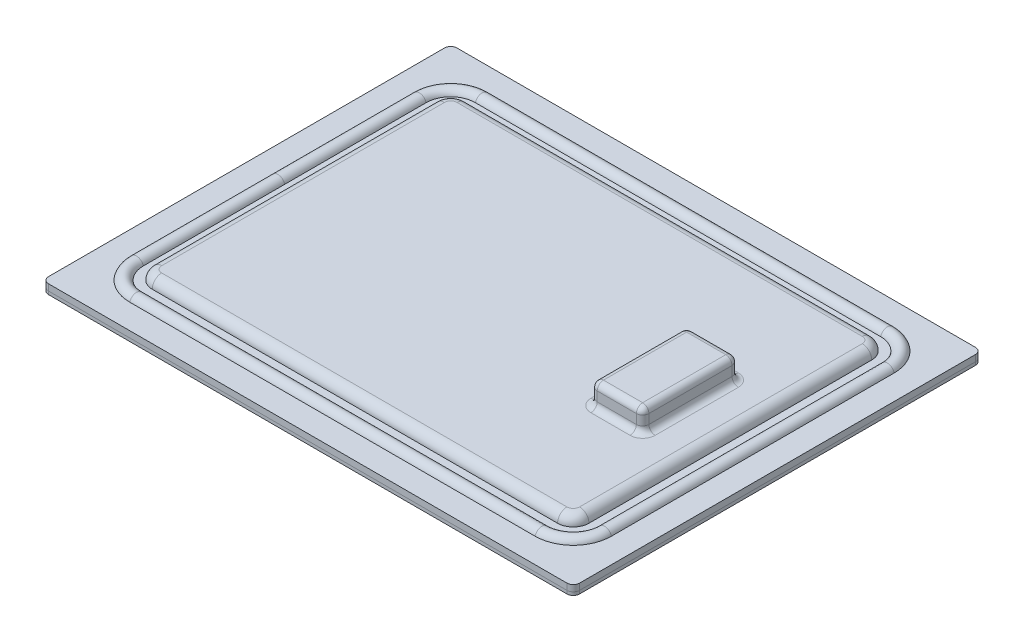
ISO-10303-21;
HEADER;
FILE_DESCRIPTION(('STEP AP214'),'2;1');
FILE_NAME('part.step','',(''),(''),'','','');
FILE_SCHEMA(('AUTOMOTIVE_DESIGN { 1 0 10303 214 1 1 1 1 }'));
ENDSEC;
DATA;
#1=APPLICATION_CONTEXT('core data for automotive mechanical design processes');
#2=APPLICATION_PROTOCOL_DEFINITION('international standard','automotive_design',2000,#1);
#3=PRODUCT_CONTEXT('',#1,'mechanical');
#4=PRODUCT('Part','Part','',(#3));
#5=PRODUCT_RELATED_PRODUCT_CATEGORY('part','',(#4));
#6=PRODUCT_DEFINITION_FORMATION('','',#4);
#7=PRODUCT_DEFINITION_CONTEXT('part definition',#1,'design');
#8=PRODUCT_DEFINITION('design','',#6,#7);
#9=PRODUCT_DEFINITION_SHAPE('','',#8);
#10=(LENGTH_UNIT() NAMED_UNIT(*) SI_UNIT(.MILLI.,.METRE.));
#11=(NAMED_UNIT(*) PLANE_ANGLE_UNIT() SI_UNIT($,.RADIAN.));
#12=(NAMED_UNIT(*) SI_UNIT($,.STERADIAN.) SOLID_ANGLE_UNIT());
#13=UNCERTAINTY_MEASURE_WITH_UNIT(LENGTH_MEASURE(1.E-05),#10,'distance_accuracy_value','');
#14=(GEOMETRIC_REPRESENTATION_CONTEXT(3) GLOBAL_UNCERTAINTY_ASSIGNED_CONTEXT((#13)) GLOBAL_UNIT_ASSIGNED_CONTEXT((#10,
#11,#12)) REPRESENTATION_CONTEXT('',''));
#15=CARTESIAN_POINT('',(0.,0.,0.));
#16=DIRECTION('',(0.,0.,1.));
#17=DIRECTION('',(1.,0.,0.));
#18=AXIS2_PLACEMENT_3D('',#15,#16,#17);
#19=CARTESIAN_POINT('',(-74.5000000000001,2.42702917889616,45.));
#20=DIRECTION('',(0.,0.,-1.));
#21=DIRECTION('',(-1.,0.,0.));
#22=AXIS2_PLACEMENT_3D('',#19,#20,#21);
#23=CYLINDRICAL_SURFACE('',#22,2.22596922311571);
#24=CARTESIAN_POINT('',(-74.5000000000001,2.42702917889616,45.0000000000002));
#25=DIRECTION('',(0.,0.,1.));
#26=DIRECTION('',(1.,0.,0.));
#27=AXIS2_PLACEMENT_3D('',#24,#25,#26);
#28=CIRCLE('',#27,2.22596922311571);
#29=CARTESIAN_POINT('',(-72.3490366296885,3.,45.0000000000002));
#30=VERTEX_POINT('',#29);
#31=CARTESIAN_POINT('',(-76.6509633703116,3.,45.0000000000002));
#32=VERTEX_POINT('',#31);
#33=EDGE_CURVE('E64',#30,#32,#28,.T.);
#34=ORIENTED_EDGE('',*,*,#33,.F.);
#35=DIRECTION('',(0.,0.,-1.));
#36=VECTOR('',#35,1.);
#37=CARTESIAN_POINT('',(-72.3490366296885,3.,45.));
#38=LINE('',#37,#36);
#39=CARTESIAN_POINT('',(-72.3490366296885,3.,0.));
#40=VERTEX_POINT('',#39);
#41=EDGE_CURVE('E56',#30,#40,#38,.T.);
#42=ORIENTED_EDGE('',*,*,#41,.T.);
#43=CARTESIAN_POINT('',(-74.5,2.42702917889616,0.));
#44=DIRECTION('',(0.,0.,1.));
#45=DIRECTION('',(1.,0.,0.));
#46=AXIS2_PLACEMENT_3D('',#43,#44,#45);
#47=CIRCLE('',#46,2.22596922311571);
#48=CARTESIAN_POINT('',(-76.6509633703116,3.,0.));
#49=VERTEX_POINT('',#48);
#50=EDGE_CURVE('E119',#40,#49,#47,.T.);
#51=ORIENTED_EDGE('',*,*,#50,.T.);
#52=DIRECTION('',(0.,0.,-1.));
#53=VECTOR('',#52,1.);
#54=CARTESIAN_POINT('',(-76.6509633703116,3.,45.));
#55=LINE('',#54,#53);
#56=EDGE_CURVE('E12',#32,#49,#55,.T.);
#57=ORIENTED_EDGE('',*,*,#56,.F.);
#58=EDGE_LOOP('',(#34,#42,#51,#57));
#59=FACE_BOUND('',#58,.T.);
#60=ADVANCED_FACE('F47',(#59),#23,.T.);
#61=CARTESIAN_POINT('',(-74.5,2.42702917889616,0.));
#62=DIRECTION('',(0.,0.,-1.));
#63=DIRECTION('',(-1.,0.,0.));
#64=AXIS2_PLACEMENT_3D('',#61,#62,#63);
#65=CYLINDRICAL_SURFACE('',#64,2.22596922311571);
#66=DIRECTION('',(0.,0.,-1.));
#67=VECTOR('',#66,1.);
#68=CARTESIAN_POINT('',(-76.6509633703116,3.,0.));
#69=LINE('',#68,#67);
#70=CARTESIAN_POINT('',(-76.6509633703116,3.,-45.));
#71=VERTEX_POINT('',#70);
#72=EDGE_CURVE('E125',#49,#71,#69,.T.);
#73=ORIENTED_EDGE('',*,*,#72,.F.);
#74=ORIENTED_EDGE('',*,*,#50,.F.);
#75=DIRECTION('',(0.,0.,-1.));
#76=VECTOR('',#75,1.);
#77=CARTESIAN_POINT('',(-72.3490366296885,3.,0.));
#78=LINE('',#77,#76);
#79=CARTESIAN_POINT('',(-72.3490366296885,3.,-45.));
#80=VERTEX_POINT('',#79);
#81=EDGE_CURVE('E123',#40,#80,#78,.T.);
#82=ORIENTED_EDGE('',*,*,#81,.T.);
#83=CARTESIAN_POINT('',(-74.5,2.42702917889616,-45.));
#84=DIRECTION('',(0.,0.,1.));
#85=DIRECTION('',(1.,0.,0.));
#86=AXIS2_PLACEMENT_3D('',#83,#84,#85);
#87=CIRCLE('',#86,2.22596922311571);
#88=EDGE_CURVE('E136',#80,#71,#87,.T.);
#89=ORIENTED_EDGE('',*,*,#88,.T.);
#90=EDGE_LOOP('',(#73,#74,#82,#89));
#91=FACE_BOUND('',#90,.T.);
#92=ADVANCED_FACE('F121',(#91),#65,.T.);
#93=CARTESIAN_POINT('',(-72.3490366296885,3.,0.));
#94=DIRECTION('',(0.,1.,0.));
#95=DIRECTION('',(-1.,0.,0.));
#96=AXIS2_PLACEMENT_3D('',#93,#94,#95);
#97=PLANE('',#96);
#98=DIRECTION('',(1.,0.,0.));
#99=VECTOR('',#98,1.);
#100=CARTESIAN_POINT('',(-72.3490366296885,3.,-45.));
#101=LINE('',#100,#99);
#102=EDGE_CURVE('E134',#71,#80,#101,.T.);
#103=ORIENTED_EDGE('',*,*,#102,.T.);
#104=ORIENTED_EDGE('',*,*,#81,.F.);
#105=DIRECTION('',(1.,0.,0.));
#106=VECTOR('',#105,1.);
#107=CARTESIAN_POINT('',(-72.3490366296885,3.,0.));
#108=LINE('',#107,#106);
#109=EDGE_CURVE('E127',#49,#40,#108,.T.);
#110=ORIENTED_EDGE('',*,*,#109,.F.);
#111=ORIENTED_EDGE('',*,*,#72,.T.);
#112=EDGE_LOOP('',(#103,#104,#110,#111));
#113=FACE_BOUND('',#112,.T.);
#114=ADVANCED_FACE('F131',(#113),#97,.F.);
#115=CARTESIAN_POINT('',(-64.5,2.42702917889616,-45.));
#116=DIRECTION('',(0.,-1.,0.));
#117=DIRECTION('',(0.,0.,-1.));
#118=AXIS2_PLACEMENT_3D('',#115,#116,#117);
#119=TOROIDAL_SURFACE('',#118,10.,2.22596922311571);
#120=CARTESIAN_POINT('',(-64.5,3.,-45.));
#121=DIRECTION('',(0.,-1.,0.));
#122=DIRECTION('',(-1.,0.,0.));
#123=AXIS2_PLACEMENT_3D('',#120,#121,#122);
#124=CIRCLE('',#123,12.1509633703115);
#125=CARTESIAN_POINT('',(-64.5000000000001,3.,-57.1509633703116));
#126=VERTEX_POINT('',#125);
#127=EDGE_CURVE('E150',#71,#126,#124,.T.);
#128=ORIENTED_EDGE('',*,*,#127,.F.);
#129=ORIENTED_EDGE('',*,*,#88,.F.);
#130=CARTESIAN_POINT('',(-64.5,3.,-45.));
#131=DIRECTION('',(0.,-1.,0.));
#132=DIRECTION('',(-1.,0.,0.));
#133=AXIS2_PLACEMENT_3D('',#130,#131,#132);
#134=CIRCLE('',#133,7.84903662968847);
#135=CARTESIAN_POINT('',(-64.5000000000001,3.,-52.8490366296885));
#136=VERTEX_POINT('',#135);
#137=EDGE_CURVE('E145',#80,#136,#134,.T.);
#138=ORIENTED_EDGE('',*,*,#137,.T.);
#139=CARTESIAN_POINT('',(-64.5000000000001,2.42702917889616,-55.));
#140=DIRECTION('',(-1.,0.,0.));
#141=DIRECTION('',(0.,0.,1.));
#142=AXIS2_PLACEMENT_3D('',#139,#140,#141);
#143=CIRCLE('',#142,2.22596922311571);
#144=EDGE_CURVE('E228',#136,#126,#143,.T.);
#145=ORIENTED_EDGE('',*,*,#144,.T.);
#146=EDGE_LOOP('',(#128,#129,#138,#145));
#147=FACE_BOUND('',#146,.T.);
#148=ADVANCED_FACE('F235',(#147),#119,.T.);
#149=CARTESIAN_POINT('',(-72.3490366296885,3.,-45.));
#150=DIRECTION('',(0.,1.,0.));
#151=DIRECTION('',(0.,0.,1.));
#152=AXIS2_PLACEMENT_3D('',#149,#150,#151);
#153=PLANE('',#152);
#154=DIRECTION('',(0.,0.,1.));
#155=VECTOR('',#154,1.);
#156=CARTESIAN_POINT('',(-64.5000000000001,3.,-52.8490366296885));
#157=LINE('',#156,#155);
#158=EDGE_CURVE('E146',#126,#136,#157,.T.);
#159=ORIENTED_EDGE('',*,*,#158,.T.);
#160=ORIENTED_EDGE('',*,*,#137,.F.);
#161=ORIENTED_EDGE('',*,*,#102,.F.);
#162=ORIENTED_EDGE('',*,*,#127,.T.);
#163=EDGE_LOOP('',(#159,#160,#161,#162));
#164=FACE_BOUND('',#163,.T.);
#165=ADVANCED_FACE('F239',(#164),#153,.F.);
#166=CARTESIAN_POINT('',(-64.5000000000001,2.42702917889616,-55.));
#167=DIRECTION('',(1.,0.,0.));
#168=DIRECTION('',(0.,0.,-1.));
#169=AXIS2_PLACEMENT_3D('',#166,#167,#168);
#170=CYLINDRICAL_SURFACE('',#169,2.22596922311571);
#171=DIRECTION('',(1.,0.,0.));
#172=VECTOR('',#171,1.);
#173=CARTESIAN_POINT('',(-64.5000000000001,3.,-57.1509633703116));
#174=LINE('',#173,#172);
#175=CARTESIAN_POINT('',(64.5,3.,-57.1509633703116));
#176=VERTEX_POINT('',#175);
#177=EDGE_CURVE('E155',#126,#176,#174,.T.);
#178=ORIENTED_EDGE('',*,*,#177,.F.);
#179=ORIENTED_EDGE('',*,*,#144,.F.);
#180=DIRECTION('',(1.,0.,0.));
#181=VECTOR('',#180,1.);
#182=CARTESIAN_POINT('',(-64.5000000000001,3.,-52.8490366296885));
#183=LINE('',#182,#181);
#184=CARTESIAN_POINT('',(64.5,3.,-52.8490366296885));
#185=VERTEX_POINT('',#184);
#186=EDGE_CURVE('E149',#136,#185,#183,.T.);
#187=ORIENTED_EDGE('',*,*,#186,.T.);
#188=CARTESIAN_POINT('',(64.5,2.42702917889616,-55.));
#189=DIRECTION('',(-1.,0.,0.));
#190=DIRECTION('',(0.,0.,1.));
#191=AXIS2_PLACEMENT_3D('',#188,#189,#190);
#192=CIRCLE('',#191,2.22596922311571);
#193=EDGE_CURVE('E223',#185,#176,#192,.T.);
#194=ORIENTED_EDGE('',*,*,#193,.T.);
#195=EDGE_LOOP('',(#178,#179,#187,#194));
#196=FACE_BOUND('',#195,.T.);
#197=ADVANCED_FACE('F243',(#196),#170,.T.);
#198=CARTESIAN_POINT('',(-64.5000000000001,3.,-52.8490366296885));
#199=DIRECTION('',(0.,1.,0.));
#200=DIRECTION('',(0.,0.,1.));
#201=AXIS2_PLACEMENT_3D('',#198,#199,#200);
#202=PLANE('',#201);
#203=DIRECTION('',(0.,0.,1.));
#204=VECTOR('',#203,1.);
#205=CARTESIAN_POINT('',(64.5,3.,-52.8490366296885));
#206=LINE('',#205,#204);
#207=EDGE_CURVE('E151',#176,#185,#206,.T.);
#208=ORIENTED_EDGE('',*,*,#207,.T.);
#209=ORIENTED_EDGE('',*,*,#186,.F.);
#210=ORIENTED_EDGE('',*,*,#158,.F.);
#211=ORIENTED_EDGE('',*,*,#177,.T.);
#212=EDGE_LOOP('',(#208,#209,#210,#211));
#213=FACE_BOUND('',#212,.T.);
#214=ADVANCED_FACE('F247',(#213),#202,.F.);
#215=CARTESIAN_POINT('',(64.5,2.42702917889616,-45.));
#216=DIRECTION('',(0.,-1.,0.));
#217=DIRECTION('',(0.,0.,-1.));
#218=AXIS2_PLACEMENT_3D('',#215,#216,#217);
#219=TOROIDAL_SURFACE('',#218,10.,2.22596922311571);
#220=CARTESIAN_POINT('',(64.5,3.,-45.));
#221=DIRECTION('',(0.,-1.,0.));
#222=DIRECTION('',(0.,0.,-1.));
#223=AXIS2_PLACEMENT_3D('',#220,#221,#222);
#224=CIRCLE('',#223,12.1509633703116);
#225=CARTESIAN_POINT('',(76.6509633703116,3.,-45.));
#226=VERTEX_POINT('',#225);
#227=EDGE_CURVE('E160',#176,#226,#224,.T.);
#228=ORIENTED_EDGE('',*,*,#227,.F.);
#229=ORIENTED_EDGE('',*,*,#193,.F.);
#230=CARTESIAN_POINT('',(64.5,3.,-45.));
#231=DIRECTION('',(0.,-1.,0.));
#232=DIRECTION('',(0.,0.,-1.));
#233=AXIS2_PLACEMENT_3D('',#230,#231,#232);
#234=CIRCLE('',#233,7.84903662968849);
#235=CARTESIAN_POINT('',(72.3490366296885,3.,-45.));
#236=VERTEX_POINT('',#235);
#237=EDGE_CURVE('E154',#185,#236,#234,.T.);
#238=ORIENTED_EDGE('',*,*,#237,.T.);
#239=CARTESIAN_POINT('',(74.5,2.42702917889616,-45.));
#240=DIRECTION('',(0.,0.,-1.));
#241=DIRECTION('',(-1.,0.,0.));
#242=AXIS2_PLACEMENT_3D('',#239,#240,#241);
#243=CIRCLE('',#242,2.22596922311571);
#244=EDGE_CURVE('E218',#236,#226,#243,.T.);
#245=ORIENTED_EDGE('',*,*,#244,.T.);
#246=EDGE_LOOP('',(#228,#229,#238,#245));
#247=FACE_BOUND('',#246,.T.);
#248=ADVANCED_FACE('F256',(#247),#219,.T.);
#249=CARTESIAN_POINT('',(64.5,3.,-52.8490366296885));
#250=DIRECTION('',(0.,1.,0.));
#251=DIRECTION('',(0.,0.,1.));
#252=AXIS2_PLACEMENT_3D('',#249,#250,#251);
#253=PLANE('',#252);
#254=DIRECTION('',(-1.,0.,0.));
#255=VECTOR('',#254,1.);
#256=CARTESIAN_POINT('',(72.3490366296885,3.,-45.));
#257=LINE('',#256,#255);
#258=EDGE_CURVE('E156',#226,#236,#257,.T.);
#259=ORIENTED_EDGE('',*,*,#258,.T.);
#260=ORIENTED_EDGE('',*,*,#237,.F.);
#261=ORIENTED_EDGE('',*,*,#207,.F.);
#262=ORIENTED_EDGE('',*,*,#227,.T.);
#263=EDGE_LOOP('',(#259,#260,#261,#262));
#264=FACE_BOUND('',#263,.T.);
#265=ADVANCED_FACE('F251',(#264),#253,.F.);
#266=CARTESIAN_POINT('',(74.5000000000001,2.42702917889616,-45.));
#267=DIRECTION('',(0.,0.,1.));
#268=DIRECTION('',(1.,0.,0.));
#269=AXIS2_PLACEMENT_3D('',#266,#267,#268);
#270=CYLINDRICAL_SURFACE('',#269,2.22596922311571);
#271=DIRECTION('',(0.,0.,1.));
#272=VECTOR('',#271,1.);
#273=CARTESIAN_POINT('',(76.6509633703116,3.,-45.));
#274=LINE('',#273,#272);
#275=CARTESIAN_POINT('',(76.6509633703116,3.,44.9999999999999));
#276=VERTEX_POINT('',#275);
#277=EDGE_CURVE('E213',#226,#276,#274,.T.);
#278=ORIENTED_EDGE('',*,*,#277,.F.);
#279=ORIENTED_EDGE('',*,*,#244,.F.);
#280=DIRECTION('',(0.,0.,1.));
#281=VECTOR('',#280,1.);
#282=CARTESIAN_POINT('',(72.3490366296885,3.,-45.));
#283=LINE('',#282,#281);
#284=CARTESIAN_POINT('',(72.3490366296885,3.,44.9999999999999));
#285=VERTEX_POINT('',#284);
#286=EDGE_CURVE('E159',#236,#285,#283,.T.);
#287=ORIENTED_EDGE('',*,*,#286,.T.);
#288=CARTESIAN_POINT('',(74.5,2.42702917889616,45.));
#289=DIRECTION('',(0.,0.,-1.));
#290=DIRECTION('',(-1.,0.,0.));
#291=AXIS2_PLACEMENT_3D('',#288,#289,#290);
#292=CIRCLE('',#291,2.22596922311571);
#293=EDGE_CURVE('E165',#285,#276,#292,.T.);
#294=ORIENTED_EDGE('',*,*,#293,.T.);
#295=EDGE_LOOP('',(#278,#279,#287,#294));
#296=FACE_BOUND('',#295,.T.);
#297=ADVANCED_FACE('F259',(#296),#270,.T.);
#298=CARTESIAN_POINT('',(72.3490366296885,3.,-45.));
#299=DIRECTION('',(0.,1.,0.));
#300=DIRECTION('',(-1.,0.,0.));
#301=AXIS2_PLACEMENT_3D('',#298,#299,#300);
#302=PLANE('',#301);
#303=DIRECTION('',(-1.,0.,0.));
#304=VECTOR('',#303,1.);
#305=CARTESIAN_POINT('',(72.3490366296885,3.,45.));
#306=LINE('',#305,#304);
#307=EDGE_CURVE('E161',#276,#285,#306,.T.);
#308=ORIENTED_EDGE('',*,*,#307,.T.);
#309=ORIENTED_EDGE('',*,*,#286,.F.);
#310=ORIENTED_EDGE('',*,*,#258,.F.);
#311=ORIENTED_EDGE('',*,*,#277,.T.);
#312=EDGE_LOOP('',(#308,#309,#310,#311));
#313=FACE_BOUND('',#312,.T.);
#314=ADVANCED_FACE('F261',(#313),#302,.F.);
#315=CARTESIAN_POINT('',(64.5,2.42702917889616,45.));
#316=DIRECTION('',(0.,-1.,0.));
#317=DIRECTION('',(0.,0.,-1.));
#318=AXIS2_PLACEMENT_3D('',#315,#316,#317);
#319=TOROIDAL_SURFACE('',#318,10.,2.22596922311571);
#320=CARTESIAN_POINT('',(64.5,3.,45.));
#321=DIRECTION('',(0.,-1.,0.));
#322=DIRECTION('',(1.,0.,0.));
#323=AXIS2_PLACEMENT_3D('',#320,#321,#322);
#324=CIRCLE('',#323,12.1509633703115);
#325=CARTESIAN_POINT('',(64.5000000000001,3.,57.1509633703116));
#326=VERTEX_POINT('',#325);
#327=EDGE_CURVE('E169',#276,#326,#324,.T.);
#328=ORIENTED_EDGE('',*,*,#327,.F.);
#329=ORIENTED_EDGE('',*,*,#293,.F.);
#330=CARTESIAN_POINT('',(64.5,3.,45.));
#331=DIRECTION('',(0.,-1.,0.));
#332=DIRECTION('',(1.,0.,0.));
#333=AXIS2_PLACEMENT_3D('',#330,#331,#332);
#334=CIRCLE('',#333,7.84903662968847);
#335=CARTESIAN_POINT('',(64.5000000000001,3.,52.8490366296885));
#336=VERTEX_POINT('',#335);
#337=EDGE_CURVE('E164',#285,#336,#334,.T.);
#338=ORIENTED_EDGE('',*,*,#337,.T.);
#339=CARTESIAN_POINT('',(64.5000000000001,2.42702917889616,55.));
#340=DIRECTION('',(1.,0.,0.));
#341=DIRECTION('',(0.,0.,-1.));
#342=AXIS2_PLACEMENT_3D('',#339,#340,#341);
#343=CIRCLE('',#342,2.22596922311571);
#344=EDGE_CURVE('E199',#336,#326,#343,.T.);
#345=ORIENTED_EDGE('',*,*,#344,.T.);
#346=EDGE_LOOP('',(#328,#329,#338,#345));
#347=FACE_BOUND('',#346,.T.);
#348=ADVANCED_FACE('F209',(#347),#319,.T.);
#349=CARTESIAN_POINT('',(72.3490366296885,3.,45.));
#350=DIRECTION('',(0.,1.,0.));
#351=DIRECTION('',(0.,0.,1.));
#352=AXIS2_PLACEMENT_3D('',#349,#350,#351);
#353=PLANE('',#352);
#354=DIRECTION('',(0.,0.,-1.));
#355=VECTOR('',#354,1.);
#356=CARTESIAN_POINT('',(64.5000000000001,3.,52.8490366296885));
#357=LINE('',#356,#355);
#358=EDGE_CURVE('E166',#326,#336,#357,.T.);
#359=ORIENTED_EDGE('',*,*,#358,.T.);
#360=ORIENTED_EDGE('',*,*,#337,.F.);
#361=ORIENTED_EDGE('',*,*,#307,.F.);
#362=ORIENTED_EDGE('',*,*,#327,.T.);
#363=EDGE_LOOP('',(#359,#360,#361,#362));
#364=FACE_BOUND('',#363,.T.);
#365=ADVANCED_FACE('F203',(#364),#353,.F.);
#366=CARTESIAN_POINT('',(64.5000000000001,2.42702917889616,55.));
#367=DIRECTION('',(-1.,0.,0.));
#368=DIRECTION('',(0.,0.,1.));
#369=AXIS2_PLACEMENT_3D('',#366,#367,#368);
#370=CYLINDRICAL_SURFACE('',#369,2.22596922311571);
#371=DIRECTION('',(-1.,0.,0.));
#372=VECTOR('',#371,1.);
#373=CARTESIAN_POINT('',(64.5000000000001,3.,57.1509633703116));
#374=LINE('',#373,#372);
#375=CARTESIAN_POINT('',(-64.5,3.,57.1509633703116));
#376=VERTEX_POINT('',#375);
#377=EDGE_CURVE('E173',#326,#376,#374,.T.);
#378=ORIENTED_EDGE('',*,*,#377,.F.);
#379=ORIENTED_EDGE('',*,*,#344,.F.);
#380=DIRECTION('',(-1.,0.,0.));
#381=VECTOR('',#380,1.);
#382=CARTESIAN_POINT('',(64.5000000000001,3.,52.8490366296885));
#383=LINE('',#382,#381);
#384=CARTESIAN_POINT('',(-64.5,3.,52.8490366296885));
#385=VERTEX_POINT('',#384);
#386=EDGE_CURVE('E168',#336,#385,#383,.T.);
#387=ORIENTED_EDGE('',*,*,#386,.T.);
#388=CARTESIAN_POINT('',(-64.5,2.42702917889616,55.));
#389=DIRECTION('',(1.,0.,0.));
#390=DIRECTION('',(0.,0.,-1.));
#391=AXIS2_PLACEMENT_3D('',#388,#389,#390);
#392=CIRCLE('',#391,2.22596922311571);
#393=EDGE_CURVE('E179',#385,#376,#392,.T.);
#394=ORIENTED_EDGE('',*,*,#393,.T.);
#395=EDGE_LOOP('',(#378,#379,#387,#394));
#396=FACE_BOUND('',#395,.T.);
#397=ADVANCED_FACE('F196',(#396),#370,.T.);
#398=CARTESIAN_POINT('',(64.5000000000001,3.,52.8490366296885));
#399=DIRECTION('',(0.,1.,0.));
#400=DIRECTION('',(0.,0.,1.));
#401=AXIS2_PLACEMENT_3D('',#398,#399,#400);
#402=PLANE('',#401);
#403=DIRECTION('',(0.,0.,-1.));
#404=VECTOR('',#403,1.);
#405=CARTESIAN_POINT('',(-64.5,3.,52.8490366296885));
#406=LINE('',#405,#404);
#407=EDGE_CURVE('E170',#376,#385,#406,.T.);
#408=ORIENTED_EDGE('',*,*,#407,.T.);
#409=ORIENTED_EDGE('',*,*,#386,.F.);
#410=ORIENTED_EDGE('',*,*,#358,.F.);
#411=ORIENTED_EDGE('',*,*,#377,.T.);
#412=EDGE_LOOP('',(#408,#409,#410,#411));
#413=FACE_BOUND('',#412,.T.);
#414=ADVANCED_FACE('F200',(#413),#402,.F.);
#415=CARTESIAN_POINT('',(-64.5,2.42702917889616,45.));
#416=DIRECTION('',(0.,-1.,0.));
#417=DIRECTION('',(0.,0.,-1.));
#418=AXIS2_PLACEMENT_3D('',#415,#416,#417);
#419=TOROIDAL_SURFACE('',#418,10.,2.22596922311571);
#420=CARTESIAN_POINT('',(-64.5,3.,45.));
#421=DIRECTION('',(0.,-1.,0.));
#422=DIRECTION('',(0.,0.,1.));
#423=AXIS2_PLACEMENT_3D('',#420,#421,#422);
#424=CIRCLE('',#423,12.1509633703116);
#425=EDGE_CURVE('E189',#376,#32,#424,.T.);
#426=ORIENTED_EDGE('',*,*,#425,.F.);
#427=ORIENTED_EDGE('',*,*,#393,.F.);
#428=CARTESIAN_POINT('',(-64.5,3.,45.));
#429=DIRECTION('',(0.,-1.,0.));
#430=DIRECTION('',(0.,0.,1.));
#431=AXIS2_PLACEMENT_3D('',#428,#429,#430);
#432=CIRCLE('',#431,7.84903662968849);
#433=EDGE_CURVE('E172',#385,#30,#432,.T.);
#434=ORIENTED_EDGE('',*,*,#433,.T.);
#435=ORIENTED_EDGE('',*,*,#33,.T.);
#436=EDGE_LOOP('',(#426,#427,#434,#435));
#437=FACE_BOUND('',#436,.T.);
#438=ADVANCED_FACE('F194',(#437),#419,.T.);
#439=CARTESIAN_POINT('',(-64.5,3.,52.8490366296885));
#440=DIRECTION('',(0.,1.,0.));
#441=DIRECTION('',(0.,0.,1.));
#442=AXIS2_PLACEMENT_3D('',#439,#440,#441);
#443=PLANE('',#442);
#444=DIRECTION('',(1.,0.,0.));
#445=VECTOR('',#444,1.);
#446=CARTESIAN_POINT('',(-72.3490366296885,3.,45.0000000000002));
#447=LINE('',#446,#445);
#448=EDGE_CURVE('E51',#32,#30,#447,.T.);
#449=ORIENTED_EDGE('',*,*,#448,.T.);
#450=ORIENTED_EDGE('',*,*,#433,.F.);
#451=ORIENTED_EDGE('',*,*,#407,.F.);
#452=ORIENTED_EDGE('',*,*,#425,.T.);
#453=EDGE_LOOP('',(#449,#450,#451,#452));
#454=FACE_BOUND('',#453,.T.);
#455=ADVANCED_FACE('F192',(#454),#443,.F.);
#456=CARTESIAN_POINT('',(-72.3490366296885,3.,45.));
#457=DIRECTION('',(0.,1.,0.));
#458=DIRECTION('',(-1.,0.,0.));
#459=AXIS2_PLACEMENT_3D('',#456,#457,#458);
#460=PLANE('',#459);
#461=ORIENTED_EDGE('',*,*,#56,.T.);
#462=ORIENTED_EDGE('',*,*,#109,.T.);
#463=ORIENTED_EDGE('',*,*,#41,.F.);
#464=ORIENTED_EDGE('',*,*,#448,.F.);
#465=EDGE_LOOP('',(#461,#462,#463,#464));
#466=FACE_BOUND('',#465,.T.);
#467=ADVANCED_FACE('F49',(#466),#460,.F.);
#468=CLOSED_SHELL('',(#60,#92,#114,#148,#165,#197,#214,#248,#265,#297,#314,#348,#365,#397,#414,
#438,#455,#467));
#469=MANIFOLD_SOLID_BREP('B2',#468);
#470=CARTESIAN_POINT('',(0.,3.,0.));
#471=DIRECTION('',(0.,1.,0.));
#472=DIRECTION('',(0.,0.,1.));
#473=AXIS2_PLACEMENT_3D('',#470,#471,#472);
#474=PLANE('',#473);
#475=DIRECTION('',(0.,0.,-1.));
#476=VECTOR('',#475,1.);
#477=CARTESIAN_POINT('',(84.5,3.,-65.));
#478=LINE('',#477,#476);
#479=CARTESIAN_POINT('',(84.5,3.,63.));
#480=VERTEX_POINT('',#479);
#481=CARTESIAN_POINT('',(84.5,3.,-63.));
#482=VERTEX_POINT('',#481);
#483=EDGE_CURVE('E607',#480,#482,#478,.T.);
#484=ORIENTED_EDGE('',*,*,#483,.T.);
#485=CARTESIAN_POINT('',(82.5,3.,-63.));
#486=DIRECTION('',(0.,1.,0.));
#487=DIRECTION('',(0.,0.,1.));
#488=AXIS2_PLACEMENT_3D('',#485,#486,#487);
#489=CIRCLE('',#488,2.);
#490=CARTESIAN_POINT('',(82.5,3.,-65.));
#491=VERTEX_POINT('',#490);
#492=EDGE_CURVE('E645',#482,#491,#489,.T.);
#493=ORIENTED_EDGE('',*,*,#492,.T.);
#494=DIRECTION('',(-1.,0.,0.));
#495=VECTOR('',#494,1.);
#496=CARTESIAN_POINT('',(-84.5,3.,-65.));
#497=LINE('',#496,#495);
#498=CARTESIAN_POINT('',(-82.5,3.,-65.));
#499=VERTEX_POINT('',#498);
#500=EDGE_CURVE('E610',#491,#499,#497,.T.);
#501=ORIENTED_EDGE('',*,*,#500,.T.);
#502=CARTESIAN_POINT('',(-82.5,3.,-63.));
#503=DIRECTION('',(0.,1.,0.));
#504=DIRECTION('',(0.,0.,1.));
#505=AXIS2_PLACEMENT_3D('',#502,#503,#504);
#506=CIRCLE('',#505,2.);
#507=CARTESIAN_POINT('',(-84.5,3.,-63.));
#508=VERTEX_POINT('',#507);
#509=EDGE_CURVE('E641',#499,#508,#506,.T.);
#510=ORIENTED_EDGE('',*,*,#509,.T.);
#511=DIRECTION('',(0.,0.,1.));
#512=VECTOR('',#511,1.);
#513=CARTESIAN_POINT('',(-84.5,3.,-65.));
#514=LINE('',#513,#512);
#515=CARTESIAN_POINT('',(-84.5,3.,63.));
#516=VERTEX_POINT('',#515);
#517=EDGE_CURVE('E602',#508,#516,#514,.T.);
#518=ORIENTED_EDGE('',*,*,#517,.T.);
#519=CARTESIAN_POINT('',(-82.5,3.,63.));
#520=DIRECTION('',(0.,1.,0.));
#521=DIRECTION('',(0.,0.,1.));
#522=AXIS2_PLACEMENT_3D('',#519,#520,#521);
#523=CIRCLE('',#522,2.);
#524=CARTESIAN_POINT('',(-82.5,3.,65.));
#525=VERTEX_POINT('',#524);
#526=EDGE_CURVE('E438',#516,#525,#523,.T.);
#527=ORIENTED_EDGE('',*,*,#526,.T.);
#528=DIRECTION('',(1.,0.,0.));
#529=VECTOR('',#528,1.);
#530=CARTESIAN_POINT('',(-84.5,3.,65.));
#531=LINE('',#530,#529);
#532=CARTESIAN_POINT('',(82.5,3.,65.));
#533=VERTEX_POINT('',#532);
#534=EDGE_CURVE('E604',#525,#533,#531,.T.);
#535=ORIENTED_EDGE('',*,*,#534,.T.);
#536=CARTESIAN_POINT('',(82.5,3.,63.));
#537=DIRECTION('',(0.,1.,0.));
#538=DIRECTION('',(0.,0.,1.));
#539=AXIS2_PLACEMENT_3D('',#536,#537,#538);
#540=CIRCLE('',#539,2.);
#541=EDGE_CURVE('E643',#533,#480,#540,.T.);
#542=ORIENTED_EDGE('',*,*,#541,.T.);
#543=EDGE_LOOP('',(#484,#493,#501,#510,#518,#527,#535,#542));
#544=FACE_BOUND('',#543,.T.);
#545=DIRECTION('',(0.,0.,1.));
#546=VECTOR('',#545,1.);
#547=CARTESIAN_POINT('',(-69.5,3.,45.));
#548=LINE('',#547,#546);
#549=CARTESIAN_POINT('',(-69.5,3.,-45.));
#550=VERTEX_POINT('',#549);
#551=CARTESIAN_POINT('',(-69.5,3.,45.));
#552=VERTEX_POINT('',#551);
#553=EDGE_CURVE('E542',#550,#552,#548,.T.);
#554=ORIENTED_EDGE('',*,*,#553,.F.);
#555=CARTESIAN_POINT('',(-64.5,3.,-45.));
#556=DIRECTION('',(0.,1.,0.));
#557=DIRECTION('',(0.,0.,-1.));
#558=AXIS2_PLACEMENT_3D('',#555,#556,#557);
#559=CIRCLE('',#558,4.99999999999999);
#560=CARTESIAN_POINT('',(-64.5,3.,-50.));
#561=VERTEX_POINT('',#560);
#562=EDGE_CURVE('E532',#561,#550,#559,.T.);
#563=ORIENTED_EDGE('',*,*,#562,.F.);
#564=DIRECTION('',(-1.,0.,0.));
#565=VECTOR('',#564,1.);
#566=CARTESIAN_POINT('',(-64.5,3.,-50.));
#567=LINE('',#566,#565);
#568=CARTESIAN_POINT('',(64.5,3.,-50.));
#569=VERTEX_POINT('',#568);
#570=EDGE_CURVE('E568',#569,#561,#567,.T.);
#571=ORIENTED_EDGE('',*,*,#570,.F.);
#572=CARTESIAN_POINT('',(64.5,3.,-45.));
#573=DIRECTION('',(0.,1.,0.));
#574=DIRECTION('',(0.,0.,-1.));
#575=AXIS2_PLACEMENT_3D('',#572,#573,#574);
#576=CIRCLE('',#575,5.00000000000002);
#577=CARTESIAN_POINT('',(69.5,3.,-45.));
#578=VERTEX_POINT('',#577);
#579=EDGE_CURVE('E565',#578,#569,#576,.T.);
#580=ORIENTED_EDGE('',*,*,#579,.F.);
#581=DIRECTION('',(0.,0.,-1.));
#582=VECTOR('',#581,1.);
#583=CARTESIAN_POINT('',(69.5,3.,-45.));
#584=LINE('',#583,#582);
#585=CARTESIAN_POINT('',(69.5,3.,45.));
#586=VERTEX_POINT('',#585);
#587=EDGE_CURVE('E563',#586,#578,#584,.T.);
#588=ORIENTED_EDGE('',*,*,#587,.F.);
#589=CARTESIAN_POINT('',(64.5,3.,45.));
#590=DIRECTION('',(0.,1.,0.));
#591=DIRECTION('',(0.,0.,-1.));
#592=AXIS2_PLACEMENT_3D('',#589,#590,#591);
#593=CIRCLE('',#592,4.99999999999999);
#594=CARTESIAN_POINT('',(64.5,3.,50.));
#595=VERTEX_POINT('',#594);
#596=EDGE_CURVE('E561',#595,#586,#593,.T.);
#597=ORIENTED_EDGE('',*,*,#596,.F.);
#598=DIRECTION('',(1.,0.,0.));
#599=VECTOR('',#598,1.);
#600=CARTESIAN_POINT('',(64.5,3.,50.));
#601=LINE('',#600,#599);
#602=CARTESIAN_POINT('',(-64.5,3.,50.));
#603=VERTEX_POINT('',#602);
#604=EDGE_CURVE('E557',#603,#595,#601,.T.);
#605=ORIENTED_EDGE('',*,*,#604,.F.);
#606=CARTESIAN_POINT('',(-64.5,3.,45.));
#607=DIRECTION('',(0.,1.,0.));
#608=DIRECTION('',(0.,0.,-1.));
#609=AXIS2_PLACEMENT_3D('',#606,#607,#608);
#610=CIRCLE('',#609,5.00000000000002);
#611=EDGE_CURVE('E555',#552,#603,#610,.T.);
#612=ORIENTED_EDGE('',*,*,#611,.F.);
#613=EDGE_LOOP('',(#554,#563,#571,#580,#588,#597,#605,#612));
#614=FACE_BOUND('',#613,.T.);
#615=ADVANCED_FACE('F416',(#544,#614),#474,.T.);
#616=CARTESIAN_POINT('',(0.,1.,0.));
#617=DIRECTION('',(0.,1.,0.));
#618=DIRECTION('',(0.,0.,1.));
#619=AXIS2_PLACEMENT_3D('',#616,#617,#618);
#620=PLANE('',#619);
#621=DIRECTION('',(-1.,0.,0.));
#622=VECTOR('',#621,1.);
#623=CARTESIAN_POINT('',(-84.5,1.,-65.));
#624=LINE('',#623,#622);
#625=CARTESIAN_POINT('',(82.5,1.,-65.));
#626=VERTEX_POINT('',#625);
#627=CARTESIAN_POINT('',(-82.5,1.,-65.));
#628=VERTEX_POINT('',#627);
#629=EDGE_CURVE('E605',#626,#628,#624,.T.);
#630=ORIENTED_EDGE('',*,*,#629,.F.);
#631=CARTESIAN_POINT('',(82.5,1.,-63.));
#632=DIRECTION('',(0.,1.,0.));
#633=DIRECTION('',(0.,0.,1.));
#634=AXIS2_PLACEMENT_3D('',#631,#632,#633);
#635=CIRCLE('',#634,2.);
#636=CARTESIAN_POINT('',(84.5,1.,-63.));
#637=VERTEX_POINT('',#636);
#638=EDGE_CURVE('E633',#626,#637,#635,.F.);
#639=ORIENTED_EDGE('',*,*,#638,.T.);
#640=DIRECTION('',(0.,0.,-1.));
#641=VECTOR('',#640,1.);
#642=CARTESIAN_POINT('',(84.5,1.,-65.));
#643=LINE('',#642,#641);
#644=CARTESIAN_POINT('',(84.5,1.,63.));
#645=VERTEX_POINT('',#644);
#646=EDGE_CURVE('E618',#645,#637,#643,.T.);
#647=ORIENTED_EDGE('',*,*,#646,.F.);
#648=CARTESIAN_POINT('',(82.5,1.,63.));
#649=DIRECTION('',(0.,1.,0.));
#650=DIRECTION('',(0.,0.,1.));
#651=AXIS2_PLACEMENT_3D('',#648,#649,#650);
#652=CIRCLE('',#651,2.);
#653=CARTESIAN_POINT('',(82.5,1.,65.));
#654=VERTEX_POINT('',#653);
#655=EDGE_CURVE('E631',#645,#654,#652,.F.);
#656=ORIENTED_EDGE('',*,*,#655,.T.);
#657=DIRECTION('',(1.,0.,0.));
#658=VECTOR('',#657,1.);
#659=CARTESIAN_POINT('',(-84.5,1.,65.));
#660=LINE('',#659,#658);
#661=CARTESIAN_POINT('',(-82.5,1.,65.));
#662=VERTEX_POINT('',#661);
#663=EDGE_CURVE('E616',#662,#654,#660,.T.);
#664=ORIENTED_EDGE('',*,*,#663,.F.);
#665=CARTESIAN_POINT('',(-82.5,1.,63.));
#666=DIRECTION('',(0.,1.,0.));
#667=DIRECTION('',(0.,0.,1.));
#668=AXIS2_PLACEMENT_3D('',#665,#666,#667);
#669=CIRCLE('',#668,2.);
#670=CARTESIAN_POINT('',(-84.5,1.,63.));
#671=VERTEX_POINT('',#670);
#672=EDGE_CURVE('E627',#662,#671,#669,.F.);
#673=ORIENTED_EDGE('',*,*,#672,.T.);
#674=DIRECTION('',(0.,0.,1.));
#675=VECTOR('',#674,1.);
#676=CARTESIAN_POINT('',(-84.5,1.,-65.));
#677=LINE('',#676,#675);
#678=CARTESIAN_POINT('',(-84.5,1.,-63.));
#679=VERTEX_POINT('',#678);
#680=EDGE_CURVE('E550',#679,#671,#677,.T.);
#681=ORIENTED_EDGE('',*,*,#680,.F.);
#682=CARTESIAN_POINT('',(-82.5,1.,-63.));
#683=DIRECTION('',(0.,1.,0.));
#684=DIRECTION('',(0.,0.,1.));
#685=AXIS2_PLACEMENT_3D('',#682,#683,#684);
#686=CIRCLE('',#685,2.);
#687=EDGE_CURVE('E629',#679,#628,#686,.F.);
#688=ORIENTED_EDGE('',*,*,#687,.T.);
#689=EDGE_LOOP('',(#630,#639,#647,#656,#664,#673,#681,#688));
#690=FACE_BOUND('',#689,.T.);
#691=CARTESIAN_POINT('',(-64.5,1.,-45.));
#692=DIRECTION('',(0.,1.,0.));
#693=DIRECTION('',(0.,0.,-1.));
#694=AXIS2_PLACEMENT_3D('',#691,#692,#693);
#695=CIRCLE('',#694,4.99999999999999);
#696=CARTESIAN_POINT('',(-64.5,1.,-50.));
#697=VERTEX_POINT('',#696);
#698=CARTESIAN_POINT('',(-69.5,1.,-45.));
#699=VERTEX_POINT('',#698);
#700=EDGE_CURVE('E570',#697,#699,#695,.T.);
#701=ORIENTED_EDGE('',*,*,#700,.T.);
#702=DIRECTION('',(0.,0.,1.));
#703=VECTOR('',#702,1.);
#704=CARTESIAN_POINT('',(-69.5,1.,45.));
#705=LINE('',#704,#703);
#706=CARTESIAN_POINT('',(-69.5,1.,45.));
#707=VERTEX_POINT('',#706);
#708=EDGE_CURVE('E549',#699,#707,#705,.T.);
#709=ORIENTED_EDGE('',*,*,#708,.T.);
#710=CARTESIAN_POINT('',(-64.5,1.,45.));
#711=DIRECTION('',(0.,1.,0.));
#712=DIRECTION('',(0.,0.,-1.));
#713=AXIS2_PLACEMENT_3D('',#710,#711,#712);
#714=CIRCLE('',#713,5.00000000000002);
#715=CARTESIAN_POINT('',(-64.5,1.,50.));
#716=VERTEX_POINT('',#715);
#717=EDGE_CURVE('E573',#707,#716,#714,.T.);
#718=ORIENTED_EDGE('',*,*,#717,.T.);
#719=DIRECTION('',(1.,0.,0.));
#720=VECTOR('',#719,1.);
#721=CARTESIAN_POINT('',(64.5,1.,50.));
#722=LINE('',#721,#720);
#723=CARTESIAN_POINT('',(64.5,1.,50.));
#724=VERTEX_POINT('',#723);
#725=EDGE_CURVE('E576',#716,#724,#722,.T.);
#726=ORIENTED_EDGE('',*,*,#725,.T.);
#727=CARTESIAN_POINT('',(64.5,1.,45.));
#728=DIRECTION('',(0.,1.,0.));
#729=DIRECTION('',(0.,0.,-1.));
#730=AXIS2_PLACEMENT_3D('',#727,#728,#729);
#731=CIRCLE('',#730,4.99999999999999);
#732=CARTESIAN_POINT('',(69.5,1.,45.));
#733=VERTEX_POINT('',#732);
#734=EDGE_CURVE('E579',#724,#733,#731,.T.);
#735=ORIENTED_EDGE('',*,*,#734,.T.);
#736=DIRECTION('',(0.,0.,-1.));
#737=VECTOR('',#736,1.);
#738=CARTESIAN_POINT('',(69.5,1.,-45.));
#739=LINE('',#738,#737);
#740=CARTESIAN_POINT('',(69.5,1.,-45.));
#741=VERTEX_POINT('',#740);
#742=EDGE_CURVE('E582',#733,#741,#739,.T.);
#743=ORIENTED_EDGE('',*,*,#742,.T.);
#744=CARTESIAN_POINT('',(64.5,1.,-45.));
#745=DIRECTION('',(0.,1.,0.));
#746=DIRECTION('',(0.,0.,-1.));
#747=AXIS2_PLACEMENT_3D('',#744,#745,#746);
#748=CIRCLE('',#747,5.00000000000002);
#749=CARTESIAN_POINT('',(64.5,1.,-50.));
#750=VERTEX_POINT('',#749);
#751=EDGE_CURVE('E585',#741,#750,#748,.T.);
#752=ORIENTED_EDGE('',*,*,#751,.T.);
#753=DIRECTION('',(-1.,0.,0.));
#754=VECTOR('',#753,1.);
#755=CARTESIAN_POINT('',(-64.5,1.,-50.));
#756=LINE('',#755,#754);
#757=EDGE_CURVE('E543',#750,#697,#756,.T.);
#758=ORIENTED_EDGE('',*,*,#757,.T.);
#759=EDGE_LOOP('',(#701,#709,#718,#726,#735,#743,#752,#758));
#760=FACE_BOUND('',#759,.T.);
#761=ADVANCED_FACE('F663',(#690,#760),#620,.F.);
#762=CARTESIAN_POINT('',(-84.5,3.,-65.));
#763=DIRECTION('',(1.,0.,0.));
#764=DIRECTION('',(0.,0.,-1.));
#765=AXIS2_PLACEMENT_3D('',#762,#763,#764);
#766=PLANE('',#765);
#767=ORIENTED_EDGE('',*,*,#517,.F.);
#768=DIRECTION('',(0.,-1.,0.));
#769=VECTOR('',#768,1.);
#770=CARTESIAN_POINT('',(-84.5,3.,-63.));
#771=LINE('',#770,#769);
#772=EDGE_CURVE('E45',#508,#679,#771,.T.);
#773=ORIENTED_EDGE('',*,*,#772,.T.);
#774=ORIENTED_EDGE('',*,*,#680,.T.);
#775=DIRECTION('',(0.,-1.,0.));
#776=VECTOR('',#775,1.);
#777=CARTESIAN_POINT('',(-84.5,3.,63.));
#778=LINE('',#777,#776);
#779=EDGE_CURVE('E424',#671,#516,#778,.F.);
#780=ORIENTED_EDGE('',*,*,#779,.T.);
#781=EDGE_LOOP('',(#767,#773,#774,#780));
#782=FACE_BOUND('',#781,.T.);
#783=ADVANCED_FACE('F653',(#782),#766,.F.);
#784=CARTESIAN_POINT('',(-84.5,3.,65.));
#785=DIRECTION('',(0.,0.,-1.));
#786=DIRECTION('',(-1.,0.,0.));
#787=AXIS2_PLACEMENT_3D('',#784,#785,#786);
#788=PLANE('',#787);
#789=ORIENTED_EDGE('',*,*,#663,.T.);
#790=DIRECTION('',(0.,-1.,0.));
#791=VECTOR('',#790,1.);
#792=CARTESIAN_POINT('',(82.5,3.,65.));
#793=LINE('',#792,#791);
#794=EDGE_CURVE('E431',#654,#533,#793,.F.);
#795=ORIENTED_EDGE('',*,*,#794,.T.);
#796=ORIENTED_EDGE('',*,*,#534,.F.);
#797=DIRECTION('',(0.,-1.,0.));
#798=VECTOR('',#797,1.);
#799=CARTESIAN_POINT('',(-82.5,3.,65.));
#800=LINE('',#799,#798);
#801=EDGE_CURVE('E647',#525,#662,#800,.T.);
#802=ORIENTED_EDGE('',*,*,#801,.T.);
#803=EDGE_LOOP('',(#789,#795,#796,#802));
#804=FACE_BOUND('',#803,.T.);
#805=ADVANCED_FACE('F660',(#804),#788,.F.);
#806=CARTESIAN_POINT('',(84.5,3.,-65.));
#807=DIRECTION('',(-1.,0.,0.));
#808=DIRECTION('',(0.,0.,1.));
#809=AXIS2_PLACEMENT_3D('',#806,#807,#808);
#810=PLANE('',#809);
#811=ORIENTED_EDGE('',*,*,#646,.T.);
#812=DIRECTION('',(0.,-1.,0.));
#813=VECTOR('',#812,1.);
#814=CARTESIAN_POINT('',(84.5,3.,-63.));
#815=LINE('',#814,#813);
#816=EDGE_CURVE('E638',#637,#482,#815,.F.);
#817=ORIENTED_EDGE('',*,*,#816,.T.);
#818=ORIENTED_EDGE('',*,*,#483,.F.);
#819=DIRECTION('',(0.,-1.,0.));
#820=VECTOR('',#819,1.);
#821=CARTESIAN_POINT('',(84.5,3.,63.));
#822=LINE('',#821,#820);
#823=EDGE_CURVE('E635',#480,#645,#822,.T.);
#824=ORIENTED_EDGE('',*,*,#823,.T.);
#825=EDGE_LOOP('',(#811,#817,#818,#824));
#826=FACE_BOUND('',#825,.T.);
#827=ADVANCED_FACE('F672',(#826),#810,.F.);
#828=CARTESIAN_POINT('',(-84.5,3.,-65.));
#829=DIRECTION('',(0.,0.,1.));
#830=DIRECTION('',(1.,0.,0.));
#831=AXIS2_PLACEMENT_3D('',#828,#829,#830);
#832=PLANE('',#831);
#833=ORIENTED_EDGE('',*,*,#500,.F.);
#834=DIRECTION('',(0.,-1.,0.));
#835=VECTOR('',#834,1.);
#836=CARTESIAN_POINT('',(82.5,3.,-65.));
#837=LINE('',#836,#835);
#838=EDGE_CURVE('E624',#491,#626,#837,.T.);
#839=ORIENTED_EDGE('',*,*,#838,.T.);
#840=ORIENTED_EDGE('',*,*,#629,.T.);
#841=DIRECTION('',(0.,-1.,0.));
#842=VECTOR('',#841,1.);
#843=CARTESIAN_POINT('',(-82.5,3.,-65.));
#844=LINE('',#843,#842);
#845=EDGE_CURVE('E613',#628,#499,#844,.F.);
#846=ORIENTED_EDGE('',*,*,#845,.T.);
#847=EDGE_LOOP('',(#833,#839,#840,#846));
#848=FACE_BOUND('',#847,.T.);
#849=ADVANCED_FACE('F680',(#848),#832,.F.);
#850=CARTESIAN_POINT('',(-64.5,3.,-45.));
#851=DIRECTION('',(0.,-1.,0.));
#852=DIRECTION('',(0.,0.,-1.));
#853=AXIS2_PLACEMENT_3D('',#850,#851,#852);
#854=CYLINDRICAL_SURFACE('',#853,4.99999999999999);
#855=ORIENTED_EDGE('',*,*,#700,.F.);
#856=DIRECTION('',(0.,-1.,0.));
#857=VECTOR('',#856,1.);
#858=CARTESIAN_POINT('',(-64.5,3.,-50.));
#859=LINE('',#858,#857);
#860=EDGE_CURVE('E538',#561,#697,#859,.T.);
#861=ORIENTED_EDGE('',*,*,#860,.F.);
#862=ORIENTED_EDGE('',*,*,#562,.T.);
#863=DIRECTION('',(0.,-1.,0.));
#864=VECTOR('',#863,1.);
#865=CARTESIAN_POINT('',(-69.5,3.,-45.));
#866=LINE('',#865,#864);
#867=EDGE_CURVE('E535',#550,#699,#866,.T.);
#868=ORIENTED_EDGE('',*,*,#867,.T.);
#869=EDGE_LOOP('',(#855,#861,#862,#868));
#870=FACE_BOUND('',#869,.T.);
#871=ADVANCED_FACE('F534',(#870),#854,.F.);
#872=CARTESIAN_POINT('',(-69.5,3.,45.));
#873=DIRECTION('',(1.,0.,0.));
#874=DIRECTION('',(0.,0.,-1.));
#875=AXIS2_PLACEMENT_3D('',#872,#873,#874);
#876=PLANE('',#875);
#877=ORIENTED_EDGE('',*,*,#708,.F.);
#878=ORIENTED_EDGE('',*,*,#867,.F.);
#879=ORIENTED_EDGE('',*,*,#553,.T.);
#880=DIRECTION('',(0.,-1.,0.));
#881=VECTOR('',#880,1.);
#882=CARTESIAN_POINT('',(-69.5,3.,45.));
#883=LINE('',#882,#881);
#884=EDGE_CURVE('E551',#552,#707,#883,.T.);
#885=ORIENTED_EDGE('',*,*,#884,.T.);
#886=EDGE_LOOP('',(#877,#878,#879,#885));
#887=FACE_BOUND('',#886,.T.);
#888=ADVANCED_FACE('F546',(#887),#876,.T.);
#889=CARTESIAN_POINT('',(-64.5,3.,45.));
#890=DIRECTION('',(0.,-1.,0.));
#891=DIRECTION('',(0.,0.,-1.));
#892=AXIS2_PLACEMENT_3D('',#889,#890,#891);
#893=CYLINDRICAL_SURFACE('',#892,5.00000000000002);
#894=ORIENTED_EDGE('',*,*,#717,.F.);
#895=ORIENTED_EDGE('',*,*,#884,.F.);
#896=ORIENTED_EDGE('',*,*,#611,.T.);
#897=DIRECTION('',(0.,-1.,0.));
#898=VECTOR('',#897,1.);
#899=CARTESIAN_POINT('',(-64.5,3.,50.));
#900=LINE('',#899,#898);
#901=EDGE_CURVE('E599',#603,#716,#900,.T.);
#902=ORIENTED_EDGE('',*,*,#901,.T.);
#903=EDGE_LOOP('',(#894,#895,#896,#902));
#904=FACE_BOUND('',#903,.T.);
#905=ADVANCED_FACE('F733',(#904),#893,.F.);
#906=CARTESIAN_POINT('',(64.5,3.,50.));
#907=DIRECTION('',(0.,0.,-1.));
#908=DIRECTION('',(-1.,0.,0.));
#909=AXIS2_PLACEMENT_3D('',#906,#907,#908);
#910=PLANE('',#909);
#911=ORIENTED_EDGE('',*,*,#725,.F.);
#912=ORIENTED_EDGE('',*,*,#901,.F.);
#913=ORIENTED_EDGE('',*,*,#604,.T.);
#914=DIRECTION('',(0.,-1.,0.));
#915=VECTOR('',#914,1.);
#916=CARTESIAN_POINT('',(64.5,3.,50.));
#917=LINE('',#916,#915);
#918=EDGE_CURVE('E597',#595,#724,#917,.T.);
#919=ORIENTED_EDGE('',*,*,#918,.T.);
#920=EDGE_LOOP('',(#911,#912,#913,#919));
#921=FACE_BOUND('',#920,.T.);
#922=ADVANCED_FACE('F729',(#921),#910,.T.);
#923=CARTESIAN_POINT('',(64.5,3.,45.));
#924=DIRECTION('',(0.,-1.,0.));
#925=DIRECTION('',(0.,0.,-1.));
#926=AXIS2_PLACEMENT_3D('',#923,#924,#925);
#927=CYLINDRICAL_SURFACE('',#926,4.99999999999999);
#928=ORIENTED_EDGE('',*,*,#734,.F.);
#929=ORIENTED_EDGE('',*,*,#918,.F.);
#930=ORIENTED_EDGE('',*,*,#596,.T.);
#931=DIRECTION('',(0.,-1.,0.));
#932=VECTOR('',#931,1.);
#933=CARTESIAN_POINT('',(69.5,3.,45.));
#934=LINE('',#933,#932);
#935=EDGE_CURVE('E595',#586,#733,#934,.T.);
#936=ORIENTED_EDGE('',*,*,#935,.T.);
#937=EDGE_LOOP('',(#928,#929,#930,#936));
#938=FACE_BOUND('',#937,.T.);
#939=ADVANCED_FACE('F725',(#938),#927,.F.);
#940=CARTESIAN_POINT('',(69.5,3.,-45.));
#941=DIRECTION('',(-1.,0.,0.));
#942=DIRECTION('',(0.,0.,1.));
#943=AXIS2_PLACEMENT_3D('',#940,#941,#942);
#944=PLANE('',#943);
#945=ORIENTED_EDGE('',*,*,#742,.F.);
#946=ORIENTED_EDGE('',*,*,#935,.F.);
#947=ORIENTED_EDGE('',*,*,#587,.T.);
#948=DIRECTION('',(0.,-1.,0.));
#949=VECTOR('',#948,1.);
#950=CARTESIAN_POINT('',(69.5,3.,-45.));
#951=LINE('',#950,#949);
#952=EDGE_CURVE('E593',#578,#741,#951,.T.);
#953=ORIENTED_EDGE('',*,*,#952,.T.);
#954=EDGE_LOOP('',(#945,#946,#947,#953));
#955=FACE_BOUND('',#954,.T.);
#956=ADVANCED_FACE('F718',(#955),#944,.T.);
#957=CARTESIAN_POINT('',(64.5,3.,-45.));
#958=DIRECTION('',(0.,-1.,0.));
#959=DIRECTION('',(0.,0.,-1.));
#960=AXIS2_PLACEMENT_3D('',#957,#958,#959);
#961=CYLINDRICAL_SURFACE('',#960,5.00000000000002);
#962=ORIENTED_EDGE('',*,*,#751,.F.);
#963=ORIENTED_EDGE('',*,*,#952,.F.);
#964=ORIENTED_EDGE('',*,*,#579,.T.);
#965=DIRECTION('',(0.,-1.,0.));
#966=VECTOR('',#965,1.);
#967=CARTESIAN_POINT('',(64.5,3.,-50.));
#968=LINE('',#967,#966);
#969=EDGE_CURVE('E591',#569,#750,#968,.T.);
#970=ORIENTED_EDGE('',*,*,#969,.T.);
#971=EDGE_LOOP('',(#962,#963,#964,#970));
#972=FACE_BOUND('',#971,.T.);
#973=ADVANCED_FACE('F712',(#972),#961,.F.);
#974=CARTESIAN_POINT('',(-64.5,3.,-50.));
#975=DIRECTION('',(0.,0.,1.));
#976=DIRECTION('',(1.,0.,0.));
#977=AXIS2_PLACEMENT_3D('',#974,#975,#976);
#978=PLANE('',#977);
#979=ORIENTED_EDGE('',*,*,#757,.F.);
#980=ORIENTED_EDGE('',*,*,#969,.F.);
#981=ORIENTED_EDGE('',*,*,#570,.T.);
#982=ORIENTED_EDGE('',*,*,#860,.T.);
#983=EDGE_LOOP('',(#979,#980,#981,#982));
#984=FACE_BOUND('',#983,.T.);
#985=ADVANCED_FACE('F708',(#984),#978,.T.);
#986=CARTESIAN_POINT('',(82.5,3.,-63.));
#987=DIRECTION('',(0.,-1.,0.));
#988=DIRECTION('',(0.,0.,-1.));
#989=AXIS2_PLACEMENT_3D('',#986,#987,#988);
#990=CYLINDRICAL_SURFACE('',#989,2.);
#991=ORIENTED_EDGE('',*,*,#492,.F.);
#992=ORIENTED_EDGE('',*,*,#816,.F.);
#993=ORIENTED_EDGE('',*,*,#638,.F.);
#994=ORIENTED_EDGE('',*,*,#838,.F.);
#995=EDGE_LOOP('',(#991,#992,#993,#994));
#996=FACE_BOUND('',#995,.T.);
#997=ADVANCED_FACE('F678',(#996),#990,.T.);
#998=CARTESIAN_POINT('',(82.5,3.,63.));
#999=DIRECTION('',(0.,-1.,0.));
#1000=DIRECTION('',(0.,0.,-1.));
#1001=AXIS2_PLACEMENT_3D('',#998,#999,#1000);
#1002=CYLINDRICAL_SURFACE('',#1001,2.);
#1003=ORIENTED_EDGE('',*,*,#541,.F.);
#1004=ORIENTED_EDGE('',*,*,#794,.F.);
#1005=ORIENTED_EDGE('',*,*,#655,.F.);
#1006=ORIENTED_EDGE('',*,*,#823,.F.);
#1007=EDGE_LOOP('',(#1003,#1004,#1005,#1006));
#1008=FACE_BOUND('',#1007,.T.);
#1009=ADVANCED_FACE('F669',(#1008),#1002,.T.);
#1010=CARTESIAN_POINT('',(-82.5,3.,-63.));
#1011=DIRECTION('',(0.,-1.,0.));
#1012=DIRECTION('',(0.,0.,-1.));
#1013=AXIS2_PLACEMENT_3D('',#1010,#1011,#1012);
#1014=CYLINDRICAL_SURFACE('',#1013,2.);
#1015=ORIENTED_EDGE('',*,*,#509,.F.);
#1016=ORIENTED_EDGE('',*,*,#845,.F.);
#1017=ORIENTED_EDGE('',*,*,#687,.F.);
#1018=ORIENTED_EDGE('',*,*,#772,.F.);
#1019=EDGE_LOOP('',(#1015,#1016,#1017,#1018));
#1020=FACE_BOUND('',#1019,.T.);
#1021=ADVANCED_FACE('F683',(#1020),#1014,.T.);
#1022=CARTESIAN_POINT('',(-82.5,3.,63.));
#1023=DIRECTION('',(0.,-1.,0.));
#1024=DIRECTION('',(0.,0.,-1.));
#1025=AXIS2_PLACEMENT_3D('',#1022,#1023,#1024);
#1026=CYLINDRICAL_SURFACE('',#1025,2.);
#1027=ORIENTED_EDGE('',*,*,#526,.F.);
#1028=ORIENTED_EDGE('',*,*,#779,.F.);
#1029=ORIENTED_EDGE('',*,*,#672,.F.);
#1030=ORIENTED_EDGE('',*,*,#801,.F.);
#1031=EDGE_LOOP('',(#1027,#1028,#1029,#1030));
#1032=FACE_BOUND('',#1031,.T.);
#1033=ADVANCED_FACE('F418',(#1032),#1026,.T.);
#1034=CLOSED_SHELL('',(#615,#761,#783,#805,#827,#849,#871,#888,#905,#922,#939,#956,#973,#985,
#997,#1009,#1021,#1033));
#1035=MANIFOLD_SOLID_BREP('B6',#1034);
#1036=CARTESIAN_POINT('',(64.5,6.,-45.));
#1037=DIRECTION('',(0.,-1.,0.));
#1038=DIRECTION('',(0.,0.,-1.));
#1039=AXIS2_PLACEMENT_3D('',#1036,#1037,#1038);
#1040=PLANE('',#1039);
#1041=CARTESIAN_POINT('',(64.5,6.,45.));
#1042=DIRECTION('',(0.,-1.,0.));
#1043=DIRECTION('',(0.,0.,-1.));
#1044=AXIS2_PLACEMENT_3D('',#1041,#1042,#1043);
#1045=CIRCLE('',#1044,2.00000000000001);
#1046=CARTESIAN_POINT('',(64.5,6.,47.));
#1047=VERTEX_POINT('',#1046);
#1048=CARTESIAN_POINT('',(66.5,6.,45.));
#1049=VERTEX_POINT('',#1048);
#1050=EDGE_CURVE('E1313',#1047,#1049,#1045,.F.);
#1051=ORIENTED_EDGE('',*,*,#1050,.T.);
#1052=DIRECTION('',(0.,0.,1.));
#1053=VECTOR('',#1052,1.);
#1054=CARTESIAN_POINT('',(66.5,6.,-45.));
#1055=LINE('',#1054,#1053);
#1056=CARTESIAN_POINT('',(66.5,6.,-45.));
#1057=VERTEX_POINT('',#1056);
#1058=EDGE_CURVE('E1315',#1049,#1057,#1055,.F.);
#1059=ORIENTED_EDGE('',*,*,#1058,.T.);
#1060=CARTESIAN_POINT('',(64.5,6.,-45.));
#1061=DIRECTION('',(0.,-1.,0.));
#1062=DIRECTION('',(0.,0.,-1.));
#1063=AXIS2_PLACEMENT_3D('',#1060,#1061,#1062);
#1064=CIRCLE('',#1063,2.00000000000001);
#1065=CARTESIAN_POINT('',(64.5,6.,-47.));
#1066=VERTEX_POINT('',#1065);
#1067=EDGE_CURVE('E1301',#1057,#1066,#1064,.F.);
#1068=ORIENTED_EDGE('',*,*,#1067,.T.);
#1069=DIRECTION('',(1.,0.,0.));
#1070=VECTOR('',#1069,1.);
#1071=CARTESIAN_POINT('',(-64.5,6.,-47.));
#1072=LINE('',#1071,#1070);
#1073=CARTESIAN_POINT('',(-64.5,6.,-47.));
#1074=VERTEX_POINT('',#1073);
#1075=EDGE_CURVE('E1303',#1066,#1074,#1072,.F.);
#1076=ORIENTED_EDGE('',*,*,#1075,.T.);
#1077=CARTESIAN_POINT('',(-64.5,6.,-45.));
#1078=DIRECTION('',(0.,-1.,0.));
#1079=DIRECTION('',(0.,0.,-1.));
#1080=AXIS2_PLACEMENT_3D('',#1077,#1078,#1079);
#1081=CIRCLE('',#1080,2.00000000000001);
#1082=CARTESIAN_POINT('',(-66.5,6.,-45.));
#1083=VERTEX_POINT('',#1082);
#1084=EDGE_CURVE('E1305',#1074,#1083,#1081,.F.);
#1085=ORIENTED_EDGE('',*,*,#1084,.T.);
#1086=DIRECTION('',(0.,0.,-1.));
#1087=VECTOR('',#1086,1.);
#1088=CARTESIAN_POINT('',(-66.5,6.,45.));
#1089=LINE('',#1088,#1087);
#1090=CARTESIAN_POINT('',(-66.5,6.,45.));
#1091=VERTEX_POINT('',#1090);
#1092=EDGE_CURVE('E1307',#1083,#1091,#1089,.F.);
#1093=ORIENTED_EDGE('',*,*,#1092,.T.);
#1094=CARTESIAN_POINT('',(-64.5,6.,45.));
#1095=DIRECTION('',(0.,-1.,0.));
#1096=DIRECTION('',(0.,0.,-1.));
#1097=AXIS2_PLACEMENT_3D('',#1094,#1095,#1096);
#1098=CIRCLE('',#1097,2.00000000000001);
#1099=CARTESIAN_POINT('',(-64.5,6.,47.));
#1100=VERTEX_POINT('',#1099);
#1101=EDGE_CURVE('E1309',#1091,#1100,#1098,.F.);
#1102=ORIENTED_EDGE('',*,*,#1101,.T.);
#1103=DIRECTION('',(-1.,0.,0.));
#1104=VECTOR('',#1103,1.);
#1105=CARTESIAN_POINT('',(64.5,6.,47.));
#1106=LINE('',#1105,#1104);
#1107=EDGE_CURVE('E1311',#1100,#1047,#1106,.F.);
#1108=ORIENTED_EDGE('',*,*,#1107,.T.);
#1109=EDGE_LOOP('',(#1051,#1059,#1068,#1076,#1085,#1093,#1102,#1108));
#1110=FACE_BOUND('',#1109,.T.);
#1111=CARTESIAN_POINT('',(54.8076079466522,6.,13.2297876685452));
#1112=DIRECTION('',(0.,-1.,0.));
#1113=DIRECTION('',(0.,0.,-1.));
#1114=AXIS2_PLACEMENT_3D('',#1111,#1112,#1113);
#1115=CIRCLE('',#1114,4.);
#1116=CARTESIAN_POINT('',(54.8076079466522,6.,17.2297876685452));
#1117=VERTEX_POINT('',#1116);
#1118=CARTESIAN_POINT('',(58.8076079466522,6.,13.2297876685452));
#1119=VERTEX_POINT('',#1118);
#1120=EDGE_CURVE('E1379',#1117,#1119,#1115,.F.);
#1121=ORIENTED_EDGE('',*,*,#1120,.F.);
#1122=DIRECTION('',(1.,0.,0.));
#1123=VECTOR('',#1122,1.);
#1124=CARTESIAN_POINT('',(40.3508400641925,6.,17.2297876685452));
#1125=LINE('',#1124,#1123);
#1126=CARTESIAN_POINT('',(42.3508400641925,6.,17.2297876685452));
#1127=VERTEX_POINT('',#1126);
#1128=EDGE_CURVE('E1377',#1117,#1127,#1125,.F.);
#1129=ORIENTED_EDGE('',*,*,#1128,.T.);
#1130=CARTESIAN_POINT('',(42.3508400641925,6.,13.2297876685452));
#1131=DIRECTION('',(0.,-1.,0.));
#1132=DIRECTION('',(0.,0.,-1.));
#1133=AXIS2_PLACEMENT_3D('',#1130,#1131,#1132);
#1134=CIRCLE('',#1133,4.);
#1135=CARTESIAN_POINT('',(38.3508400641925,6.,13.2297876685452));
#1136=VERTEX_POINT('',#1135);
#1137=EDGE_CURVE('E1374',#1136,#1127,#1134,.F.);
#1138=ORIENTED_EDGE('',*,*,#1137,.F.);
#1139=DIRECTION('',(0.,0.,1.));
#1140=VECTOR('',#1139,1.);
#1141=CARTESIAN_POINT('',(38.3508400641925,6.,-15.2297876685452));
#1142=LINE('',#1141,#1140);
#1143=CARTESIAN_POINT('',(38.3508400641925,6.,-13.2297876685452));
#1144=VERTEX_POINT('',#1143);
#1145=EDGE_CURVE('E1369',#1136,#1144,#1142,.F.);
#1146=ORIENTED_EDGE('',*,*,#1145,.T.);
#1147=CARTESIAN_POINT('',(42.3508400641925,6.,-13.2297876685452));
#1148=DIRECTION('',(0.,-1.,0.));
#1149=DIRECTION('',(0.,0.,-1.));
#1150=AXIS2_PLACEMENT_3D('',#1147,#1148,#1149);
#1151=CIRCLE('',#1150,4.);
#1152=CARTESIAN_POINT('',(42.3508400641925,6.,-17.2297876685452));
#1153=VERTEX_POINT('',#1152);
#1154=EDGE_CURVE('E1366',#1153,#1144,#1151,.F.);
#1155=ORIENTED_EDGE('',*,*,#1154,.F.);
#1156=DIRECTION('',(-1.,0.,0.));
#1157=VECTOR('',#1156,1.);
#1158=CARTESIAN_POINT('',(56.8076079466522,6.,-17.2297876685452));
#1159=LINE('',#1158,#1157);
#1160=CARTESIAN_POINT('',(54.8076079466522,6.,-17.2297876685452));
#1161=VERTEX_POINT('',#1160);
#1162=EDGE_CURVE('E1364',#1153,#1161,#1159,.F.);
#1163=ORIENTED_EDGE('',*,*,#1162,.T.);
#1164=CARTESIAN_POINT('',(54.8076079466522,6.,-13.2297876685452));
#1165=DIRECTION('',(0.,-1.,0.));
#1166=DIRECTION('',(0.,0.,-1.));
#1167=AXIS2_PLACEMENT_3D('',#1164,#1165,#1166);
#1168=CIRCLE('',#1167,4.);
#1169=CARTESIAN_POINT('',(58.8076079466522,6.,-13.2297876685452));
#1170=VERTEX_POINT('',#1169);
#1171=EDGE_CURVE('E1361',#1170,#1161,#1168,.F.);
#1172=ORIENTED_EDGE('',*,*,#1171,.F.);
#1173=DIRECTION('',(0.,0.,-1.));
#1174=VECTOR('',#1173,1.);
#1175=CARTESIAN_POINT('',(58.8076079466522,6.,15.2297876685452));
#1176=LINE('',#1175,#1174);
#1177=EDGE_CURVE('E1371',#1170,#1119,#1176,.F.);
#1178=ORIENTED_EDGE('',*,*,#1177,.T.);
#1179=EDGE_LOOP('',(#1121,#1129,#1138,#1146,#1155,#1163,#1172,#1178));
#1180=FACE_BOUND('',#1179,.T.);
#1181=ADVANCED_FACE('F862',(#1110,#1180),#1040,.F.);
#1182=CARTESIAN_POINT('',(64.5,4.,-45.));
#1183=DIRECTION('',(0.,-1.,0.));
#1184=DIRECTION('',(0.,0.,-1.));
#1185=AXIS2_PLACEMENT_3D('',#1182,#1183,#1184);
#1186=PLANE('',#1185);
#1187=CARTESIAN_POINT('',(64.5,4.,45.));
#1188=DIRECTION('',(0.,-1.,0.));
#1189=DIRECTION('',(0.,0.,-1.));
#1190=AXIS2_PLACEMENT_3D('',#1187,#1188,#1189);
#1191=CIRCLE('',#1190,2.00000000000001);
#1192=CARTESIAN_POINT('',(64.5,4.,47.));
#1193=VERTEX_POINT('',#1192);
#1194=CARTESIAN_POINT('',(66.5,4.,45.));
#1195=VERTEX_POINT('',#1194);
#1196=EDGE_CURVE('E1209',#1193,#1195,#1191,.F.);
#1197=ORIENTED_EDGE('',*,*,#1196,.F.);
#1198=DIRECTION('',(1.,0.,0.));
#1199=VECTOR('',#1198,1.);
#1200=CARTESIAN_POINT('',(64.5,4.,47.));
#1201=LINE('',#1200,#1199);
#1202=CARTESIAN_POINT('',(-64.5,4.,47.));
#1203=VERTEX_POINT('',#1202);
#1204=EDGE_CURVE('E1211',#1203,#1193,#1201,.T.);
#1205=ORIENTED_EDGE('',*,*,#1204,.F.);
#1206=CARTESIAN_POINT('',(-64.5,4.,45.));
#1207=DIRECTION('',(0.,-1.,0.));
#1208=DIRECTION('',(0.,0.,-1.));
#1209=AXIS2_PLACEMENT_3D('',#1206,#1207,#1208);
#1210=CIRCLE('',#1209,2.00000000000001);
#1211=CARTESIAN_POINT('',(-66.5,4.,45.));
#1212=VERTEX_POINT('',#1211);
#1213=EDGE_CURVE('E1219',#1212,#1203,#1210,.F.);
#1214=ORIENTED_EDGE('',*,*,#1213,.F.);
#1215=DIRECTION('',(0.,0.,-1.));
#1216=VECTOR('',#1215,1.);
#1217=CARTESIAN_POINT('',(-66.5,4.,-45.));
#1218=LINE('',#1217,#1216);
#1219=CARTESIAN_POINT('',(-66.5,4.,-45.));
#1220=VERTEX_POINT('',#1219);
#1221=EDGE_CURVE('E1217',#1220,#1212,#1218,.F.);
#1222=ORIENTED_EDGE('',*,*,#1221,.F.);
#1223=CARTESIAN_POINT('',(-64.5,4.,-45.));
#1224=DIRECTION('',(0.,-1.,0.));
#1225=DIRECTION('',(0.,0.,-1.));
#1226=AXIS2_PLACEMENT_3D('',#1223,#1224,#1225);
#1227=CIRCLE('',#1226,2.00000000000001);
#1228=CARTESIAN_POINT('',(-64.5,4.,-47.));
#1229=VERTEX_POINT('',#1228);
#1230=EDGE_CURVE('E1215',#1229,#1220,#1227,.F.);
#1231=ORIENTED_EDGE('',*,*,#1230,.F.);
#1232=DIRECTION('',(1.,0.,0.));
#1233=VECTOR('',#1232,1.);
#1234=CARTESIAN_POINT('',(64.5,4.,-47.));
#1235=LINE('',#1234,#1233);
#1236=CARTESIAN_POINT('',(64.5,4.,-47.));
#1237=VERTEX_POINT('',#1236);
#1238=EDGE_CURVE('E1207',#1237,#1229,#1235,.F.);
#1239=ORIENTED_EDGE('',*,*,#1238,.F.);
#1240=CARTESIAN_POINT('',(64.5,4.,-45.));
#1241=DIRECTION('',(0.,-1.,0.));
#1242=DIRECTION('',(0.,0.,-1.));
#1243=AXIS2_PLACEMENT_3D('',#1240,#1241,#1242);
#1244=CIRCLE('',#1243,2.00000000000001);
#1245=CARTESIAN_POINT('',(66.5,4.,-45.));
#1246=VERTEX_POINT('',#1245);
#1247=EDGE_CURVE('E1200',#1246,#1237,#1244,.F.);
#1248=ORIENTED_EDGE('',*,*,#1247,.F.);
#1249=DIRECTION('',(0.,0.,-1.));
#1250=VECTOR('',#1249,1.);
#1251=CARTESIAN_POINT('',(66.5,4.,-45.));
#1252=LINE('',#1251,#1250);
#1253=EDGE_CURVE('E1197',#1195,#1246,#1252,.T.);
#1254=ORIENTED_EDGE('',*,*,#1253,.F.);
#1255=EDGE_LOOP('',(#1197,#1205,#1214,#1222,#1231,#1239,#1248,#1254));
#1256=FACE_BOUND('',#1255,.T.);
#1257=DIRECTION('',(-1.,0.,0.));
#1258=VECTOR('',#1257,1.);
#1259=CARTESIAN_POINT('',(-50.2982239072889,4.,34.1440196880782));
#1260=LINE('',#1259,#1258);
#1261=CARTESIAN_POINT('',(50.2982239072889,4.,34.1440196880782));
#1262=VERTEX_POINT('',#1261);
#1263=CARTESIAN_POINT('',(-50.2982239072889,4.,34.1440196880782));
#1264=VERTEX_POINT('',#1263);
#1265=EDGE_CURVE('E1483',#1262,#1264,#1260,.T.);
#1266=ORIENTED_EDGE('',*,*,#1265,.F.);
#1267=DIRECTION('',(0.,0.,1.));
#1268=VECTOR('',#1267,1.);
#1269=CARTESIAN_POINT('',(50.2982239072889,4.,34.1440196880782));
#1270=LINE('',#1269,#1268);
#1271=CARTESIAN_POINT('',(50.2982239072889,4.,-34.1440196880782));
#1272=VERTEX_POINT('',#1271);
#1273=EDGE_CURVE('E1153',#1272,#1262,#1270,.T.);
#1274=ORIENTED_EDGE('',*,*,#1273,.F.);
#1275=DIRECTION('',(1.,0.,0.));
#1276=VECTOR('',#1275,1.);
#1277=CARTESIAN_POINT('',(-50.2982239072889,4.,-34.1440196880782));
#1278=LINE('',#1277,#1276);
#1279=CARTESIAN_POINT('',(-50.2982239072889,4.,-34.1440196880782));
#1280=VERTEX_POINT('',#1279);
#1281=EDGE_CURVE('E1149',#1280,#1272,#1278,.T.);
#1282=ORIENTED_EDGE('',*,*,#1281,.F.);
#1283=DIRECTION('',(0.,0.,-1.));
#1284=VECTOR('',#1283,1.);
#1285=CARTESIAN_POINT('',(-50.2982239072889,4.,34.1440196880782));
#1286=LINE('',#1285,#1284);
#1287=EDGE_CURVE('E1485',#1264,#1280,#1286,.T.);
#1288=ORIENTED_EDGE('',*,*,#1287,.F.);
#1289=EDGE_LOOP('',(#1266,#1274,#1282,#1288));
#1290=FACE_BOUND('',#1289,.T.);
#1291=ADVANCED_FACE('F1502',(#1256,#1290),#1186,.T.);
#1292=CARTESIAN_POINT('',(64.5,6.,-45.));
#1293=DIRECTION('',(0.,-1.,0.));
#1294=DIRECTION('',(0.,0.,-1.));
#1295=AXIS2_PLACEMENT_3D('',#1292,#1293,#1294);
#1296=CYLINDRICAL_SURFACE('',#1295,5.00000000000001);
#1297=DIRECTION('',(0.,-1.,0.));
#1298=VECTOR('',#1297,1.);
#1299=CARTESIAN_POINT('',(64.5,6.,-50.));
#1300=LINE('',#1299,#1298);
#1301=CARTESIAN_POINT('',(64.5,3.,-50.));
#1302=VERTEX_POINT('',#1301);
#1303=CARTESIAN_POINT('',(64.5,1.,-50.));
#1304=VERTEX_POINT('',#1303);
#1305=EDGE_CURVE('E1283',#1302,#1304,#1300,.T.);
#1306=ORIENTED_EDGE('',*,*,#1305,.F.);
#1307=CARTESIAN_POINT('',(64.5,3.,-45.));
#1308=DIRECTION('',(0.,-1.,0.));
#1309=DIRECTION('',(0.,0.,-1.));
#1310=AXIS2_PLACEMENT_3D('',#1307,#1308,#1309);
#1311=CIRCLE('',#1310,5.00000000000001);
#1312=CARTESIAN_POINT('',(69.5,3.,-45.));
#1313=VERTEX_POINT('',#1312);
#1314=EDGE_CURVE('E1330',#1302,#1313,#1311,.T.);
#1315=ORIENTED_EDGE('',*,*,#1314,.T.);
#1316=DIRECTION('',(0.,-1.,0.));
#1317=VECTOR('',#1316,1.);
#1318=CARTESIAN_POINT('',(69.5,6.,-45.));
#1319=LINE('',#1318,#1317);
#1320=CARTESIAN_POINT('',(69.5,1.,-45.));
#1321=VERTEX_POINT('',#1320);
#1322=EDGE_CURVE('E1282',#1313,#1321,#1319,.T.);
#1323=ORIENTED_EDGE('',*,*,#1322,.T.);
#1324=CARTESIAN_POINT('',(64.5,1.,-45.));
#1325=DIRECTION('',(0.,-1.,0.));
#1326=DIRECTION('',(0.,0.,-1.));
#1327=AXIS2_PLACEMENT_3D('',#1324,#1325,#1326);
#1328=CIRCLE('',#1327,5.00000000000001);
#1329=EDGE_CURVE('E1257',#1304,#1321,#1328,.T.);
#1330=ORIENTED_EDGE('',*,*,#1329,.F.);
#1331=EDGE_LOOP('',(#1306,#1315,#1323,#1330));
#1332=FACE_BOUND('',#1331,.T.);
#1333=ADVANCED_FACE('F1504',(#1332),#1296,.T.);
#1334=CARTESIAN_POINT('',(64.5,6.,-50.));
#1335=DIRECTION('',(0.,0.,-1.));
#1336=DIRECTION('',(-1.,0.,0.));
#1337=AXIS2_PLACEMENT_3D('',#1334,#1335,#1336);
#1338=PLANE('',#1337);
#1339=DIRECTION('',(0.,-1.,0.));
#1340=VECTOR('',#1339,1.);
#1341=CARTESIAN_POINT('',(-64.5,6.,-50.));
#1342=LINE('',#1341,#1340);
#1343=CARTESIAN_POINT('',(-64.5,3.,-50.));
#1344=VERTEX_POINT('',#1343);
#1345=CARTESIAN_POINT('',(-64.5,1.,-50.));
#1346=VERTEX_POINT('',#1345);
#1347=EDGE_CURVE('E1286',#1344,#1346,#1342,.T.);
#1348=ORIENTED_EDGE('',*,*,#1347,.F.);
#1349=DIRECTION('',(1.,0.,0.));
#1350=VECTOR('',#1349,1.);
#1351=CARTESIAN_POINT('',(64.5,3.,-50.));
#1352=LINE('',#1351,#1350);
#1353=EDGE_CURVE('E1328',#1344,#1302,#1352,.T.);
#1354=ORIENTED_EDGE('',*,*,#1353,.T.);
#1355=ORIENTED_EDGE('',*,*,#1305,.T.);
#1356=DIRECTION('',(1.,0.,0.));
#1357=VECTOR('',#1356,1.);
#1358=CARTESIAN_POINT('',(64.5,1.,-50.));
#1359=LINE('',#1358,#1357);
#1360=EDGE_CURVE('E1279',#1346,#1304,#1359,.T.);
#1361=ORIENTED_EDGE('',*,*,#1360,.F.);
#1362=EDGE_LOOP('',(#1348,#1354,#1355,#1361));
#1363=FACE_BOUND('',#1362,.T.);
#1364=ADVANCED_FACE('F1511',(#1363),#1338,.T.);
#1365=CARTESIAN_POINT('',(-64.5,6.,-45.));
#1366=DIRECTION('',(0.,-1.,0.));
#1367=DIRECTION('',(0.,0.,-1.));
#1368=AXIS2_PLACEMENT_3D('',#1365,#1366,#1367);
#1369=CYLINDRICAL_SURFACE('',#1368,5.00000000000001);
#1370=DIRECTION('',(0.,-1.,0.));
#1371=VECTOR('',#1370,1.);
#1372=CARTESIAN_POINT('',(-69.5,6.,-45.));
#1373=LINE('',#1372,#1371);
#1374=CARTESIAN_POINT('',(-69.5,3.,-45.));
#1375=VERTEX_POINT('',#1374);
#1376=CARTESIAN_POINT('',(-69.5,1.,-45.));
#1377=VERTEX_POINT('',#1376);
#1378=EDGE_CURVE('E1288',#1375,#1377,#1373,.T.);
#1379=ORIENTED_EDGE('',*,*,#1378,.F.);
#1380=CARTESIAN_POINT('',(-64.5,3.,-45.));
#1381=DIRECTION('',(0.,-1.,0.));
#1382=DIRECTION('',(0.,0.,-1.));
#1383=AXIS2_PLACEMENT_3D('',#1380,#1381,#1382);
#1384=CIRCLE('',#1383,5.00000000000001);
#1385=EDGE_CURVE('E1326',#1375,#1344,#1384,.T.);
#1386=ORIENTED_EDGE('',*,*,#1385,.T.);
#1387=ORIENTED_EDGE('',*,*,#1347,.T.);
#1388=CARTESIAN_POINT('',(-64.5,1.,-45.));
#1389=DIRECTION('',(0.,-1.,0.));
#1390=DIRECTION('',(0.,0.,-1.));
#1391=AXIS2_PLACEMENT_3D('',#1388,#1389,#1390);
#1392=CIRCLE('',#1391,5.00000000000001);
#1393=EDGE_CURVE('E1276',#1377,#1346,#1392,.T.);
#1394=ORIENTED_EDGE('',*,*,#1393,.F.);
#1395=EDGE_LOOP('',(#1379,#1386,#1387,#1394));
#1396=FACE_BOUND('',#1395,.T.);
#1397=ADVANCED_FACE('F1561',(#1396),#1369,.T.);
#1398=CARTESIAN_POINT('',(-69.5,6.,-45.));
#1399=DIRECTION('',(-1.,0.,0.));
#1400=DIRECTION('',(0.,0.,1.));
#1401=AXIS2_PLACEMENT_3D('',#1398,#1399,#1400);
#1402=PLANE('',#1401);
#1403=DIRECTION('',(0.,-1.,0.));
#1404=VECTOR('',#1403,1.);
#1405=CARTESIAN_POINT('',(-69.5,6.,45.));
#1406=LINE('',#1405,#1404);
#1407=CARTESIAN_POINT('',(-69.5,3.,45.));
#1408=VERTEX_POINT('',#1407);
#1409=CARTESIAN_POINT('',(-69.5,1.,45.));
#1410=VERTEX_POINT('',#1409);
#1411=EDGE_CURVE('E1290',#1408,#1410,#1406,.T.);
#1412=ORIENTED_EDGE('',*,*,#1411,.F.);
#1413=DIRECTION('',(0.,0.,-1.));
#1414=VECTOR('',#1413,1.);
#1415=CARTESIAN_POINT('',(-69.5,3.,-45.));
#1416=LINE('',#1415,#1414);
#1417=EDGE_CURVE('E1324',#1408,#1375,#1416,.T.);
#1418=ORIENTED_EDGE('',*,*,#1417,.T.);
#1419=ORIENTED_EDGE('',*,*,#1378,.T.);
#1420=DIRECTION('',(0.,0.,-1.));
#1421=VECTOR('',#1420,1.);
#1422=CARTESIAN_POINT('',(-69.5,1.,-45.));
#1423=LINE('',#1422,#1421);
#1424=EDGE_CURVE('E1273',#1410,#1377,#1423,.T.);
#1425=ORIENTED_EDGE('',*,*,#1424,.F.);
#1426=EDGE_LOOP('',(#1412,#1418,#1419,#1425));
#1427=FACE_BOUND('',#1426,.T.);
#1428=ADVANCED_FACE('F1565',(#1427),#1402,.T.);
#1429=CARTESIAN_POINT('',(-64.5,6.,45.));
#1430=DIRECTION('',(0.,-1.,0.));
#1431=DIRECTION('',(0.,0.,-1.));
#1432=AXIS2_PLACEMENT_3D('',#1429,#1430,#1431);
#1433=CYLINDRICAL_SURFACE('',#1432,5.00000000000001);
#1434=DIRECTION('',(0.,-1.,0.));
#1435=VECTOR('',#1434,1.);
#1436=CARTESIAN_POINT('',(-64.5,6.,50.));
#1437=LINE('',#1436,#1435);
#1438=CARTESIAN_POINT('',(-64.5,3.,50.));
#1439=VERTEX_POINT('',#1438);
#1440=CARTESIAN_POINT('',(-64.5,1.,50.));
#1441=VERTEX_POINT('',#1440);
#1442=EDGE_CURVE('E1292',#1439,#1441,#1437,.T.);
#1443=ORIENTED_EDGE('',*,*,#1442,.F.);
#1444=CARTESIAN_POINT('',(-64.5,3.,45.));
#1445=DIRECTION('',(0.,-1.,0.));
#1446=DIRECTION('',(0.,0.,-1.));
#1447=AXIS2_PLACEMENT_3D('',#1444,#1445,#1446);
#1448=CIRCLE('',#1447,5.00000000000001);
#1449=EDGE_CURVE('E1322',#1439,#1408,#1448,.T.);
#1450=ORIENTED_EDGE('',*,*,#1449,.T.);
#1451=ORIENTED_EDGE('',*,*,#1411,.T.);
#1452=CARTESIAN_POINT('',(-64.5,1.,45.));
#1453=DIRECTION('',(0.,-1.,0.));
#1454=DIRECTION('',(0.,0.,-1.));
#1455=AXIS2_PLACEMENT_3D('',#1452,#1453,#1454);
#1456=CIRCLE('',#1455,5.00000000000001);
#1457=EDGE_CURVE('E1270',#1441,#1410,#1456,.T.);
#1458=ORIENTED_EDGE('',*,*,#1457,.F.);
#1459=EDGE_LOOP('',(#1443,#1450,#1451,#1458));
#1460=FACE_BOUND('',#1459,.T.);
#1461=ADVANCED_FACE('F1569',(#1460),#1433,.T.);
#1462=CARTESIAN_POINT('',(64.5,6.,50.));
#1463=DIRECTION('',(0.,0.,1.));
#1464=DIRECTION('',(1.,0.,0.));
#1465=AXIS2_PLACEMENT_3D('',#1462,#1463,#1464);
#1466=PLANE('',#1465);
#1467=DIRECTION('',(0.,-1.,0.));
#1468=VECTOR('',#1467,1.);
#1469=CARTESIAN_POINT('',(64.5,6.,50.));
#1470=LINE('',#1469,#1468);
#1471=CARTESIAN_POINT('',(64.5,3.,50.));
#1472=VERTEX_POINT('',#1471);
#1473=CARTESIAN_POINT('',(64.5,1.,50.));
#1474=VERTEX_POINT('',#1473);
#1475=EDGE_CURVE('E1294',#1472,#1474,#1470,.T.);
#1476=ORIENTED_EDGE('',*,*,#1475,.F.);
#1477=DIRECTION('',(-1.,0.,0.));
#1478=VECTOR('',#1477,1.);
#1479=CARTESIAN_POINT('',(-64.5,3.,50.));
#1480=LINE('',#1479,#1478);
#1481=EDGE_CURVE('E1320',#1472,#1439,#1480,.T.);
#1482=ORIENTED_EDGE('',*,*,#1481,.T.);
#1483=ORIENTED_EDGE('',*,*,#1442,.T.);
#1484=DIRECTION('',(-1.,0.,0.));
#1485=VECTOR('',#1484,1.);
#1486=CARTESIAN_POINT('',(64.5,1.,50.));
#1487=LINE('',#1486,#1485);
#1488=EDGE_CURVE('E1267',#1474,#1441,#1487,.T.);
#1489=ORIENTED_EDGE('',*,*,#1488,.F.);
#1490=EDGE_LOOP('',(#1476,#1482,#1483,#1489));
#1491=FACE_BOUND('',#1490,.T.);
#1492=ADVANCED_FACE('F1573',(#1491),#1466,.T.);
#1493=CARTESIAN_POINT('',(64.5,6.,45.));
#1494=DIRECTION('',(0.,-1.,0.));
#1495=DIRECTION('',(0.,0.,-1.));
#1496=AXIS2_PLACEMENT_3D('',#1493,#1494,#1495);
#1497=CYLINDRICAL_SURFACE('',#1496,5.00000000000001);
#1498=DIRECTION('',(0.,-1.,0.));
#1499=VECTOR('',#1498,1.);
#1500=CARTESIAN_POINT('',(69.5,6.,45.));
#1501=LINE('',#1500,#1499);
#1502=CARTESIAN_POINT('',(69.5,3.,45.));
#1503=VERTEX_POINT('',#1502);
#1504=CARTESIAN_POINT('',(69.5,1.,45.));
#1505=VERTEX_POINT('',#1504);
#1506=EDGE_CURVE('E1296',#1503,#1505,#1501,.T.);
#1507=ORIENTED_EDGE('',*,*,#1506,.F.);
#1508=CARTESIAN_POINT('',(64.5,3.,45.));
#1509=DIRECTION('',(0.,-1.,0.));
#1510=DIRECTION('',(0.,0.,-1.));
#1511=AXIS2_PLACEMENT_3D('',#1508,#1509,#1510);
#1512=CIRCLE('',#1511,5.00000000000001);
#1513=EDGE_CURVE('E1318',#1503,#1472,#1512,.T.);
#1514=ORIENTED_EDGE('',*,*,#1513,.T.);
#1515=ORIENTED_EDGE('',*,*,#1475,.T.);
#1516=CARTESIAN_POINT('',(64.5,1.,45.));
#1517=DIRECTION('',(0.,-1.,0.));
#1518=DIRECTION('',(0.,0.,-1.));
#1519=AXIS2_PLACEMENT_3D('',#1516,#1517,#1518);
#1520=CIRCLE('',#1519,5.00000000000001);
#1521=EDGE_CURVE('E1264',#1505,#1474,#1520,.T.);
#1522=ORIENTED_EDGE('',*,*,#1521,.F.);
#1523=EDGE_LOOP('',(#1507,#1514,#1515,#1522));
#1524=FACE_BOUND('',#1523,.T.);
#1525=ADVANCED_FACE('F1577',(#1524),#1497,.T.);
#1526=CARTESIAN_POINT('',(69.5,6.,-45.));
#1527=DIRECTION('',(1.,0.,0.));
#1528=DIRECTION('',(0.,0.,-1.));
#1529=AXIS2_PLACEMENT_3D('',#1526,#1527,#1528);
#1530=PLANE('',#1529);
#1531=ORIENTED_EDGE('',*,*,#1322,.F.);
#1532=DIRECTION('',(0.,0.,1.));
#1533=VECTOR('',#1532,1.);
#1534=CARTESIAN_POINT('',(69.5,3.,45.));
#1535=LINE('',#1534,#1533);
#1536=EDGE_CURVE('E1285',#1313,#1503,#1535,.T.);
#1537=ORIENTED_EDGE('',*,*,#1536,.T.);
#1538=ORIENTED_EDGE('',*,*,#1506,.T.);
#1539=DIRECTION('',(0.,0.,1.));
#1540=VECTOR('',#1539,1.);
#1541=CARTESIAN_POINT('',(69.5,1.,-45.));
#1542=LINE('',#1541,#1540);
#1543=EDGE_CURVE('E1260',#1321,#1505,#1542,.T.);
#1544=ORIENTED_EDGE('',*,*,#1543,.F.);
#1545=EDGE_LOOP('',(#1531,#1537,#1538,#1544));
#1546=FACE_BOUND('',#1545,.T.);
#1547=ADVANCED_FACE('F1557',(#1546),#1530,.T.);
#1548=CARTESIAN_POINT('',(64.5,1.,-45.));
#1549=DIRECTION('',(0.,-1.,0.));
#1550=DIRECTION('',(0.,0.,-1.));
#1551=AXIS2_PLACEMENT_3D('',#1548,#1549,#1550);
#1552=PLANE('',#1551);
#1553=CARTESIAN_POINT('',(64.5,1.,-45.));
#1554=DIRECTION('',(0.,-1.,0.));
#1555=DIRECTION('',(0.,0.,-1.));
#1556=AXIS2_PLACEMENT_3D('',#1553,#1554,#1555);
#1557=CIRCLE('',#1556,3.00000000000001);
#1558=CARTESIAN_POINT('',(64.5,1.,-48.));
#1559=VERTEX_POINT('',#1558);
#1560=CARTESIAN_POINT('',(67.5,1.,-45.));
#1561=VERTEX_POINT('',#1560);
#1562=EDGE_CURVE('E1229',#1559,#1561,#1557,.T.);
#1563=ORIENTED_EDGE('',*,*,#1562,.F.);
#1564=DIRECTION('',(1.,0.,0.));
#1565=VECTOR('',#1564,1.);
#1566=CARTESIAN_POINT('',(64.5,1.,-48.));
#1567=LINE('',#1566,#1565);
#1568=CARTESIAN_POINT('',(-64.5,1.,-48.));
#1569=VERTEX_POINT('',#1568);
#1570=EDGE_CURVE('E1174',#1569,#1559,#1567,.T.);
#1571=ORIENTED_EDGE('',*,*,#1570,.F.);
#1572=CARTESIAN_POINT('',(-64.5,1.,-45.));
#1573=DIRECTION('',(0.,-1.,0.));
#1574=DIRECTION('',(0.,0.,-1.));
#1575=AXIS2_PLACEMENT_3D('',#1572,#1573,#1574);
#1576=CIRCLE('',#1575,3.00000000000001);
#1577=CARTESIAN_POINT('',(-67.5,1.,-45.));
#1578=VERTEX_POINT('',#1577);
#1579=EDGE_CURVE('E1253',#1578,#1569,#1576,.T.);
#1580=ORIENTED_EDGE('',*,*,#1579,.F.);
#1581=DIRECTION('',(0.,0.,-1.));
#1582=VECTOR('',#1581,1.);
#1583=CARTESIAN_POINT('',(-67.5,1.,-45.));
#1584=LINE('',#1583,#1582);
#1585=CARTESIAN_POINT('',(-67.5,1.,45.));
#1586=VERTEX_POINT('',#1585);
#1587=EDGE_CURVE('E1250',#1586,#1578,#1584,.T.);
#1588=ORIENTED_EDGE('',*,*,#1587,.F.);
#1589=CARTESIAN_POINT('',(-64.5,1.,45.));
#1590=DIRECTION('',(0.,-1.,0.));
#1591=DIRECTION('',(0.,0.,-1.));
#1592=AXIS2_PLACEMENT_3D('',#1589,#1590,#1591);
#1593=CIRCLE('',#1592,3.00000000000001);
#1594=CARTESIAN_POINT('',(-64.5,1.,48.));
#1595=VERTEX_POINT('',#1594);
#1596=EDGE_CURVE('E1247',#1595,#1586,#1593,.T.);
#1597=ORIENTED_EDGE('',*,*,#1596,.F.);
#1598=DIRECTION('',(-1.,0.,0.));
#1599=VECTOR('',#1598,1.);
#1600=CARTESIAN_POINT('',(64.5,1.,48.));
#1601=LINE('',#1600,#1599);
#1602=CARTESIAN_POINT('',(64.5,1.,48.));
#1603=VERTEX_POINT('',#1602);
#1604=EDGE_CURVE('E1244',#1603,#1595,#1601,.T.);
#1605=ORIENTED_EDGE('',*,*,#1604,.F.);
#1606=CARTESIAN_POINT('',(64.5,1.,45.));
#1607=DIRECTION('',(0.,-1.,0.));
#1608=DIRECTION('',(0.,0.,-1.));
#1609=AXIS2_PLACEMENT_3D('',#1606,#1607,#1608);
#1610=CIRCLE('',#1609,3.00000000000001);
#1611=CARTESIAN_POINT('',(67.5,1.,45.));
#1612=VERTEX_POINT('',#1611);
#1613=EDGE_CURVE('E1241',#1612,#1603,#1610,.T.);
#1614=ORIENTED_EDGE('',*,*,#1613,.F.);
#1615=DIRECTION('',(0.,0.,1.));
#1616=VECTOR('',#1615,1.);
#1617=CARTESIAN_POINT('',(67.5,1.,-45.));
#1618=LINE('',#1617,#1616);
#1619=EDGE_CURVE('E1238',#1561,#1612,#1618,.T.);
#1620=ORIENTED_EDGE('',*,*,#1619,.F.);
#1621=EDGE_LOOP('',(#1563,#1571,#1580,#1588,#1597,#1605,#1614,#1620));
#1622=FACE_BOUND('',#1621,.T.);
#1623=ORIENTED_EDGE('',*,*,#1329,.T.);
#1624=ORIENTED_EDGE('',*,*,#1543,.T.);
#1625=ORIENTED_EDGE('',*,*,#1521,.T.);
#1626=ORIENTED_EDGE('',*,*,#1488,.T.);
#1627=ORIENTED_EDGE('',*,*,#1457,.T.);
#1628=ORIENTED_EDGE('',*,*,#1424,.T.);
#1629=ORIENTED_EDGE('',*,*,#1393,.T.);
#1630=ORIENTED_EDGE('',*,*,#1360,.T.);
#1631=EDGE_LOOP('',(#1623,#1624,#1625,#1626,#1627,#1628,#1629,#1630));
#1632=FACE_BOUND('',#1631,.T.);
#1633=ADVANCED_FACE('F1553',(#1622,#1632),#1552,.T.);
#1634=CARTESIAN_POINT('',(-66.5,3.,-45.));
#1635=DIRECTION('',(0.,0.,1.));
#1636=DIRECTION('',(1.,0.,0.));
#1637=AXIS2_PLACEMENT_3D('',#1634,#1635,#1636);
#1638=CYLINDRICAL_SURFACE('',#1637,3.);
#1639=CARTESIAN_POINT('',(-66.5,3.,45.));
#1640=DIRECTION('',(0.,0.,1.));
#1641=DIRECTION('',(1.,0.,0.));
#1642=AXIS2_PLACEMENT_3D('',#1639,#1640,#1641);
#1643=CIRCLE('',#1642,3.);
#1644=EDGE_CURVE('E1348',#1091,#1408,#1643,.T.);
#1645=ORIENTED_EDGE('',*,*,#1644,.F.);
#1646=ORIENTED_EDGE('',*,*,#1092,.F.);
#1647=CARTESIAN_POINT('',(-66.5,3.,-45.));
#1648=DIRECTION('',(0.,0.,-1.));
#1649=DIRECTION('',(-1.,0.,0.));
#1650=AXIS2_PLACEMENT_3D('',#1647,#1648,#1649);
#1651=CIRCLE('',#1650,3.);
#1652=EDGE_CURVE('E1261',#1375,#1083,#1651,.T.);
#1653=ORIENTED_EDGE('',*,*,#1652,.F.);
#1654=ORIENTED_EDGE('',*,*,#1417,.F.);
#1655=EDGE_LOOP('',(#1645,#1646,#1653,#1654));
#1656=FACE_BOUND('',#1655,.T.);
#1657=ADVANCED_FACE('F1556',(#1656),#1638,.T.);
#1658=CARTESIAN_POINT('',(-64.5,3.,-45.));
#1659=DIRECTION('',(0.,-1.,0.));
#1660=DIRECTION('',(0.,0.,-1.));
#1661=AXIS2_PLACEMENT_3D('',#1658,#1659,#1660);
#1662=DEGENERATE_TOROIDAL_SURFACE('',#1661,2.00000000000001,3.,.T.);
#1663=ORIENTED_EDGE('',*,*,#1652,.T.);
#1664=ORIENTED_EDGE('',*,*,#1084,.F.);
#1665=CARTESIAN_POINT('',(-64.5,3.,-47.));
#1666=DIRECTION('',(1.,0.,0.));
#1667=DIRECTION('',(0.,0.,-1.));
#1668=AXIS2_PLACEMENT_3D('',#1665,#1666,#1667);
#1669=CIRCLE('',#1668,3.);
#1670=EDGE_CURVE('E1345',#1344,#1074,#1669,.T.);
#1671=ORIENTED_EDGE('',*,*,#1670,.F.);
#1672=ORIENTED_EDGE('',*,*,#1385,.F.);
#1673=EDGE_LOOP('',(#1663,#1664,#1671,#1672));
#1674=FACE_BOUND('',#1673,.T.);
#1675=ADVANCED_FACE('F1609',(#1674),#1662,.T.);
#1676=CARTESIAN_POINT('',(-64.5,3.,45.));
#1677=DIRECTION('',(0.,-1.,0.));
#1678=DIRECTION('',(0.,0.,-1.));
#1679=AXIS2_PLACEMENT_3D('',#1676,#1677,#1678);
#1680=DEGENERATE_TOROIDAL_SURFACE('',#1679,2.00000000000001,3.,.T.);
#1681=ORIENTED_EDGE('',*,*,#1644,.T.);
#1682=ORIENTED_EDGE('',*,*,#1449,.F.);
#1683=CARTESIAN_POINT('',(-64.5,3.,47.));
#1684=DIRECTION('',(1.,0.,0.));
#1685=DIRECTION('',(0.,0.,-1.));
#1686=AXIS2_PLACEMENT_3D('',#1683,#1684,#1685);
#1687=CIRCLE('',#1686,3.);
#1688=EDGE_CURVE('E1342',#1100,#1439,#1687,.T.);
#1689=ORIENTED_EDGE('',*,*,#1688,.F.);
#1690=ORIENTED_EDGE('',*,*,#1101,.F.);
#1691=EDGE_LOOP('',(#1681,#1682,#1689,#1690));
#1692=FACE_BOUND('',#1691,.T.);
#1693=ADVANCED_FACE('F1605',(#1692),#1680,.T.);
#1694=CARTESIAN_POINT('',(64.5,3.,-47.));
#1695=DIRECTION('',(-1.,0.,0.));
#1696=DIRECTION('',(0.,0.,1.));
#1697=AXIS2_PLACEMENT_3D('',#1694,#1695,#1696);
#1698=CYLINDRICAL_SURFACE('',#1697,3.);
#1699=ORIENTED_EDGE('',*,*,#1670,.T.);
#1700=ORIENTED_EDGE('',*,*,#1075,.F.);
#1701=CARTESIAN_POINT('',(64.5,3.,-47.));
#1702=DIRECTION('',(1.,0.,0.));
#1703=DIRECTION('',(0.,0.,-1.));
#1704=AXIS2_PLACEMENT_3D('',#1701,#1702,#1703);
#1705=CIRCLE('',#1704,3.);
#1706=EDGE_CURVE('E1339',#1302,#1066,#1705,.T.);
#1707=ORIENTED_EDGE('',*,*,#1706,.F.);
#1708=ORIENTED_EDGE('',*,*,#1353,.F.);
#1709=EDGE_LOOP('',(#1699,#1700,#1707,#1708));
#1710=FACE_BOUND('',#1709,.T.);
#1711=ADVANCED_FACE('F1601',(#1710),#1698,.T.);
#1712=CARTESIAN_POINT('',(64.5,3.,47.));
#1713=DIRECTION('',(1.,0.,0.));
#1714=DIRECTION('',(0.,0.,-1.));
#1715=AXIS2_PLACEMENT_3D('',#1712,#1713,#1714);
#1716=CYLINDRICAL_SURFACE('',#1715,3.);
#1717=ORIENTED_EDGE('',*,*,#1688,.T.);
#1718=ORIENTED_EDGE('',*,*,#1481,.F.);
#1719=CARTESIAN_POINT('',(64.5,3.,47.));
#1720=DIRECTION('',(1.,0.,0.));
#1721=DIRECTION('',(0.,0.,-1.));
#1722=AXIS2_PLACEMENT_3D('',#1719,#1720,#1721);
#1723=CIRCLE('',#1722,3.);
#1724=EDGE_CURVE('E1336',#1047,#1472,#1723,.T.);
#1725=ORIENTED_EDGE('',*,*,#1724,.F.);
#1726=ORIENTED_EDGE('',*,*,#1107,.F.);
#1727=EDGE_LOOP('',(#1717,#1718,#1725,#1726));
#1728=FACE_BOUND('',#1727,.T.);
#1729=ADVANCED_FACE('F1597',(#1728),#1716,.T.);
#1730=CARTESIAN_POINT('',(64.5,3.,-45.));
#1731=DIRECTION('',(0.,-1.,0.));
#1732=DIRECTION('',(0.,0.,-1.));
#1733=AXIS2_PLACEMENT_3D('',#1730,#1731,#1732);
#1734=DEGENERATE_TOROIDAL_SURFACE('',#1733,2.00000000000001,3.,.T.);
#1735=ORIENTED_EDGE('',*,*,#1706,.T.);
#1736=ORIENTED_EDGE('',*,*,#1067,.F.);
#1737=CARTESIAN_POINT('',(66.5,3.,-45.));
#1738=DIRECTION('',(0.,0.,1.));
#1739=DIRECTION('',(1.,0.,0.));
#1740=AXIS2_PLACEMENT_3D('',#1737,#1738,#1739);
#1741=CIRCLE('',#1740,3.);
#1742=EDGE_CURVE('E1334',#1313,#1057,#1741,.T.);
#1743=ORIENTED_EDGE('',*,*,#1742,.F.);
#1744=ORIENTED_EDGE('',*,*,#1314,.F.);
#1745=EDGE_LOOP('',(#1735,#1736,#1743,#1744));
#1746=FACE_BOUND('',#1745,.T.);
#1747=ADVANCED_FACE('F1593',(#1746),#1734,.T.);
#1748=CARTESIAN_POINT('',(64.5,3.,45.));
#1749=DIRECTION('',(0.,-1.,0.));
#1750=DIRECTION('',(0.,0.,-1.));
#1751=AXIS2_PLACEMENT_3D('',#1748,#1749,#1750);
#1752=DEGENERATE_TOROIDAL_SURFACE('',#1751,2.00000000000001,3.,.T.);
#1753=ORIENTED_EDGE('',*,*,#1724,.T.);
#1754=ORIENTED_EDGE('',*,*,#1513,.F.);
#1755=CARTESIAN_POINT('',(66.5,3.,45.));
#1756=DIRECTION('',(0.,0.,-1.));
#1757=DIRECTION('',(-1.,0.,0.));
#1758=AXIS2_PLACEMENT_3D('',#1755,#1756,#1757);
#1759=CIRCLE('',#1758,3.);
#1760=EDGE_CURVE('E1169',#1049,#1503,#1759,.T.);
#1761=ORIENTED_EDGE('',*,*,#1760,.F.);
#1762=ORIENTED_EDGE('',*,*,#1050,.F.);
#1763=EDGE_LOOP('',(#1753,#1754,#1761,#1762));
#1764=FACE_BOUND('',#1763,.T.);
#1765=ADVANCED_FACE('F1589',(#1764),#1752,.T.);
#1766=CARTESIAN_POINT('',(66.5,3.,-45.));
#1767=DIRECTION('',(0.,0.,-1.));
#1768=DIRECTION('',(-1.,0.,0.));
#1769=AXIS2_PLACEMENT_3D('',#1766,#1767,#1768);
#1770=CYLINDRICAL_SURFACE('',#1769,3.);
#1771=ORIENTED_EDGE('',*,*,#1742,.T.);
#1772=ORIENTED_EDGE('',*,*,#1058,.F.);
#1773=ORIENTED_EDGE('',*,*,#1760,.T.);
#1774=ORIENTED_EDGE('',*,*,#1536,.F.);
#1775=EDGE_LOOP('',(#1771,#1772,#1773,#1774));
#1776=FACE_BOUND('',#1775,.T.);
#1777=ADVANCED_FACE('F1585',(#1776),#1770,.T.);
#1778=CARTESIAN_POINT('',(64.5,6.,-45.));
#1779=DIRECTION('',(0.,-1.,0.));
#1780=DIRECTION('',(0.,0.,-1.));
#1781=AXIS2_PLACEMENT_3D('',#1778,#1779,#1780);
#1782=CYLINDRICAL_SURFACE('',#1781,3.00000000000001);
#1783=DIRECTION('',(0.,1.,0.));
#1784=VECTOR('',#1783,1.);
#1785=CARTESIAN_POINT('',(64.5,6.,-48.));
#1786=LINE('',#1785,#1784);
#1787=CARTESIAN_POINT('',(64.5,3.,-48.));
#1788=VERTEX_POINT('',#1787);
#1789=EDGE_CURVE('E1163',#1788,#1559,#1786,.F.);
#1790=ORIENTED_EDGE('',*,*,#1789,.T.);
#1791=ORIENTED_EDGE('',*,*,#1562,.T.);
#1792=DIRECTION('',(0.,-1.,0.));
#1793=VECTOR('',#1792,1.);
#1794=CARTESIAN_POINT('',(67.5,6.,-45.));
#1795=LINE('',#1794,#1793);
#1796=CARTESIAN_POINT('',(67.5,3.,-45.));
#1797=VERTEX_POINT('',#1796);
#1798=EDGE_CURVE('E1171',#1797,#1561,#1795,.T.);
#1799=ORIENTED_EDGE('',*,*,#1798,.F.);
#1800=CARTESIAN_POINT('',(64.5,3.,-45.));
#1801=DIRECTION('',(0.,-1.,0.));
#1802=DIRECTION('',(0.,0.,-1.));
#1803=AXIS2_PLACEMENT_3D('',#1800,#1801,#1802);
#1804=CIRCLE('',#1803,3.00000000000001);
#1805=EDGE_CURVE('E1167',#1788,#1797,#1804,.T.);
#1806=ORIENTED_EDGE('',*,*,#1805,.F.);
#1807=EDGE_LOOP('',(#1790,#1791,#1799,#1806));
#1808=FACE_BOUND('',#1807,.T.);
#1809=ADVANCED_FACE('F1588',(#1808),#1782,.F.);
#1810=CARTESIAN_POINT('',(64.5,6.,-48.));
#1811=DIRECTION('',(0.,0.,-1.));
#1812=DIRECTION('',(-1.,0.,0.));
#1813=AXIS2_PLACEMENT_3D('',#1810,#1811,#1812);
#1814=PLANE('',#1813);
#1815=DIRECTION('',(0.,-1.,0.));
#1816=VECTOR('',#1815,1.);
#1817=CARTESIAN_POINT('',(-64.5,6.,-48.));
#1818=LINE('',#1817,#1816);
#1819=CARTESIAN_POINT('',(-64.5,3.,-48.));
#1820=VERTEX_POINT('',#1819);
#1821=EDGE_CURVE('E1166',#1820,#1569,#1818,.T.);
#1822=ORIENTED_EDGE('',*,*,#1821,.T.);
#1823=ORIENTED_EDGE('',*,*,#1570,.T.);
#1824=ORIENTED_EDGE('',*,*,#1789,.F.);
#1825=DIRECTION('',(-1.,0.,0.));
#1826=VECTOR('',#1825,1.);
#1827=CARTESIAN_POINT('',(64.5,3.,-48.));
#1828=LINE('',#1827,#1826);
#1829=EDGE_CURVE('E1170',#1820,#1788,#1828,.F.);
#1830=ORIENTED_EDGE('',*,*,#1829,.F.);
#1831=EDGE_LOOP('',(#1822,#1823,#1824,#1830));
#1832=FACE_BOUND('',#1831,.T.);
#1833=ADVANCED_FACE('F1762',(#1832),#1814,.F.);
#1834=CARTESIAN_POINT('',(-64.5,6.,-45.));
#1835=DIRECTION('',(0.,-1.,0.));
#1836=DIRECTION('',(0.,0.,-1.));
#1837=AXIS2_PLACEMENT_3D('',#1834,#1835,#1836);
#1838=CYLINDRICAL_SURFACE('',#1837,3.00000000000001);
#1839=DIRECTION('',(0.,1.,0.));
#1840=VECTOR('',#1839,1.);
#1841=CARTESIAN_POINT('',(-67.5,6.,-45.));
#1842=LINE('',#1841,#1840);
#1843=CARTESIAN_POINT('',(-67.5,3.,-45.));
#1844=VERTEX_POINT('',#1843);
#1845=EDGE_CURVE('E1177',#1844,#1578,#1842,.F.);
#1846=ORIENTED_EDGE('',*,*,#1845,.T.);
#1847=ORIENTED_EDGE('',*,*,#1579,.T.);
#1848=ORIENTED_EDGE('',*,*,#1821,.F.);
#1849=CARTESIAN_POINT('',(-64.5,3.,-45.));
#1850=DIRECTION('',(0.,-1.,0.));
#1851=DIRECTION('',(0.,0.,-1.));
#1852=AXIS2_PLACEMENT_3D('',#1849,#1850,#1851);
#1853=CIRCLE('',#1852,3.00000000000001);
#1854=EDGE_CURVE('E1179',#1844,#1820,#1853,.T.);
#1855=ORIENTED_EDGE('',*,*,#1854,.F.);
#1856=EDGE_LOOP('',(#1846,#1847,#1848,#1855));
#1857=FACE_BOUND('',#1856,.T.);
#1858=ADVANCED_FACE('F1766',(#1857),#1838,.F.);
#1859=CARTESIAN_POINT('',(-67.5,6.,-45.));
#1860=DIRECTION('',(-1.,0.,0.));
#1861=DIRECTION('',(0.,0.,1.));
#1862=AXIS2_PLACEMENT_3D('',#1859,#1860,#1861);
#1863=PLANE('',#1862);
#1864=DIRECTION('',(0.,-1.,0.));
#1865=VECTOR('',#1864,1.);
#1866=CARTESIAN_POINT('',(-67.5,6.,45.));
#1867=LINE('',#1866,#1865);
#1868=CARTESIAN_POINT('',(-67.5,3.,45.));
#1869=VERTEX_POINT('',#1868);
#1870=EDGE_CURVE('E1181',#1869,#1586,#1867,.T.);
#1871=ORIENTED_EDGE('',*,*,#1870,.T.);
#1872=ORIENTED_EDGE('',*,*,#1587,.T.);
#1873=ORIENTED_EDGE('',*,*,#1845,.F.);
#1874=DIRECTION('',(0.,0.,1.));
#1875=VECTOR('',#1874,1.);
#1876=CARTESIAN_POINT('',(-67.5,3.,-45.));
#1877=LINE('',#1876,#1875);
#1878=EDGE_CURVE('E1183',#1869,#1844,#1877,.F.);
#1879=ORIENTED_EDGE('',*,*,#1878,.F.);
#1880=EDGE_LOOP('',(#1871,#1872,#1873,#1879));
#1881=FACE_BOUND('',#1880,.T.);
#1882=ADVANCED_FACE('F1770',(#1881),#1863,.F.);
#1883=CARTESIAN_POINT('',(-64.5,6.,45.));
#1884=DIRECTION('',(0.,-1.,0.));
#1885=DIRECTION('',(0.,0.,-1.));
#1886=AXIS2_PLACEMENT_3D('',#1883,#1884,#1885);
#1887=CYLINDRICAL_SURFACE('',#1886,3.00000000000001);
#1888=DIRECTION('',(0.,1.,0.));
#1889=VECTOR('',#1888,1.);
#1890=CARTESIAN_POINT('',(-64.5,6.,48.));
#1891=LINE('',#1890,#1889);
#1892=CARTESIAN_POINT('',(-64.5,3.,48.));
#1893=VERTEX_POINT('',#1892);
#1894=EDGE_CURVE('E1185',#1893,#1595,#1891,.F.);
#1895=ORIENTED_EDGE('',*,*,#1894,.T.);
#1896=ORIENTED_EDGE('',*,*,#1596,.T.);
#1897=ORIENTED_EDGE('',*,*,#1870,.F.);
#1898=CARTESIAN_POINT('',(-64.5,3.,45.));
#1899=DIRECTION('',(0.,-1.,0.));
#1900=DIRECTION('',(0.,0.,-1.));
#1901=AXIS2_PLACEMENT_3D('',#1898,#1899,#1900);
#1902=CIRCLE('',#1901,3.00000000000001);
#1903=EDGE_CURVE('E1187',#1893,#1869,#1902,.T.);
#1904=ORIENTED_EDGE('',*,*,#1903,.F.);
#1905=EDGE_LOOP('',(#1895,#1896,#1897,#1904));
#1906=FACE_BOUND('',#1905,.T.);
#1907=ADVANCED_FACE('F1774',(#1906),#1887,.F.);
#1908=CARTESIAN_POINT('',(64.5,6.,48.));
#1909=DIRECTION('',(0.,0.,1.));
#1910=DIRECTION('',(1.,0.,0.));
#1911=AXIS2_PLACEMENT_3D('',#1908,#1909,#1910);
#1912=PLANE('',#1911);
#1913=DIRECTION('',(0.,-1.,0.));
#1914=VECTOR('',#1913,1.);
#1915=CARTESIAN_POINT('',(64.5,6.,48.));
#1916=LINE('',#1915,#1914);
#1917=CARTESIAN_POINT('',(64.5,3.,48.));
#1918=VERTEX_POINT('',#1917);
#1919=EDGE_CURVE('E1189',#1918,#1603,#1916,.T.);
#1920=ORIENTED_EDGE('',*,*,#1919,.T.);
#1921=ORIENTED_EDGE('',*,*,#1604,.T.);
#1922=ORIENTED_EDGE('',*,*,#1894,.F.);
#1923=DIRECTION('',(1.,0.,0.));
#1924=VECTOR('',#1923,1.);
#1925=CARTESIAN_POINT('',(64.5,3.,48.));
#1926=LINE('',#1925,#1924);
#1927=EDGE_CURVE('E1191',#1918,#1893,#1926,.F.);
#1928=ORIENTED_EDGE('',*,*,#1927,.F.);
#1929=EDGE_LOOP('',(#1920,#1921,#1922,#1928));
#1930=FACE_BOUND('',#1929,.T.);
#1931=ADVANCED_FACE('F1778',(#1930),#1912,.F.);
#1932=CARTESIAN_POINT('',(64.5,6.,45.));
#1933=DIRECTION('',(0.,-1.,0.));
#1934=DIRECTION('',(0.,0.,-1.));
#1935=AXIS2_PLACEMENT_3D('',#1932,#1933,#1934);
#1936=CYLINDRICAL_SURFACE('',#1935,3.00000000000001);
#1937=DIRECTION('',(0.,1.,0.));
#1938=VECTOR('',#1937,1.);
#1939=CARTESIAN_POINT('',(67.5,6.,45.));
#1940=LINE('',#1939,#1938);
#1941=CARTESIAN_POINT('',(67.5,3.,45.));
#1942=VERTEX_POINT('',#1941);
#1943=EDGE_CURVE('E1173',#1942,#1612,#1940,.F.);
#1944=ORIENTED_EDGE('',*,*,#1943,.T.);
#1945=ORIENTED_EDGE('',*,*,#1613,.T.);
#1946=ORIENTED_EDGE('',*,*,#1919,.F.);
#1947=CARTESIAN_POINT('',(64.5,3.,45.));
#1948=DIRECTION('',(0.,-1.,0.));
#1949=DIRECTION('',(0.,0.,-1.));
#1950=AXIS2_PLACEMENT_3D('',#1947,#1948,#1949);
#1951=CIRCLE('',#1950,3.00000000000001);
#1952=EDGE_CURVE('E1194',#1942,#1918,#1951,.T.);
#1953=ORIENTED_EDGE('',*,*,#1952,.F.);
#1954=EDGE_LOOP('',(#1944,#1945,#1946,#1953));
#1955=FACE_BOUND('',#1954,.T.);
#1956=ADVANCED_FACE('F1781',(#1955),#1936,.F.);
#1957=CARTESIAN_POINT('',(67.5,6.,-45.));
#1958=DIRECTION('',(1.,0.,0.));
#1959=DIRECTION('',(0.,0.,-1.));
#1960=AXIS2_PLACEMENT_3D('',#1957,#1958,#1959);
#1961=PLANE('',#1960);
#1962=ORIENTED_EDGE('',*,*,#1798,.T.);
#1963=ORIENTED_EDGE('',*,*,#1619,.T.);
#1964=ORIENTED_EDGE('',*,*,#1943,.F.);
#1965=DIRECTION('',(0.,0.,-1.));
#1966=VECTOR('',#1965,1.);
#1967=CARTESIAN_POINT('',(67.5,3.,-45.));
#1968=LINE('',#1967,#1966);
#1969=EDGE_CURVE('E1165',#1797,#1942,#1968,.F.);
#1970=ORIENTED_EDGE('',*,*,#1969,.F.);
#1971=EDGE_LOOP('',(#1962,#1963,#1964,#1970));
#1972=FACE_BOUND('',#1971,.T.);
#1973=ADVANCED_FACE('F1519',(#1972),#1961,.F.);
#1974=CARTESIAN_POINT('',(-66.5,3.,-45.));
#1975=DIRECTION('',(0.,0.,1.));
#1976=DIRECTION('',(1.,0.,0.));
#1977=AXIS2_PLACEMENT_3D('',#1974,#1975,#1976);
#1978=CYLINDRICAL_SURFACE('',#1977,1.);
#1979=CARTESIAN_POINT('',(-66.5,3.,45.));
#1980=DIRECTION('',(0.,0.,1.));
#1981=DIRECTION('',(1.,0.,0.));
#1982=AXIS2_PLACEMENT_3D('',#1979,#1980,#1981);
#1983=CIRCLE('',#1982,1.);
#1984=EDGE_CURVE('E1222',#1212,#1869,#1983,.T.);
#1985=ORIENTED_EDGE('',*,*,#1984,.T.);
#1986=ORIENTED_EDGE('',*,*,#1878,.T.);
#1987=CARTESIAN_POINT('',(-66.5,3.,-45.));
#1988=DIRECTION('',(0.,0.,1.));
#1989=DIRECTION('',(1.,0.,0.));
#1990=AXIS2_PLACEMENT_3D('',#1987,#1988,#1989);
#1991=CIRCLE('',#1990,1.);
#1992=EDGE_CURVE('E1225',#1844,#1220,#1991,.F.);
#1993=ORIENTED_EDGE('',*,*,#1992,.T.);
#1994=ORIENTED_EDGE('',*,*,#1221,.T.);
#1995=EDGE_LOOP('',(#1985,#1986,#1993,#1994));
#1996=FACE_BOUND('',#1995,.T.);
#1997=ADVANCED_FACE('F1521',(#1996),#1978,.F.);
#1998=CARTESIAN_POINT('',(-64.5,3.,-45.));
#1999=DIRECTION('',(0.,-1.,0.));
#2000=DIRECTION('',(0.,0.,-1.));
#2001=AXIS2_PLACEMENT_3D('',#1998,#1999,#2000);
#2002=TOROIDAL_SURFACE('',#2001,2.00000000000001,1.);
#2003=ORIENTED_EDGE('',*,*,#1992,.F.);
#2004=ORIENTED_EDGE('',*,*,#1854,.T.);
#2005=CARTESIAN_POINT('',(-64.5,3.,-47.));
#2006=DIRECTION('',(-1.,0.,0.));
#2007=DIRECTION('',(0.,0.,1.));
#2008=AXIS2_PLACEMENT_3D('',#2005,#2006,#2007);
#2009=CIRCLE('',#2008,1.);
#2010=EDGE_CURVE('E1226',#1820,#1229,#2009,.F.);
#2011=ORIENTED_EDGE('',*,*,#2010,.T.);
#2012=ORIENTED_EDGE('',*,*,#1230,.T.);
#2013=EDGE_LOOP('',(#2003,#2004,#2011,#2012));
#2014=FACE_BOUND('',#2013,.T.);
#2015=ADVANCED_FACE('F1524',(#2014),#2002,.F.);
#2016=CARTESIAN_POINT('',(-64.5,3.,45.));
#2017=DIRECTION('',(0.,-1.,0.));
#2018=DIRECTION('',(0.,0.,-1.));
#2019=AXIS2_PLACEMENT_3D('',#2016,#2017,#2018);
#2020=TOROIDAL_SURFACE('',#2019,2.00000000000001,1.);
#2021=ORIENTED_EDGE('',*,*,#1984,.F.);
#2022=ORIENTED_EDGE('',*,*,#1213,.T.);
#2023=CARTESIAN_POINT('',(-64.5,3.,47.));
#2024=DIRECTION('',(1.,0.,0.));
#2025=DIRECTION('',(0.,0.,-1.));
#2026=AXIS2_PLACEMENT_3D('',#2023,#2024,#2025);
#2027=CIRCLE('',#2026,1.);
#2028=EDGE_CURVE('E1204',#1203,#1893,#2027,.T.);
#2029=ORIENTED_EDGE('',*,*,#2028,.T.);
#2030=ORIENTED_EDGE('',*,*,#1903,.T.);
#2031=EDGE_LOOP('',(#2021,#2022,#2029,#2030));
#2032=FACE_BOUND('',#2031,.T.);
#2033=ADVANCED_FACE('F1528',(#2032),#2020,.F.);
#2034=CARTESIAN_POINT('',(64.5,3.,-47.));
#2035=DIRECTION('',(-1.,0.,0.));
#2036=DIRECTION('',(0.,0.,1.));
#2037=AXIS2_PLACEMENT_3D('',#2034,#2035,#2036);
#2038=CYLINDRICAL_SURFACE('',#2037,1.);
#2039=ORIENTED_EDGE('',*,*,#2010,.F.);
#2040=ORIENTED_EDGE('',*,*,#1829,.T.);
#2041=CARTESIAN_POINT('',(64.5,3.,-47.));
#2042=DIRECTION('',(-1.,0.,0.));
#2043=DIRECTION('',(0.,0.,1.));
#2044=AXIS2_PLACEMENT_3D('',#2041,#2042,#2043);
#2045=CIRCLE('',#2044,1.);
#2046=EDGE_CURVE('E1201',#1788,#1237,#2045,.F.);
#2047=ORIENTED_EDGE('',*,*,#2046,.T.);
#2048=ORIENTED_EDGE('',*,*,#1238,.T.);
#2049=EDGE_LOOP('',(#2039,#2040,#2047,#2048));
#2050=FACE_BOUND('',#2049,.T.);
#2051=ADVANCED_FACE('F1532',(#2050),#2038,.F.);
#2052=CARTESIAN_POINT('',(64.5,3.,47.));
#2053=DIRECTION('',(1.,0.,0.));
#2054=DIRECTION('',(0.,0.,-1.));
#2055=AXIS2_PLACEMENT_3D('',#2052,#2053,#2054);
#2056=CYLINDRICAL_SURFACE('',#2055,1.);
#2057=ORIENTED_EDGE('',*,*,#2028,.F.);
#2058=ORIENTED_EDGE('',*,*,#1204,.T.);
#2059=CARTESIAN_POINT('',(64.5,3.,47.));
#2060=DIRECTION('',(1.,0.,0.));
#2061=DIRECTION('',(0.,0.,-1.));
#2062=AXIS2_PLACEMENT_3D('',#2059,#2060,#2061);
#2063=CIRCLE('',#2062,1.);
#2064=EDGE_CURVE('E1205',#1193,#1918,#2063,.T.);
#2065=ORIENTED_EDGE('',*,*,#2064,.T.);
#2066=ORIENTED_EDGE('',*,*,#1927,.T.);
#2067=EDGE_LOOP('',(#2057,#2058,#2065,#2066));
#2068=FACE_BOUND('',#2067,.T.);
#2069=ADVANCED_FACE('F1536',(#2068),#2056,.F.);
#2070=CARTESIAN_POINT('',(64.5,3.,-45.));
#2071=DIRECTION('',(0.,-1.,0.));
#2072=DIRECTION('',(0.,0.,-1.));
#2073=AXIS2_PLACEMENT_3D('',#2070,#2071,#2072);
#2074=TOROIDAL_SURFACE('',#2073,2.00000000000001,1.);
#2075=ORIENTED_EDGE('',*,*,#2046,.F.);
#2076=ORIENTED_EDGE('',*,*,#1805,.T.);
#2077=CARTESIAN_POINT('',(66.5,3.,-45.));
#2078=DIRECTION('',(0.,0.,-1.));
#2079=DIRECTION('',(-1.,0.,0.));
#2080=AXIS2_PLACEMENT_3D('',#2077,#2078,#2079);
#2081=CIRCLE('',#2080,1.);
#2082=EDGE_CURVE('E1157',#1797,#1246,#2081,.F.);
#2083=ORIENTED_EDGE('',*,*,#2082,.T.);
#2084=ORIENTED_EDGE('',*,*,#1247,.T.);
#2085=EDGE_LOOP('',(#2075,#2076,#2083,#2084));
#2086=FACE_BOUND('',#2085,.T.);
#2087=ADVANCED_FACE('F1540',(#2086),#2074,.F.);
#2088=CARTESIAN_POINT('',(64.5,3.,45.));
#2089=DIRECTION('',(0.,-1.,0.));
#2090=DIRECTION('',(0.,0.,-1.));
#2091=AXIS2_PLACEMENT_3D('',#2088,#2089,#2090);
#2092=TOROIDAL_SURFACE('',#2091,2.00000000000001,1.);
#2093=ORIENTED_EDGE('',*,*,#2064,.F.);
#2094=ORIENTED_EDGE('',*,*,#1196,.T.);
#2095=CARTESIAN_POINT('',(66.5,3.,45.));
#2096=DIRECTION('',(0.,0.,-1.));
#2097=DIRECTION('',(-1.,0.,0.));
#2098=AXIS2_PLACEMENT_3D('',#2095,#2096,#2097);
#2099=CIRCLE('',#2098,1.);
#2100=EDGE_CURVE('E1155',#1195,#1942,#2099,.T.);
#2101=ORIENTED_EDGE('',*,*,#2100,.T.);
#2102=ORIENTED_EDGE('',*,*,#1952,.T.);
#2103=EDGE_LOOP('',(#2093,#2094,#2101,#2102));
#2104=FACE_BOUND('',#2103,.T.);
#2105=ADVANCED_FACE('F1544',(#2104),#2092,.F.);
#2106=CARTESIAN_POINT('',(66.5,3.,-45.));
#2107=DIRECTION('',(0.,0.,-1.));
#2108=DIRECTION('',(-1.,0.,0.));
#2109=AXIS2_PLACEMENT_3D('',#2106,#2107,#2108);
#2110=CYLINDRICAL_SURFACE('',#2109,1.);
#2111=ORIENTED_EDGE('',*,*,#2082,.F.);
#2112=ORIENTED_EDGE('',*,*,#1969,.T.);
#2113=ORIENTED_EDGE('',*,*,#2100,.F.);
#2114=ORIENTED_EDGE('',*,*,#1253,.T.);
#2115=EDGE_LOOP('',(#2111,#2112,#2113,#2114));
#2116=FACE_BOUND('',#2115,.T.);
#2117=ADVANCED_FACE('F1548',(#2116),#2110,.F.);
#2118=CARTESIAN_POINT('',(50.2982239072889,3.,34.1440196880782));
#2119=DIRECTION('',(-1.,0.,0.));
#2120=DIRECTION('',(0.,0.,1.));
#2121=AXIS2_PLACEMENT_3D('',#2118,#2119,#2120);
#2122=PLANE('',#2121);
#2123=ORIENTED_EDGE('',*,*,#1273,.T.);
#2124=DIRECTION('',(0.,1.,0.));
#2125=VECTOR('',#2124,1.);
#2126=CARTESIAN_POINT('',(50.2982239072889,3.,34.1440196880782));
#2127=LINE('',#2126,#2125);
#2128=CARTESIAN_POINT('',(50.2982239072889,3.,34.1440196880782));
#2129=VERTEX_POINT('',#2128);
#2130=EDGE_CURVE('E1133',#2129,#1262,#2127,.T.);
#2131=ORIENTED_EDGE('',*,*,#2130,.F.);
#2132=DIRECTION('',(0.,0.,1.));
#2133=VECTOR('',#2132,1.);
#2134=CARTESIAN_POINT('',(50.2982239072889,3.,34.1440196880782));
#2135=LINE('',#2134,#2133);
#2136=CARTESIAN_POINT('',(50.2982239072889,3.,-34.1440196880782));
#2137=VERTEX_POINT('',#2136);
#2138=EDGE_CURVE('E1140',#2137,#2129,#2135,.T.);
#2139=ORIENTED_EDGE('',*,*,#2138,.F.);
#2140=DIRECTION('',(0.,1.,0.));
#2141=VECTOR('',#2140,1.);
#2142=CARTESIAN_POINT('',(50.2982239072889,3.,-34.1440196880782));
#2143=LINE('',#2142,#2141);
#2144=EDGE_CURVE('E1493',#2137,#1272,#2143,.T.);
#2145=ORIENTED_EDGE('',*,*,#2144,.T.);
#2146=EDGE_LOOP('',(#2123,#2131,#2139,#2145));
#2147=FACE_BOUND('',#2146,.T.);
#2148=ADVANCED_FACE('F1151',(#2147),#2122,.F.);
#2149=CARTESIAN_POINT('',(-50.2982239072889,3.,34.1440196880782));
#2150=DIRECTION('',(0.,0.,-1.));
#2151=DIRECTION('',(-1.,0.,0.));
#2152=AXIS2_PLACEMENT_3D('',#2149,#2150,#2151);
#2153=PLANE('',#2152);
#2154=ORIENTED_EDGE('',*,*,#1265,.T.);
#2155=DIRECTION('',(0.,1.,0.));
#2156=VECTOR('',#2155,1.);
#2157=CARTESIAN_POINT('',(-50.2982239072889,3.,34.1440196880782));
#2158=LINE('',#2157,#2156);
#2159=CARTESIAN_POINT('',(-50.2982239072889,3.,34.1440196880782));
#2160=VERTEX_POINT('',#2159);
#2161=EDGE_CURVE('E1136',#2160,#1264,#2158,.T.);
#2162=ORIENTED_EDGE('',*,*,#2161,.F.);
#2163=DIRECTION('',(-1.,0.,0.));
#2164=VECTOR('',#2163,1.);
#2165=CARTESIAN_POINT('',(-50.2982239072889,3.,34.1440196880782));
#2166=LINE('',#2165,#2164);
#2167=EDGE_CURVE('E1129',#2129,#2160,#2166,.T.);
#2168=ORIENTED_EDGE('',*,*,#2167,.F.);
#2169=ORIENTED_EDGE('',*,*,#2130,.T.);
#2170=EDGE_LOOP('',(#2154,#2162,#2168,#2169));
#2171=FACE_BOUND('',#2170,.T.);
#2172=ADVANCED_FACE('F1131',(#2171),#2153,.F.);
#2173=CARTESIAN_POINT('',(-50.2982239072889,3.,34.1440196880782));
#2174=DIRECTION('',(1.,0.,0.));
#2175=DIRECTION('',(0.,0.,-1.));
#2176=AXIS2_PLACEMENT_3D('',#2173,#2174,#2175);
#2177=PLANE('',#2176);
#2178=ORIENTED_EDGE('',*,*,#1287,.T.);
#2179=DIRECTION('',(0.,1.,0.));
#2180=VECTOR('',#2179,1.);
#2181=CARTESIAN_POINT('',(-50.2982239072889,3.,-34.1440196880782));
#2182=LINE('',#2181,#2180);
#2183=CARTESIAN_POINT('',(-50.2982239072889,3.,-34.1440196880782));
#2184=VERTEX_POINT('',#2183);
#2185=EDGE_CURVE('E1159',#2184,#1280,#2182,.T.);
#2186=ORIENTED_EDGE('',*,*,#2185,.F.);
#2187=DIRECTION('',(0.,0.,-1.));
#2188=VECTOR('',#2187,1.);
#2189=CARTESIAN_POINT('',(-50.2982239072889,3.,34.1440196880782));
#2190=LINE('',#2189,#2188);
#2191=EDGE_CURVE('E1139',#2160,#2184,#2190,.T.);
#2192=ORIENTED_EDGE('',*,*,#2191,.F.);
#2193=ORIENTED_EDGE('',*,*,#2161,.T.);
#2194=EDGE_LOOP('',(#2178,#2186,#2192,#2193));
#2195=FACE_BOUND('',#2194,.T.);
#2196=ADVANCED_FACE('F1500',(#2195),#2177,.F.);
#2197=CARTESIAN_POINT('',(-50.2982239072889,3.,-34.1440196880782));
#2198=DIRECTION('',(0.,0.,1.));
#2199=DIRECTION('',(1.,0.,0.));
#2200=AXIS2_PLACEMENT_3D('',#2197,#2198,#2199);
#2201=PLANE('',#2200);
#2202=ORIENTED_EDGE('',*,*,#1281,.T.);
#2203=ORIENTED_EDGE('',*,*,#2144,.F.);
#2204=DIRECTION('',(1.,0.,0.));
#2205=VECTOR('',#2204,1.);
#2206=CARTESIAN_POINT('',(-50.2982239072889,3.,-34.1440196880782));
#2207=LINE('',#2206,#2205);
#2208=EDGE_CURVE('E1145',#2184,#2137,#2207,.T.);
#2209=ORIENTED_EDGE('',*,*,#2208,.F.);
#2210=ORIENTED_EDGE('',*,*,#2185,.T.);
#2211=EDGE_LOOP('',(#2202,#2203,#2209,#2210));
#2212=FACE_BOUND('',#2211,.T.);
#2213=ADVANCED_FACE('F1496',(#2212),#2201,.F.);
#2214=CARTESIAN_POINT('',(0.,3.,0.));
#2215=DIRECTION('',(0.,-1.,0.));
#2216=DIRECTION('',(0.,0.,-1.));
#2217=AXIS2_PLACEMENT_3D('',#2214,#2215,#2216);
#2218=PLANE('',#2217);
#2219=ORIENTED_EDGE('',*,*,#2138,.T.);
#2220=ORIENTED_EDGE('',*,*,#2167,.T.);
#2221=ORIENTED_EDGE('',*,*,#2191,.T.);
#2222=ORIENTED_EDGE('',*,*,#2208,.T.);
#2223=EDGE_LOOP('',(#2219,#2220,#2221,#2222));
#2224=FACE_BOUND('',#2223,.T.);
#2225=ADVANCED_FACE('F1143',(#2224),#2218,.T.);
#2226=CARTESIAN_POINT('',(56.8076079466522,13.,-15.2297876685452));
#2227=DIRECTION('',(-1.,0.,0.));
#2228=DIRECTION('',(0.,0.,1.));
#2229=AXIS2_PLACEMENT_3D('',#2226,#2227,#2228);
#2230=PLANE('',#2229);
#2231=DIRECTION('',(0.,-1.,0.));
#2232=VECTOR('',#2231,1.);
#2233=CARTESIAN_POINT('',(56.8076079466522,13.,13.2297876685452));
#2234=LINE('',#2233,#2232);
#2235=CARTESIAN_POINT('',(56.8076079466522,11.,13.2297876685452));
#2236=VERTEX_POINT('',#2235);
#2237=CARTESIAN_POINT('',(56.8076079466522,8.,13.2297876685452));
#2238=VERTEX_POINT('',#2237);
#2239=EDGE_CURVE('E1356',#2236,#2238,#2234,.T.);
#2240=ORIENTED_EDGE('',*,*,#2239,.T.);
#2241=DIRECTION('',(0.,0.,-1.));
#2242=VECTOR('',#2241,1.);
#2243=CARTESIAN_POINT('',(56.8076079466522,8.,-15.2297876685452));
#2244=LINE('',#2243,#2242);
#2245=CARTESIAN_POINT('',(56.8076079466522,8.,-13.2297876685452));
#2246=VERTEX_POINT('',#2245);
#2247=EDGE_CURVE('E1358',#2238,#2246,#2244,.T.);
#2248=ORIENTED_EDGE('',*,*,#2247,.T.);
#2249=DIRECTION('',(0.,-1.,0.));
#2250=VECTOR('',#2249,1.);
#2251=CARTESIAN_POINT('',(56.8076079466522,13.,-13.2297876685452));
#2252=LINE('',#2251,#2250);
#2253=CARTESIAN_POINT('',(56.8076079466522,11.,-13.2297876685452));
#2254=VERTEX_POINT('',#2253);
#2255=EDGE_CURVE('E1354',#2246,#2254,#2252,.F.);
#2256=ORIENTED_EDGE('',*,*,#2255,.T.);
#2257=DIRECTION('',(0.,0.,-1.));
#2258=VECTOR('',#2257,1.);
#2259=CARTESIAN_POINT('',(56.8076079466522,11.,15.2297876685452));
#2260=LINE('',#2259,#2258);
#2261=EDGE_CURVE('E1332',#2254,#2236,#2260,.F.);
#2262=ORIENTED_EDGE('',*,*,#2261,.T.);
#2263=EDGE_LOOP('',(#2240,#2248,#2256,#2262));
#2264=FACE_BOUND('',#2263,.T.);
#2265=ADVANCED_FACE('F1732',(#2264),#2230,.F.);
#2266=CARTESIAN_POINT('',(40.3508400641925,13.,-15.2297876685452));
#2267=DIRECTION('',(0.,0.,1.));
#2268=DIRECTION('',(1.,0.,0.));
#2269=AXIS2_PLACEMENT_3D('',#2266,#2267,#2268);
#2270=PLANE('',#2269);
#2271=DIRECTION('',(0.,-1.,0.));
#2272=VECTOR('',#2271,1.);
#2273=CARTESIAN_POINT('',(54.8076079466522,13.,-15.2297876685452));
#2274=LINE('',#2273,#2272);
#2275=CARTESIAN_POINT('',(54.8076079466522,11.,-15.2297876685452));
#2276=VERTEX_POINT('',#2275);
#2277=CARTESIAN_POINT('',(54.8076079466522,8.,-15.2297876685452));
#2278=VERTEX_POINT('',#2277);
#2279=EDGE_CURVE('E1404',#2276,#2278,#2274,.T.);
#2280=ORIENTED_EDGE('',*,*,#2279,.T.);
#2281=DIRECTION('',(-1.,0.,0.));
#2282=VECTOR('',#2281,1.);
#2283=CARTESIAN_POINT('',(40.3508400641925,8.,-15.2297876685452));
#2284=LINE('',#2283,#2282);
#2285=CARTESIAN_POINT('',(42.3508400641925,8.,-15.2297876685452));
#2286=VERTEX_POINT('',#2285);
#2287=EDGE_CURVE('E1407',#2278,#2286,#2284,.T.);
#2288=ORIENTED_EDGE('',*,*,#2287,.T.);
#2289=DIRECTION('',(0.,-1.,0.));
#2290=VECTOR('',#2289,1.);
#2291=CARTESIAN_POINT('',(42.3508400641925,13.,-15.2297876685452));
#2292=LINE('',#2291,#2290);
#2293=CARTESIAN_POINT('',(42.3508400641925,11.,-15.2297876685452));
#2294=VERTEX_POINT('',#2293);
#2295=EDGE_CURVE('E1402',#2286,#2294,#2292,.F.);
#2296=ORIENTED_EDGE('',*,*,#2295,.T.);
#2297=DIRECTION('',(-1.,0.,0.));
#2298=VECTOR('',#2297,1.);
#2299=CARTESIAN_POINT('',(56.8076079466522,11.,-15.2297876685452));
#2300=LINE('',#2299,#2298);
#2301=EDGE_CURVE('E1400',#2294,#2276,#2300,.F.);
#2302=ORIENTED_EDGE('',*,*,#2301,.T.);
#2303=EDGE_LOOP('',(#2280,#2288,#2296,#2302));
#2304=FACE_BOUND('',#2303,.T.);
#2305=ADVANCED_FACE('F1710',(#2304),#2270,.F.);
#2306=CARTESIAN_POINT('',(40.3508400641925,13.,-15.2297876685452));
#2307=DIRECTION('',(1.,0.,0.));
#2308=DIRECTION('',(0.,0.,-1.));
#2309=AXIS2_PLACEMENT_3D('',#2306,#2307,#2308);
#2310=PLANE('',#2309);
#2311=DIRECTION('',(0.,-1.,0.));
#2312=VECTOR('',#2311,1.);
#2313=CARTESIAN_POINT('',(40.3508400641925,13.,-13.2297876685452));
#2314=LINE('',#2313,#2312);
#2315=CARTESIAN_POINT('',(40.3508400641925,11.,-13.2297876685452));
#2316=VERTEX_POINT('',#2315);
#2317=CARTESIAN_POINT('',(40.3508400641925,8.,-13.2297876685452));
#2318=VERTEX_POINT('',#2317);
#2319=EDGE_CURVE('E1384',#2316,#2318,#2314,.T.);
#2320=ORIENTED_EDGE('',*,*,#2319,.T.);
#2321=DIRECTION('',(0.,0.,1.));
#2322=VECTOR('',#2321,1.);
#2323=CARTESIAN_POINT('',(40.3508400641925,8.,15.2297876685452));
#2324=LINE('',#2323,#2322);
#2325=CARTESIAN_POINT('',(40.3508400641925,8.,13.2297876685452));
#2326=VERTEX_POINT('',#2325);
#2327=EDGE_CURVE('E1388',#2318,#2326,#2324,.T.);
#2328=ORIENTED_EDGE('',*,*,#2327,.T.);
#2329=DIRECTION('',(0.,-1.,0.));
#2330=VECTOR('',#2329,1.);
#2331=CARTESIAN_POINT('',(40.3508400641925,13.,13.2297876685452));
#2332=LINE('',#2331,#2330);
#2333=CARTESIAN_POINT('',(40.3508400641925,11.,13.2297876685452));
#2334=VERTEX_POINT('',#2333);
#2335=EDGE_CURVE('E1386',#2326,#2334,#2332,.F.);
#2336=ORIENTED_EDGE('',*,*,#2335,.T.);
#2337=DIRECTION('',(0.,0.,1.));
#2338=VECTOR('',#2337,1.);
#2339=CARTESIAN_POINT('',(40.3508400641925,11.,-15.2297876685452));
#2340=LINE('',#2339,#2338);
#2341=EDGE_CURVE('E1382',#2334,#2316,#2340,.F.);
#2342=ORIENTED_EDGE('',*,*,#2341,.T.);
#2343=EDGE_LOOP('',(#2320,#2328,#2336,#2342));
#2344=FACE_BOUND('',#2343,.T.);
#2345=ADVANCED_FACE('F1716',(#2344),#2310,.F.);
#2346=CARTESIAN_POINT('',(40.3508400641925,13.,15.2297876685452));
#2347=DIRECTION('',(0.,0.,-1.));
#2348=DIRECTION('',(-1.,0.,0.));
#2349=AXIS2_PLACEMENT_3D('',#2346,#2347,#2348);
#2350=PLANE('',#2349);
#2351=DIRECTION('',(0.,-1.,0.));
#2352=VECTOR('',#2351,1.);
#2353=CARTESIAN_POINT('',(42.3508400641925,13.,15.2297876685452));
#2354=LINE('',#2353,#2352);
#2355=CARTESIAN_POINT('',(42.3508400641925,11.,15.2297876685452));
#2356=VERTEX_POINT('',#2355);
#2357=CARTESIAN_POINT('',(42.3508400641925,8.,15.2297876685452));
#2358=VERTEX_POINT('',#2357);
#2359=EDGE_CURVE('E1395',#2356,#2358,#2354,.T.);
#2360=ORIENTED_EDGE('',*,*,#2359,.T.);
#2361=DIRECTION('',(1.,0.,0.));
#2362=VECTOR('',#2361,1.);
#2363=CARTESIAN_POINT('',(56.8076079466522,8.,15.2297876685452));
#2364=LINE('',#2363,#2362);
#2365=CARTESIAN_POINT('',(54.8076079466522,8.,15.2297876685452));
#2366=VERTEX_POINT('',#2365);
#2367=EDGE_CURVE('E1398',#2358,#2366,#2364,.T.);
#2368=ORIENTED_EDGE('',*,*,#2367,.T.);
#2369=DIRECTION('',(0.,-1.,0.));
#2370=VECTOR('',#2369,1.);
#2371=CARTESIAN_POINT('',(54.8076079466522,13.,15.2297876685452));
#2372=LINE('',#2371,#2370);
#2373=CARTESIAN_POINT('',(54.8076079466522,11.,15.2297876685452));
#2374=VERTEX_POINT('',#2373);
#2375=EDGE_CURVE('E1393',#2366,#2374,#2372,.F.);
#2376=ORIENTED_EDGE('',*,*,#2375,.T.);
#2377=DIRECTION('',(1.,0.,0.));
#2378=VECTOR('',#2377,1.);
#2379=CARTESIAN_POINT('',(40.3508400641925,11.,15.2297876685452));
#2380=LINE('',#2379,#2378);
#2381=EDGE_CURVE('E1391',#2374,#2356,#2380,.F.);
#2382=ORIENTED_EDGE('',*,*,#2381,.T.);
#2383=EDGE_LOOP('',(#2360,#2368,#2376,#2382));
#2384=FACE_BOUND('',#2383,.T.);
#2385=ADVANCED_FACE('F1724',(#2384),#2350,.F.);
#2386=CARTESIAN_POINT('',(0.,13.,0.));
#2387=DIRECTION('',(0.,1.,0.));
#2388=DIRECTION('',(0.,0.,1.));
#2389=AXIS2_PLACEMENT_3D('',#2386,#2387,#2388);
#2390=PLANE('',#2389);
#2391=DIRECTION('',(0.,0.,1.));
#2392=VECTOR('',#2391,1.);
#2393=CARTESIAN_POINT('',(42.3508400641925,13.,15.2297876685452));
#2394=LINE('',#2393,#2392);
#2395=CARTESIAN_POINT('',(42.3508400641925,13.,-13.2297876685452));
#2396=VERTEX_POINT('',#2395);
#2397=CARTESIAN_POINT('',(42.3508400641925,13.,13.2297876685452));
#2398=VERTEX_POINT('',#2397);
#2399=EDGE_CURVE('E871',#2396,#2398,#2394,.T.);
#2400=ORIENTED_EDGE('',*,*,#2399,.T.);
#2401=DIRECTION('',(1.,0.,0.));
#2402=VECTOR('',#2401,1.);
#2403=CARTESIAN_POINT('',(56.8076079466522,13.,13.2297876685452));
#2404=LINE('',#2403,#2402);
#2405=CARTESIAN_POINT('',(54.8076079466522,13.,13.2297876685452));
#2406=VERTEX_POINT('',#2405);
#2407=EDGE_CURVE('E414',#2398,#2406,#2404,.T.);
#2408=ORIENTED_EDGE('',*,*,#2407,.T.);
#2409=DIRECTION('',(0.,0.,-1.));
#2410=VECTOR('',#2409,1.);
#2411=CARTESIAN_POINT('',(54.8076079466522,13.,-15.2297876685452));
#2412=LINE('',#2411,#2410);
#2413=CARTESIAN_POINT('',(54.8076079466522,13.,-13.2297876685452));
#2414=VERTEX_POINT('',#2413);
#2415=EDGE_CURVE('E1409',#2406,#2414,#2412,.T.);
#2416=ORIENTED_EDGE('',*,*,#2415,.T.);
#2417=DIRECTION('',(-1.,0.,0.));
#2418=VECTOR('',#2417,1.);
#2419=CARTESIAN_POINT('',(40.3508400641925,13.,-13.2297876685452));
#2420=LINE('',#2419,#2418);
#2421=EDGE_CURVE('E882',#2414,#2396,#2420,.T.);
#2422=ORIENTED_EDGE('',*,*,#2421,.T.);
#2423=EDGE_LOOP('',(#2400,#2408,#2416,#2422));
#2424=FACE_BOUND('',#2423,.T.);
#2425=ADVANCED_FACE('F1692',(#2424),#2390,.T.);
#2426=CARTESIAN_POINT('',(42.3508400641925,11.,0.));
#2427=DIRECTION('',(0.,0.,-1.));
#2428=DIRECTION('',(-1.,0.,0.));
#2429=AXIS2_PLACEMENT_3D('',#2426,#2427,#2428);
#2430=CYLINDRICAL_SURFACE('',#2429,2.);
#2431=CARTESIAN_POINT('',(42.3508400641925,11.,13.2297876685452));
#2432=DIRECTION('',(0.,0.,1.));
#2433=DIRECTION('',(1.,0.,0.));
#2434=AXIS2_PLACEMENT_3D('',#2431,#2432,#2433);
#2435=CIRCLE('',#2434,2.);
#2436=EDGE_CURVE('E866',#2398,#2334,#2435,.T.);
#2437=ORIENTED_EDGE('',*,*,#2436,.F.);
#2438=ORIENTED_EDGE('',*,*,#2399,.F.);
#2439=CARTESIAN_POINT('',(42.3508400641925,11.,-13.2297876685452));
#2440=DIRECTION('',(0.,0.,-1.));
#2441=DIRECTION('',(-1.,0.,0.));
#2442=AXIS2_PLACEMENT_3D('',#2439,#2440,#2441);
#2443=CIRCLE('',#2442,2.);
#2444=EDGE_CURVE('E1473',#2316,#2396,#2443,.T.);
#2445=ORIENTED_EDGE('',*,*,#2444,.F.);
#2446=ORIENTED_EDGE('',*,*,#2341,.F.);
#2447=EDGE_LOOP('',(#2437,#2438,#2445,#2446));
#2448=FACE_BOUND('',#2447,.T.);
#2449=ADVANCED_FACE('F864',(#2448),#2430,.T.);
#2450=CARTESIAN_POINT('',(42.3508400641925,11.,13.2297876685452));
#2451=DIRECTION('',(0.,0.,1.));
#2452=DIRECTION('',(1.,0.,0.));
#2453=AXIS2_PLACEMENT_3D('',#2450,#2451,#2452);
#2454=SPHERICAL_SURFACE('',#2453,2.);
#2455=CARTESIAN_POINT('',(42.3508400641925,11.,13.2297876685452));
#2456=DIRECTION('',(-1.,0.,0.));
#2457=DIRECTION('',(0.,0.,1.));
#2458=AXIS2_PLACEMENT_3D('',#2455,#2456,#2457);
#2459=CIRCLE('',#2458,2.);
#2460=EDGE_CURVE('E1468',#2398,#2356,#2459,.F.);
#2461=ORIENTED_EDGE('',*,*,#2460,.F.);
#2462=ORIENTED_EDGE('',*,*,#2436,.T.);
#2463=CARTESIAN_POINT('',(42.3508400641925,11.,13.2297876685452));
#2464=DIRECTION('',(0.,1.,0.));
#2465=DIRECTION('',(0.,0.,1.));
#2466=AXIS2_PLACEMENT_3D('',#2463,#2464,#2465);
#2467=CIRCLE('',#2466,2.);
#2468=EDGE_CURVE('E1471',#2356,#2334,#2467,.F.);
#2469=ORIENTED_EDGE('',*,*,#2468,.F.);
#2470=EDGE_LOOP('',(#2461,#2462,#2469));
#2471=FACE_BOUND('',#2470,.T.);
#2472=ADVANCED_FACE('F1687',(#2471),#2454,.T.);
#2473=CARTESIAN_POINT('',(42.3508400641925,11.,-13.2297876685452));
#2474=DIRECTION('',(0.,0.,1.));
#2475=DIRECTION('',(1.,0.,0.));
#2476=AXIS2_PLACEMENT_3D('',#2473,#2474,#2475);
#2477=SPHERICAL_SURFACE('',#2476,2.);
#2478=CARTESIAN_POINT('',(42.3508400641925,11.,-13.2297876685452));
#2479=DIRECTION('',(0.,1.,0.));
#2480=DIRECTION('',(0.,0.,1.));
#2481=AXIS2_PLACEMENT_3D('',#2478,#2479,#2480);
#2482=CIRCLE('',#2481,2.);
#2483=EDGE_CURVE('E1462',#2316,#2294,#2482,.F.);
#2484=ORIENTED_EDGE('',*,*,#2483,.F.);
#2485=ORIENTED_EDGE('',*,*,#2444,.T.);
#2486=CARTESIAN_POINT('',(42.3508400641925,11.,-13.2297876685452));
#2487=DIRECTION('',(-1.,0.,0.));
#2488=DIRECTION('',(0.,0.,1.));
#2489=AXIS2_PLACEMENT_3D('',#2486,#2487,#2488);
#2490=CIRCLE('',#2489,2.);
#2491=EDGE_CURVE('E1465',#2294,#2396,#2490,.F.);
#2492=ORIENTED_EDGE('',*,*,#2491,.F.);
#2493=EDGE_LOOP('',(#2484,#2485,#2492));
#2494=FACE_BOUND('',#2493,.T.);
#2495=ADVANCED_FACE('F1684',(#2494),#2477,.T.);
#2496=CARTESIAN_POINT('',(42.3508400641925,13.,13.2297876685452));
#2497=DIRECTION('',(0.,-1.,0.));
#2498=DIRECTION('',(0.,0.,-1.));
#2499=AXIS2_PLACEMENT_3D('',#2496,#2497,#2498);
#2500=CYLINDRICAL_SURFACE('',#2499,2.);
#2501=ORIENTED_EDGE('',*,*,#2468,.T.);
#2502=ORIENTED_EDGE('',*,*,#2335,.F.);
#2503=CARTESIAN_POINT('',(42.3508400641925,8.,13.2297876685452));
#2504=DIRECTION('',(0.,-1.,0.));
#2505=DIRECTION('',(0.,0.,-1.));
#2506=AXIS2_PLACEMENT_3D('',#2503,#2504,#2505);
#2507=CIRCLE('',#2506,2.);
#2508=EDGE_CURVE('E1457',#2358,#2326,#2507,.T.);
#2509=ORIENTED_EDGE('',*,*,#2508,.F.);
#2510=ORIENTED_EDGE('',*,*,#2359,.F.);
#2511=EDGE_LOOP('',(#2501,#2502,#2509,#2510));
#2512=FACE_BOUND('',#2511,.T.);
#2513=ADVANCED_FACE('F1680',(#2512),#2500,.T.);
#2514=CARTESIAN_POINT('',(0.,11.,13.2297876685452));
#2515=DIRECTION('',(-1.,0.,0.));
#2516=DIRECTION('',(0.,0.,1.));
#2517=AXIS2_PLACEMENT_3D('',#2514,#2515,#2516);
#2518=CYLINDRICAL_SURFACE('',#2517,2.);
#2519=ORIENTED_EDGE('',*,*,#2460,.T.);
#2520=ORIENTED_EDGE('',*,*,#2381,.F.);
#2521=CARTESIAN_POINT('',(54.8076079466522,11.,13.2297876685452));
#2522=DIRECTION('',(1.,0.,0.));
#2523=DIRECTION('',(0.,0.,-1.));
#2524=AXIS2_PLACEMENT_3D('',#2521,#2522,#2523);
#2525=CIRCLE('',#2524,2.);
#2526=EDGE_CURVE('E1454',#2406,#2374,#2525,.T.);
#2527=ORIENTED_EDGE('',*,*,#2526,.F.);
#2528=ORIENTED_EDGE('',*,*,#2407,.F.);
#2529=EDGE_LOOP('',(#2519,#2520,#2527,#2528));
#2530=FACE_BOUND('',#2529,.T.);
#2531=ADVANCED_FACE('F1676',(#2530),#2518,.T.);
#2532=CARTESIAN_POINT('',(54.8076079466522,11.,0.));
#2533=DIRECTION('',(0.,0.,1.));
#2534=DIRECTION('',(1.,0.,0.));
#2535=AXIS2_PLACEMENT_3D('',#2532,#2533,#2534);
#2536=CYLINDRICAL_SURFACE('',#2535,2.);
#2537=CARTESIAN_POINT('',(54.8076079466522,11.,-13.2297876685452));
#2538=DIRECTION('',(0.,0.,-1.));
#2539=DIRECTION('',(-1.,0.,0.));
#2540=AXIS2_PLACEMENT_3D('',#2537,#2538,#2539);
#2541=CIRCLE('',#2540,2.);
#2542=EDGE_CURVE('E1449',#2414,#2254,#2541,.T.);
#2543=ORIENTED_EDGE('',*,*,#2542,.F.);
#2544=ORIENTED_EDGE('',*,*,#2415,.F.);
#2545=CARTESIAN_POINT('',(54.8076079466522,11.,13.2297876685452));
#2546=DIRECTION('',(0.,0.,1.));
#2547=DIRECTION('',(0.,-1.,0.));
#2548=AXIS2_PLACEMENT_3D('',#2545,#2546,#2547);
#2549=CIRCLE('',#2548,2.);
#2550=EDGE_CURVE('E1452',#2236,#2406,#2549,.T.);
#2551=ORIENTED_EDGE('',*,*,#2550,.F.);
#2552=ORIENTED_EDGE('',*,*,#2261,.F.);
#2553=EDGE_LOOP('',(#2543,#2544,#2551,#2552));
#2554=FACE_BOUND('',#2553,.T.);
#2555=ADVANCED_FACE('F1672',(#2554),#2536,.T.);
#2556=CARTESIAN_POINT('',(0.,11.,-13.2297876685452));
#2557=DIRECTION('',(1.,0.,0.));
#2558=DIRECTION('',(0.,0.,-1.));
#2559=AXIS2_PLACEMENT_3D('',#2556,#2557,#2558);
#2560=CYLINDRICAL_SURFACE('',#2559,2.);
#2561=ORIENTED_EDGE('',*,*,#2491,.T.);
#2562=ORIENTED_EDGE('',*,*,#2421,.F.);
#2563=CARTESIAN_POINT('',(54.8076079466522,11.,-13.2297876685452));
#2564=DIRECTION('',(1.,0.,0.));
#2565=DIRECTION('',(0.,0.,-1.));
#2566=AXIS2_PLACEMENT_3D('',#2563,#2564,#2565);
#2567=CIRCLE('',#2566,2.);
#2568=EDGE_CURVE('E1446',#2276,#2414,#2567,.T.);
#2569=ORIENTED_EDGE('',*,*,#2568,.F.);
#2570=ORIENTED_EDGE('',*,*,#2301,.F.);
#2571=EDGE_LOOP('',(#2561,#2562,#2569,#2570));
#2572=FACE_BOUND('',#2571,.T.);
#2573=ADVANCED_FACE('F1668',(#2572),#2560,.T.);
#2574=CARTESIAN_POINT('',(42.3508400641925,13.,-13.2297876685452));
#2575=DIRECTION('',(0.,-1.,0.));
#2576=DIRECTION('',(0.,0.,-1.));
#2577=AXIS2_PLACEMENT_3D('',#2574,#2575,#2576);
#2578=CYLINDRICAL_SURFACE('',#2577,2.);
#2579=ORIENTED_EDGE('',*,*,#2483,.T.);
#2580=ORIENTED_EDGE('',*,*,#2295,.F.);
#2581=CARTESIAN_POINT('',(42.3508400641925,8.,-13.2297876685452));
#2582=DIRECTION('',(0.,-1.,0.));
#2583=DIRECTION('',(0.,0.,-1.));
#2584=AXIS2_PLACEMENT_3D('',#2581,#2582,#2583);
#2585=CIRCLE('',#2584,2.);
#2586=EDGE_CURVE('E1443',#2318,#2286,#2585,.T.);
#2587=ORIENTED_EDGE('',*,*,#2586,.F.);
#2588=ORIENTED_EDGE('',*,*,#2319,.F.);
#2589=EDGE_LOOP('',(#2579,#2580,#2587,#2588));
#2590=FACE_BOUND('',#2589,.T.);
#2591=ADVANCED_FACE('F1664',(#2590),#2578,.T.);
#2592=CARTESIAN_POINT('',(38.3508400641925,8.,-15.2297876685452));
#2593=DIRECTION('',(0.,0.,-1.));
#2594=DIRECTION('',(-1.,0.,0.));
#2595=AXIS2_PLACEMENT_3D('',#2592,#2593,#2594);
#2596=CYLINDRICAL_SURFACE('',#2595,2.);
#2597=CARTESIAN_POINT('',(38.3508400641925,8.,-13.2297876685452));
#2598=DIRECTION('',(0.,0.,1.));
#2599=DIRECTION('',(1.,0.,0.));
#2600=AXIS2_PLACEMENT_3D('',#2597,#2598,#2599);
#2601=CIRCLE('',#2600,2.);
#2602=EDGE_CURVE('E1440',#1144,#2318,#2601,.T.);
#2603=ORIENTED_EDGE('',*,*,#2602,.F.);
#2604=ORIENTED_EDGE('',*,*,#1145,.F.);
#2605=CARTESIAN_POINT('',(38.3508400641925,8.,13.2297876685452));
#2606=DIRECTION('',(0.,0.,-1.));
#2607=DIRECTION('',(-1.,0.,0.));
#2608=AXIS2_PLACEMENT_3D('',#2605,#2606,#2607);
#2609=CIRCLE('',#2608,2.);
#2610=EDGE_CURVE('E1459',#2326,#1136,#2609,.T.);
#2611=ORIENTED_EDGE('',*,*,#2610,.F.);
#2612=ORIENTED_EDGE('',*,*,#2327,.F.);
#2613=EDGE_LOOP('',(#2603,#2604,#2611,#2612));
#2614=FACE_BOUND('',#2613,.T.);
#2615=ADVANCED_FACE('F1660',(#2614),#2596,.F.);
#2616=CARTESIAN_POINT('',(42.3508400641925,8.,13.2297876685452));
#2617=DIRECTION('',(0.,-1.,0.));
#2618=DIRECTION('',(0.,0.,-1.));
#2619=AXIS2_PLACEMENT_3D('',#2616,#2617,#2618);
#2620=TOROIDAL_SURFACE('',#2619,4.,2.);
#2621=ORIENTED_EDGE('',*,*,#2610,.T.);
#2622=ORIENTED_EDGE('',*,*,#1137,.T.);
#2623=CARTESIAN_POINT('',(42.3508400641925,8.,17.2297876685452));
#2624=DIRECTION('',(1.,0.,0.));
#2625=DIRECTION('',(0.,0.,-1.));
#2626=AXIS2_PLACEMENT_3D('',#2623,#2624,#2625);
#2627=CIRCLE('',#2626,2.);
#2628=EDGE_CURVE('E1437',#2358,#1127,#2627,.F.);
#2629=ORIENTED_EDGE('',*,*,#2628,.F.);
#2630=ORIENTED_EDGE('',*,*,#2508,.T.);
#2631=EDGE_LOOP('',(#2621,#2622,#2629,#2630));
#2632=FACE_BOUND('',#2631,.T.);
#2633=ADVANCED_FACE('F1656',(#2632),#2620,.F.);
#2634=CARTESIAN_POINT('',(54.8076079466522,11.,13.2297876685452));
#2635=DIRECTION('',(0.,0.,1.));
#2636=DIRECTION('',(1.,0.,0.));
#2637=AXIS2_PLACEMENT_3D('',#2634,#2635,#2636);
#2638=SPHERICAL_SURFACE('',#2637,2.);
#2639=ORIENTED_EDGE('',*,*,#2550,.T.);
#2640=ORIENTED_EDGE('',*,*,#2526,.T.);
#2641=CARTESIAN_POINT('',(54.8076079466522,11.,13.2297876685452));
#2642=DIRECTION('',(0.,1.,0.));
#2643=DIRECTION('',(0.,0.,1.));
#2644=AXIS2_PLACEMENT_3D('',#2641,#2642,#2643);
#2645=CIRCLE('',#2644,2.);
#2646=EDGE_CURVE('E1434',#2236,#2374,#2645,.F.);
#2647=ORIENTED_EDGE('',*,*,#2646,.F.);
#2648=EDGE_LOOP('',(#2639,#2640,#2647));
#2649=FACE_BOUND('',#2648,.T.);
#2650=ADVANCED_FACE('F1652',(#2649),#2638,.T.);
#2651=CARTESIAN_POINT('',(54.8076079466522,11.,-13.2297876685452));
#2652=DIRECTION('',(0.,0.,1.));
#2653=DIRECTION('',(1.,0.,0.));
#2654=AXIS2_PLACEMENT_3D('',#2651,#2652,#2653);
#2655=SPHERICAL_SURFACE('',#2654,2.);
#2656=ORIENTED_EDGE('',*,*,#2568,.T.);
#2657=ORIENTED_EDGE('',*,*,#2542,.T.);
#2658=CARTESIAN_POINT('',(54.8076079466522,11.,-13.2297876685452));
#2659=DIRECTION('',(0.,1.,0.));
#2660=DIRECTION('',(0.,0.,1.));
#2661=AXIS2_PLACEMENT_3D('',#2658,#2659,#2660);
#2662=CIRCLE('',#2661,2.);
#2663=EDGE_CURVE('E1431',#2276,#2254,#2662,.F.);
#2664=ORIENTED_EDGE('',*,*,#2663,.F.);
#2665=EDGE_LOOP('',(#2656,#2657,#2664));
#2666=FACE_BOUND('',#2665,.T.);
#2667=ADVANCED_FACE('F1648',(#2666),#2655,.T.);
#2668=CARTESIAN_POINT('',(42.3508400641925,8.,-13.2297876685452));
#2669=DIRECTION('',(0.,-1.,0.));
#2670=DIRECTION('',(0.,0.,-1.));
#2671=AXIS2_PLACEMENT_3D('',#2668,#2669,#2670);
#2672=TOROIDAL_SURFACE('',#2671,4.,2.);
#2673=ORIENTED_EDGE('',*,*,#2602,.T.);
#2674=ORIENTED_EDGE('',*,*,#2586,.T.);
#2675=CARTESIAN_POINT('',(42.3508400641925,8.,-17.2297876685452));
#2676=DIRECTION('',(1.,0.,0.));
#2677=DIRECTION('',(0.,0.,-1.));
#2678=AXIS2_PLACEMENT_3D('',#2675,#2676,#2677);
#2679=CIRCLE('',#2678,2.);
#2680=EDGE_CURVE('E1428',#1153,#2286,#2679,.F.);
#2681=ORIENTED_EDGE('',*,*,#2680,.F.);
#2682=ORIENTED_EDGE('',*,*,#1154,.T.);
#2683=EDGE_LOOP('',(#2673,#2674,#2681,#2682));
#2684=FACE_BOUND('',#2683,.T.);
#2685=ADVANCED_FACE('F1644',(#2684),#2672,.F.);
#2686=CARTESIAN_POINT('',(40.3508400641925,8.,17.2297876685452));
#2687=DIRECTION('',(-1.,0.,0.));
#2688=DIRECTION('',(0.,0.,1.));
#2689=AXIS2_PLACEMENT_3D('',#2686,#2687,#2688);
#2690=CYLINDRICAL_SURFACE('',#2689,2.);
#2691=ORIENTED_EDGE('',*,*,#2628,.T.);
#2692=ORIENTED_EDGE('',*,*,#1128,.F.);
#2693=CARTESIAN_POINT('',(54.8076079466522,8.,17.2297876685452));
#2694=DIRECTION('',(-1.,0.,0.));
#2695=DIRECTION('',(0.,0.,1.));
#2696=AXIS2_PLACEMENT_3D('',#2693,#2694,#2695);
#2697=CIRCLE('',#2696,2.);
#2698=EDGE_CURVE('E1425',#2366,#1117,#2697,.T.);
#2699=ORIENTED_EDGE('',*,*,#2698,.F.);
#2700=ORIENTED_EDGE('',*,*,#2367,.F.);
#2701=EDGE_LOOP('',(#2691,#2692,#2699,#2700));
#2702=FACE_BOUND('',#2701,.T.);
#2703=ADVANCED_FACE('F1640',(#2702),#2690,.F.);
#2704=CARTESIAN_POINT('',(54.8076079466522,13.,13.2297876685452));
#2705=DIRECTION('',(0.,-1.,0.));
#2706=DIRECTION('',(0.,0.,-1.));
#2707=AXIS2_PLACEMENT_3D('',#2704,#2705,#2706);
#2708=CYLINDRICAL_SURFACE('',#2707,2.);
#2709=ORIENTED_EDGE('',*,*,#2646,.T.);
#2710=ORIENTED_EDGE('',*,*,#2375,.F.);
#2711=CARTESIAN_POINT('',(54.8076079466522,8.,13.2297876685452));
#2712=DIRECTION('',(0.,-1.,0.));
#2713=DIRECTION('',(0.,0.,-1.));
#2714=AXIS2_PLACEMENT_3D('',#2711,#2712,#2713);
#2715=CIRCLE('',#2714,2.);
#2716=EDGE_CURVE('E1422',#2238,#2366,#2715,.T.);
#2717=ORIENTED_EDGE('',*,*,#2716,.F.);
#2718=ORIENTED_EDGE('',*,*,#2239,.F.);
#2719=EDGE_LOOP('',(#2709,#2710,#2717,#2718));
#2720=FACE_BOUND('',#2719,.T.);
#2721=ADVANCED_FACE('F1636',(#2720),#2708,.T.);
#2722=CARTESIAN_POINT('',(54.8076079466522,13.,-13.2297876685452));
#2723=DIRECTION('',(0.,-1.,0.));
#2724=DIRECTION('',(0.,0.,-1.));
#2725=AXIS2_PLACEMENT_3D('',#2722,#2723,#2724);
#2726=CYLINDRICAL_SURFACE('',#2725,2.);
#2727=ORIENTED_EDGE('',*,*,#2663,.T.);
#2728=ORIENTED_EDGE('',*,*,#2255,.F.);
#2729=CARTESIAN_POINT('',(54.8076079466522,8.,-13.2297876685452));
#2730=DIRECTION('',(0.,-1.,0.));
#2731=DIRECTION('',(0.,0.,-1.));
#2732=AXIS2_PLACEMENT_3D('',#2729,#2730,#2731);
#2733=CIRCLE('',#2732,2.);
#2734=EDGE_CURVE('E1419',#2278,#2246,#2733,.T.);
#2735=ORIENTED_EDGE('',*,*,#2734,.F.);
#2736=ORIENTED_EDGE('',*,*,#2279,.F.);
#2737=EDGE_LOOP('',(#2727,#2728,#2735,#2736));
#2738=FACE_BOUND('',#2737,.T.);
#2739=ADVANCED_FACE('F1632',(#2738),#2726,.T.);
#2740=CARTESIAN_POINT('',(40.3508400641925,8.,-17.2297876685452));
#2741=DIRECTION('',(1.,0.,0.));
#2742=DIRECTION('',(0.,0.,-1.));
#2743=AXIS2_PLACEMENT_3D('',#2740,#2741,#2742);
#2744=CYLINDRICAL_SURFACE('',#2743,2.);
#2745=ORIENTED_EDGE('',*,*,#2680,.T.);
#2746=ORIENTED_EDGE('',*,*,#2287,.F.);
#2747=CARTESIAN_POINT('',(54.8076079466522,8.,-17.2297876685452));
#2748=DIRECTION('',(-1.,0.,0.));
#2749=DIRECTION('',(0.,0.,1.));
#2750=AXIS2_PLACEMENT_3D('',#2747,#2748,#2749);
#2751=CIRCLE('',#2750,2.);
#2752=EDGE_CURVE('E1417',#1161,#2278,#2751,.T.);
#2753=ORIENTED_EDGE('',*,*,#2752,.F.);
#2754=ORIENTED_EDGE('',*,*,#1162,.F.);
#2755=EDGE_LOOP('',(#2745,#2746,#2753,#2754));
#2756=FACE_BOUND('',#2755,.T.);
#2757=ADVANCED_FACE('F1628',(#2756),#2744,.F.);
#2758=CARTESIAN_POINT('',(54.8076079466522,8.,13.2297876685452));
#2759=DIRECTION('',(0.,-1.,0.));
#2760=DIRECTION('',(0.,0.,-1.));
#2761=AXIS2_PLACEMENT_3D('',#2758,#2759,#2760);
#2762=TOROIDAL_SURFACE('',#2761,4.,2.);
#2763=ORIENTED_EDGE('',*,*,#2698,.T.);
#2764=ORIENTED_EDGE('',*,*,#1120,.T.);
#2765=CARTESIAN_POINT('',(58.8076079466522,8.,13.2297876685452));
#2766=DIRECTION('',(0.,0.,-1.));
#2767=DIRECTION('',(-1.,0.,0.));
#2768=AXIS2_PLACEMENT_3D('',#2765,#2766,#2767);
#2769=CIRCLE('',#2768,2.);
#2770=EDGE_CURVE('E1415',#2238,#1119,#2769,.F.);
#2771=ORIENTED_EDGE('',*,*,#2770,.F.);
#2772=ORIENTED_EDGE('',*,*,#2716,.T.);
#2773=EDGE_LOOP('',(#2763,#2764,#2771,#2772));
#2774=FACE_BOUND('',#2773,.T.);
#2775=ADVANCED_FACE('F1624',(#2774),#2762,.F.);
#2776=CARTESIAN_POINT('',(54.8076079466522,8.,-13.2297876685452));
#2777=DIRECTION('',(0.,-1.,0.));
#2778=DIRECTION('',(0.,0.,-1.));
#2779=AXIS2_PLACEMENT_3D('',#2776,#2777,#2778);
#2780=TOROIDAL_SURFACE('',#2779,4.,2.);
#2781=ORIENTED_EDGE('',*,*,#2752,.T.);
#2782=ORIENTED_EDGE('',*,*,#2734,.T.);
#2783=CARTESIAN_POINT('',(58.8076079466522,8.,-13.2297876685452));
#2784=DIRECTION('',(0.,0.,1.));
#2785=DIRECTION('',(1.,0.,0.));
#2786=AXIS2_PLACEMENT_3D('',#2783,#2784,#2785);
#2787=CIRCLE('',#2786,2.);
#2788=EDGE_CURVE('E1413',#1170,#2246,#2787,.F.);
#2789=ORIENTED_EDGE('',*,*,#2788,.F.);
#2790=ORIENTED_EDGE('',*,*,#1171,.T.);
#2791=EDGE_LOOP('',(#2781,#2782,#2789,#2790));
#2792=FACE_BOUND('',#2791,.T.);
#2793=ADVANCED_FACE('F1620',(#2792),#2780,.F.);
#2794=CARTESIAN_POINT('',(58.8076079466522,8.,-15.2297876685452));
#2795=DIRECTION('',(0.,0.,1.));
#2796=DIRECTION('',(1.,0.,0.));
#2797=AXIS2_PLACEMENT_3D('',#2794,#2795,#2796);
#2798=CYLINDRICAL_SURFACE('',#2797,2.);
#2799=ORIENTED_EDGE('',*,*,#2770,.T.);
#2800=ORIENTED_EDGE('',*,*,#1177,.F.);
#2801=ORIENTED_EDGE('',*,*,#2788,.T.);
#2802=ORIENTED_EDGE('',*,*,#2247,.F.);
#2803=EDGE_LOOP('',(#2799,#2800,#2801,#2802));
#2804=FACE_BOUND('',#2803,.T.);
#2805=ADVANCED_FACE('F1617',(#2804),#2798,.F.);
#2806=CLOSED_SHELL('',(#1181,#1291,#1333,#1364,#1397,#1428,#1461,#1492,#1525,#1547,#1633,#1657,
#1675,#1693,#1711,#1729,#1747,#1765,#1777,#1809,#1833,#1858,#1882,#1907,#1931,#1956,#1973,#1997,
#2015,#2033,#2051,#2069,#2087,#2105,#2117,#2148,#2172,#2196,#2213,#2225,#2265,#2305,#2345,#2385,
#2425,#2449,#2472,#2495,#2513,#2531,#2555,#2573,#2591,#2615,#2633,#2650,#2667,#2685,#2703,#2721,
#2739,#2757,#2775,#2793,#2805));
#2807=MANIFOLD_SOLID_BREP('B39',#2806);
#2808=CARTESIAN_POINT('',(-84.5,1.,-65.));
#2809=DIRECTION('',(0.,0.,1.));
#2810=DIRECTION('',(1.,0.,0.));
#2811=AXIS2_PLACEMENT_3D('',#2808,#2809,#2810);
#2812=PLANE('',#2811);
#2813=DIRECTION('',(-1.,0.,0.));
#2814=VECTOR('',#2813,1.);
#2815=CARTESIAN_POINT('',(-84.5,0.,-65.));
#2816=LINE('',#2815,#2814);
#2817=CARTESIAN_POINT('',(82.5,0.,-65.));
#2818=VERTEX_POINT('',#2817);
#2819=CARTESIAN_POINT('',(-82.5,0.,-65.));
#2820=VERTEX_POINT('',#2819);
#2821=EDGE_CURVE('E2355',#2818,#2820,#2816,.T.);
#2822=ORIENTED_EDGE('',*,*,#2821,.T.);
#2823=DIRECTION('',(0.,-1.,0.));
#2824=VECTOR('',#2823,1.);
#2825=CARTESIAN_POINT('',(-82.5,1.,-65.));
#2826=LINE('',#2825,#2824);
#2827=CARTESIAN_POINT('',(-82.5,1.,-65.));
#2828=VERTEX_POINT('',#2827);
#2829=EDGE_CURVE('E2377',#2820,#2828,#2826,.F.);
#2830=ORIENTED_EDGE('',*,*,#2829,.T.);
#2831=DIRECTION('',(-1.,0.,0.));
#2832=VECTOR('',#2831,1.);
#2833=CARTESIAN_POINT('',(-84.5,1.,-65.));
#2834=LINE('',#2833,#2832);
#2835=CARTESIAN_POINT('',(82.5,1.,-65.));
#2836=VERTEX_POINT('',#2835);
#2837=EDGE_CURVE('E2353',#2836,#2828,#2834,.T.);
#2838=ORIENTED_EDGE('',*,*,#2837,.F.);
#2839=DIRECTION('',(0.,-1.,0.));
#2840=VECTOR('',#2839,1.);
#2841=CARTESIAN_POINT('',(82.5,1.,-65.));
#2842=LINE('',#2841,#2840);
#2843=EDGE_CURVE('E2374',#2836,#2818,#2842,.T.);
#2844=ORIENTED_EDGE('',*,*,#2843,.T.);
#2845=EDGE_LOOP('',(#2822,#2830,#2838,#2844));
#2846=FACE_BOUND('',#2845,.T.);
#2847=ADVANCED_FACE('F2258',(#2846),#2812,.F.);
#2848=CARTESIAN_POINT('',(-84.5,1.,-65.));
#2849=DIRECTION('',(1.,0.,0.));
#2850=DIRECTION('',(0.,0.,-1.));
#2851=AXIS2_PLACEMENT_3D('',#2848,#2849,#2850);
#2852=PLANE('',#2851);
#2853=DIRECTION('',(0.,0.,1.));
#2854=VECTOR('',#2853,1.);
#2855=CARTESIAN_POINT('',(-84.5,0.,-65.));
#2856=LINE('',#2855,#2854);
#2857=CARTESIAN_POINT('',(-84.5,0.,-63.));
#2858=VERTEX_POINT('',#2857);
#2859=CARTESIAN_POINT('',(-84.5,0.,63.));
#2860=VERTEX_POINT('',#2859);
#2861=EDGE_CURVE('E2351',#2858,#2860,#2856,.T.);
#2862=ORIENTED_EDGE('',*,*,#2861,.T.);
#2863=DIRECTION('',(0.,-1.,0.));
#2864=VECTOR('',#2863,1.);
#2865=CARTESIAN_POINT('',(-84.5,1.,63.));
#2866=LINE('',#2865,#2864);
#2867=CARTESIAN_POINT('',(-84.5,1.,63.));
#2868=VERTEX_POINT('',#2867);
#2869=EDGE_CURVE('E2329',#2860,#2868,#2866,.F.);
#2870=ORIENTED_EDGE('',*,*,#2869,.T.);
#2871=DIRECTION('',(0.,0.,1.));
#2872=VECTOR('',#2871,1.);
#2873=CARTESIAN_POINT('',(-84.5,1.,-65.));
#2874=LINE('',#2873,#2872);
#2875=CARTESIAN_POINT('',(-84.5,1.,-63.));
#2876=VERTEX_POINT('',#2875);
#2877=EDGE_CURVE('E2391',#2876,#2868,#2874,.T.);
#2878=ORIENTED_EDGE('',*,*,#2877,.F.);
#2879=DIRECTION('',(0.,-1.,0.));
#2880=VECTOR('',#2879,1.);
#2881=CARTESIAN_POINT('',(-84.5,1.,-63.));
#2882=LINE('',#2881,#2880);
#2883=EDGE_CURVE('E2334',#2876,#2858,#2882,.T.);
#2884=ORIENTED_EDGE('',*,*,#2883,.T.);
#2885=EDGE_LOOP('',(#2862,#2870,#2878,#2884));
#2886=FACE_BOUND('',#2885,.T.);
#2887=ADVANCED_FACE('F2396',(#2886),#2852,.F.);
#2888=CARTESIAN_POINT('',(-84.5,1.,65.));
#2889=DIRECTION('',(0.,0.,-1.));
#2890=DIRECTION('',(-1.,0.,0.));
#2891=AXIS2_PLACEMENT_3D('',#2888,#2889,#2890);
#2892=PLANE('',#2891);
#2893=DIRECTION('',(1.,0.,0.));
#2894=VECTOR('',#2893,1.);
#2895=CARTESIAN_POINT('',(-84.5,1.,65.));
#2896=LINE('',#2895,#2894);
#2897=CARTESIAN_POINT('',(-82.5,1.,65.));
#2898=VERTEX_POINT('',#2897);
#2899=CARTESIAN_POINT('',(82.5,1.,65.));
#2900=VERTEX_POINT('',#2899);
#2901=EDGE_CURVE('E2343',#2898,#2900,#2896,.T.);
#2902=ORIENTED_EDGE('',*,*,#2901,.F.);
#2903=DIRECTION('',(0.,-1.,0.));
#2904=VECTOR('',#2903,1.);
#2905=CARTESIAN_POINT('',(-82.5,1.,65.));
#2906=LINE('',#2905,#2904);
#2907=CARTESIAN_POINT('',(-82.5,0.,65.));
#2908=VERTEX_POINT('',#2907);
#2909=EDGE_CURVE('E2328',#2898,#2908,#2906,.T.);
#2910=ORIENTED_EDGE('',*,*,#2909,.T.);
#2911=DIRECTION('',(1.,0.,0.));
#2912=VECTOR('',#2911,1.);
#2913=CARTESIAN_POINT('',(-84.5,0.,65.));
#2914=LINE('',#2913,#2912);
#2915=CARTESIAN_POINT('',(82.5,0.,65.));
#2916=VERTEX_POINT('',#2915);
#2917=EDGE_CURVE('E2341',#2908,#2916,#2914,.T.);
#2918=ORIENTED_EDGE('',*,*,#2917,.T.);
#2919=DIRECTION('',(0.,-1.,0.));
#2920=VECTOR('',#2919,1.);
#2921=CARTESIAN_POINT('',(82.5,1.,65.));
#2922=LINE('',#2921,#2920);
#2923=EDGE_CURVE('E2345',#2916,#2900,#2922,.F.);
#2924=ORIENTED_EDGE('',*,*,#2923,.T.);
#2925=EDGE_LOOP('',(#2902,#2910,#2918,#2924));
#2926=FACE_BOUND('',#2925,.T.);
#2927=ADVANCED_FACE('F2340',(#2926),#2892,.F.);
#2928=CARTESIAN_POINT('',(84.5,1.,-65.));
#2929=DIRECTION('',(-1.,0.,0.));
#2930=DIRECTION('',(0.,0.,1.));
#2931=AXIS2_PLACEMENT_3D('',#2928,#2929,#2930);
#2932=PLANE('',#2931);
#2933=DIRECTION('',(0.,0.,-1.));
#2934=VECTOR('',#2933,1.);
#2935=CARTESIAN_POINT('',(84.5,1.,-65.));
#2936=LINE('',#2935,#2934);
#2937=CARTESIAN_POINT('',(84.5,1.,63.));
#2938=VERTEX_POINT('',#2937);
#2939=CARTESIAN_POINT('',(84.5,1.,-63.));
#2940=VERTEX_POINT('',#2939);
#2941=EDGE_CURVE('E2359',#2938,#2940,#2936,.T.);
#2942=ORIENTED_EDGE('',*,*,#2941,.F.);
#2943=DIRECTION('',(0.,-1.,0.));
#2944=VECTOR('',#2943,1.);
#2945=CARTESIAN_POINT('',(84.5,1.,63.));
#2946=LINE('',#2945,#2944);
#2947=CARTESIAN_POINT('',(84.5,0.,63.));
#2948=VERTEX_POINT('',#2947);
#2949=EDGE_CURVE('E860',#2938,#2948,#2946,.T.);
#2950=ORIENTED_EDGE('',*,*,#2949,.T.);
#2951=DIRECTION('',(0.,0.,-1.));
#2952=VECTOR('',#2951,1.);
#2953=CARTESIAN_POINT('',(84.5,0.,-65.));
#2954=LINE('',#2953,#2952);
#2955=CARTESIAN_POINT('',(84.5,0.,-63.));
#2956=VERTEX_POINT('',#2955);
#2957=EDGE_CURVE('E2350',#2948,#2956,#2954,.T.);
#2958=ORIENTED_EDGE('',*,*,#2957,.T.);
#2959=DIRECTION('',(0.,-1.,0.));
#2960=VECTOR('',#2959,1.);
#2961=CARTESIAN_POINT('',(84.5,1.,-63.));
#2962=LINE('',#2961,#2960);
#2963=EDGE_CURVE('E2266',#2956,#2940,#2962,.F.);
#2964=ORIENTED_EDGE('',*,*,#2963,.T.);
#2965=EDGE_LOOP('',(#2942,#2950,#2958,#2964));
#2966=FACE_BOUND('',#2965,.T.);
#2967=ADVANCED_FACE('F2403',(#2966),#2932,.F.);
#2968=CARTESIAN_POINT('',(0.,1.,0.));
#2969=DIRECTION('',(0.,-1.,0.));
#2970=DIRECTION('',(0.,0.,-1.));
#2971=AXIS2_PLACEMENT_3D('',#2968,#2969,#2970);
#2972=PLANE('',#2971);
#2973=ORIENTED_EDGE('',*,*,#2877,.T.);
#2974=CARTESIAN_POINT('',(-82.5,1.,63.));
#2975=DIRECTION('',(0.,-1.,0.));
#2976=DIRECTION('',(0.,0.,-1.));
#2977=AXIS2_PLACEMENT_3D('',#2974,#2975,#2976);
#2978=CIRCLE('',#2977,2.);
#2979=EDGE_CURVE('E2372',#2868,#2898,#2978,.F.);
#2980=ORIENTED_EDGE('',*,*,#2979,.T.);
#2981=ORIENTED_EDGE('',*,*,#2901,.T.);
#2982=CARTESIAN_POINT('',(82.5,1.,63.));
#2983=DIRECTION('',(0.,-1.,0.));
#2984=DIRECTION('',(0.,0.,-1.));
#2985=AXIS2_PLACEMENT_3D('',#2982,#2983,#2984);
#2986=CIRCLE('',#2985,2.);
#2987=EDGE_CURVE('E2279',#2900,#2938,#2986,.F.);
#2988=ORIENTED_EDGE('',*,*,#2987,.T.);
#2989=ORIENTED_EDGE('',*,*,#2941,.T.);
#2990=CARTESIAN_POINT('',(82.5,1.,-63.));
#2991=DIRECTION('',(0.,-1.,0.));
#2992=DIRECTION('',(0.,0.,-1.));
#2993=AXIS2_PLACEMENT_3D('',#2990,#2991,#2992);
#2994=CIRCLE('',#2993,2.);
#2995=EDGE_CURVE('E2367',#2940,#2836,#2994,.F.);
#2996=ORIENTED_EDGE('',*,*,#2995,.T.);
#2997=ORIENTED_EDGE('',*,*,#2837,.T.);
#2998=CARTESIAN_POINT('',(-82.5,1.,-63.));
#2999=DIRECTION('',(0.,-1.,0.));
#3000=DIRECTION('',(0.,0.,-1.));
#3001=AXIS2_PLACEMENT_3D('',#2998,#2999,#3000);
#3002=CIRCLE('',#3001,2.);
#3003=EDGE_CURVE('E2370',#2828,#2876,#3002,.F.);
#3004=ORIENTED_EDGE('',*,*,#3003,.T.);
#3005=EDGE_LOOP('',(#2973,#2980,#2981,#2988,#2989,#2996,#2997,#3004));
#3006=FACE_BOUND('',#3005,.T.);
#3007=ADVANCED_FACE('F2388',(#3006),#2972,.F.);
#3008=CARTESIAN_POINT('',(0.,0.,0.));
#3009=DIRECTION('',(0.,-1.,0.));
#3010=DIRECTION('',(0.,0.,-1.));
#3011=AXIS2_PLACEMENT_3D('',#3008,#3009,#3010);
#3012=PLANE('',#3011);
#3013=ORIENTED_EDGE('',*,*,#2917,.F.);
#3014=CARTESIAN_POINT('',(-82.5,0.,63.));
#3015=DIRECTION('',(0.,-1.,0.));
#3016=DIRECTION('',(0.,0.,-1.));
#3017=AXIS2_PLACEMENT_3D('',#3014,#3015,#3016);
#3018=CIRCLE('',#3017,2.);
#3019=EDGE_CURVE('E2324',#2908,#2860,#3018,.T.);
#3020=ORIENTED_EDGE('',*,*,#3019,.T.);
#3021=ORIENTED_EDGE('',*,*,#2861,.F.);
#3022=CARTESIAN_POINT('',(-82.5,0.,-63.));
#3023=DIRECTION('',(0.,-1.,0.));
#3024=DIRECTION('',(0.,0.,-1.));
#3025=AXIS2_PLACEMENT_3D('',#3022,#3023,#3024);
#3026=CIRCLE('',#3025,2.);
#3027=EDGE_CURVE('E2335',#2858,#2820,#3026,.T.);
#3028=ORIENTED_EDGE('',*,*,#3027,.T.);
#3029=ORIENTED_EDGE('',*,*,#2821,.F.);
#3030=CARTESIAN_POINT('',(82.5,0.,-63.));
#3031=DIRECTION('',(0.,-1.,0.));
#3032=DIRECTION('',(0.,0.,-1.));
#3033=AXIS2_PLACEMENT_3D('',#3030,#3031,#3032);
#3034=CIRCLE('',#3033,2.);
#3035=EDGE_CURVE('E2344',#2818,#2956,#3034,.T.);
#3036=ORIENTED_EDGE('',*,*,#3035,.T.);
#3037=ORIENTED_EDGE('',*,*,#2957,.F.);
#3038=CARTESIAN_POINT('',(82.5,0.,63.));
#3039=DIRECTION('',(0.,-1.,0.));
#3040=DIRECTION('',(0.,0.,-1.));
#3041=AXIS2_PLACEMENT_3D('',#3038,#3039,#3040);
#3042=CIRCLE('',#3041,2.);
#3043=EDGE_CURVE('E2349',#2948,#2916,#3042,.T.);
#3044=ORIENTED_EDGE('',*,*,#3043,.T.);
#3045=EDGE_LOOP('',(#3013,#3020,#3021,#3028,#3029,#3036,#3037,#3044));
#3046=FACE_BOUND('',#3045,.T.);
#3047=ADVANCED_FACE('F2347',(#3046),#3012,.T.);
#3048=CARTESIAN_POINT('',(-82.5,1.,63.));
#3049=DIRECTION('',(0.,-1.,0.));
#3050=DIRECTION('',(0.,0.,-1.));
#3051=AXIS2_PLACEMENT_3D('',#3048,#3049,#3050);
#3052=CYLINDRICAL_SURFACE('',#3051,2.);
#3053=ORIENTED_EDGE('',*,*,#2979,.F.);
#3054=ORIENTED_EDGE('',*,*,#2869,.F.);
#3055=ORIENTED_EDGE('',*,*,#3019,.F.);
#3056=ORIENTED_EDGE('',*,*,#2909,.F.);
#3057=EDGE_LOOP('',(#3053,#3054,#3055,#3056));
#3058=FACE_BOUND('',#3057,.T.);
#3059=ADVANCED_FACE('F2327',(#3058),#3052,.T.);
#3060=CARTESIAN_POINT('',(-82.5,1.,-63.));
#3061=DIRECTION('',(0.,-1.,0.));
#3062=DIRECTION('',(0.,0.,-1.));
#3063=AXIS2_PLACEMENT_3D('',#3060,#3061,#3062);
#3064=CYLINDRICAL_SURFACE('',#3063,2.);
#3065=ORIENTED_EDGE('',*,*,#3003,.F.);
#3066=ORIENTED_EDGE('',*,*,#2829,.F.);
#3067=ORIENTED_EDGE('',*,*,#3027,.F.);
#3068=ORIENTED_EDGE('',*,*,#2883,.F.);
#3069=EDGE_LOOP('',(#3065,#3066,#3067,#3068));
#3070=FACE_BOUND('',#3069,.T.);
#3071=ADVANCED_FACE('F2394',(#3070),#3064,.T.);
#3072=CARTESIAN_POINT('',(82.5,1.,63.));
#3073=DIRECTION('',(0.,-1.,0.));
#3074=DIRECTION('',(0.,0.,-1.));
#3075=AXIS2_PLACEMENT_3D('',#3072,#3073,#3074);
#3076=CYLINDRICAL_SURFACE('',#3075,2.);
#3077=ORIENTED_EDGE('',*,*,#2987,.F.);
#3078=ORIENTED_EDGE('',*,*,#2923,.F.);
#3079=ORIENTED_EDGE('',*,*,#3043,.F.);
#3080=ORIENTED_EDGE('',*,*,#2949,.F.);
#3081=EDGE_LOOP('',(#3077,#3078,#3079,#3080));
#3082=FACE_BOUND('',#3081,.T.);
#3083=ADVANCED_FACE('F2402',(#3082),#3076,.T.);
#3084=CARTESIAN_POINT('',(82.5,1.,-63.));
#3085=DIRECTION('',(0.,-1.,0.));
#3086=DIRECTION('',(0.,0.,-1.));
#3087=AXIS2_PLACEMENT_3D('',#3084,#3085,#3086);
#3088=CYLINDRICAL_SURFACE('',#3087,2.);
#3089=ORIENTED_EDGE('',*,*,#2995,.F.);
#3090=ORIENTED_EDGE('',*,*,#2963,.F.);
#3091=ORIENTED_EDGE('',*,*,#3035,.F.);
#3092=ORIENTED_EDGE('',*,*,#2843,.F.);
#3093=EDGE_LOOP('',(#3089,#3090,#3091,#3092));
#3094=FACE_BOUND('',#3093,.T.);
#3095=ADVANCED_FACE('F2260',(#3094),#3088,.T.);
#3096=CLOSED_SHELL('',(#2847,#2887,#2927,#2967,#3007,#3047,#3059,#3071,#3083,#3095));
#3097=MANIFOLD_SOLID_BREP('B408',#3096);
#3098=ADVANCED_BREP_SHAPE_REPRESENTATION('',(#18,#469,#1035,#2807,#3097),#14);
#3099=SHAPE_DEFINITION_REPRESENTATION(#9,#3098);
ENDSEC;
END-ISO-10303-21;
